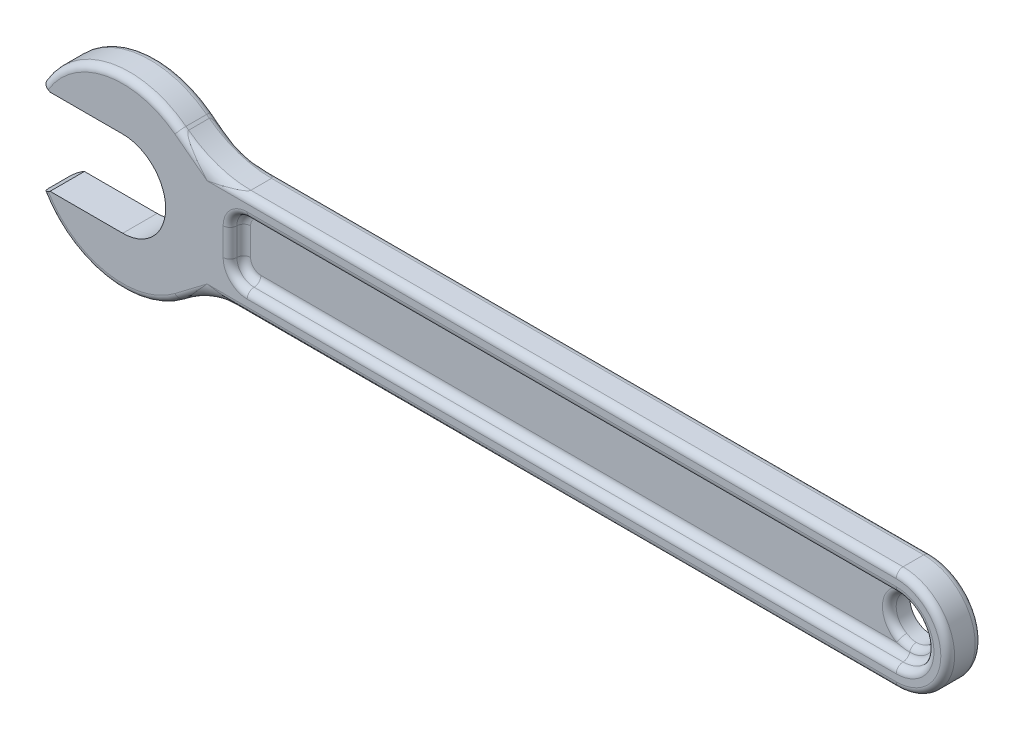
ISO-10303-21;
HEADER;
FILE_DESCRIPTION(('STEP AP214'),'2;1');
FILE_NAME('part.step','',(''),(''),'','','');
FILE_SCHEMA(('AUTOMOTIVE_DESIGN { 1 0 10303 214 1 1 1 1 }'));
ENDSEC;
DATA;
#1=APPLICATION_CONTEXT('core data for automotive mechanical design processes');
#2=APPLICATION_PROTOCOL_DEFINITION('international standard','automotive_design',2000,#1);
#3=PRODUCT_CONTEXT('',#1,'mechanical');
#4=PRODUCT('Part','Part','',(#3));
#5=PRODUCT_RELATED_PRODUCT_CATEGORY('part','',(#4));
#6=PRODUCT_DEFINITION_FORMATION('','',#4);
#7=PRODUCT_DEFINITION_CONTEXT('part definition',#1,'design');
#8=PRODUCT_DEFINITION('design','',#6,#7);
#9=PRODUCT_DEFINITION_SHAPE('','',#8);
#10=(LENGTH_UNIT() NAMED_UNIT(*) SI_UNIT(.MILLI.,.METRE.));
#11=(NAMED_UNIT(*) PLANE_ANGLE_UNIT() SI_UNIT($,.RADIAN.));
#12=(NAMED_UNIT(*) SI_UNIT($,.STERADIAN.) SOLID_ANGLE_UNIT());
#13=UNCERTAINTY_MEASURE_WITH_UNIT(LENGTH_MEASURE(1.E-05),#10,'distance_accuracy_value','');
#14=(GEOMETRIC_REPRESENTATION_CONTEXT(3) GLOBAL_UNCERTAINTY_ASSIGNED_CONTEXT((#13)) GLOBAL_UNIT_ASSIGNED_CONTEXT((#10,
#11,#12)) REPRESENTATION_CONTEXT('',''));
#15=CARTESIAN_POINT('',(0.,0.,0.));
#16=DIRECTION('',(0.,0.,1.));
#17=DIRECTION('',(1.,0.,0.));
#18=AXIS2_PLACEMENT_3D('',#15,#16,#17);
#19=CARTESIAN_POINT('',(-40.7292760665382,8.17046908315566,10.));
#20=DIRECTION('',(0.,0.,-1.));
#21=DIRECTION('',(-1.,0.,0.));
#22=AXIS2_PLACEMENT_3D('',#19,#20,#21);
#23=CYLINDRICAL_SURFACE('',#22,27.2);
#24=CARTESIAN_POINT('',(-40.7292760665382,8.17046908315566,8.));
#25=DIRECTION('',(0.,0.,1.));
#26=DIRECTION('',(1.,0.,0.));
#27=AXIS2_PLACEMENT_3D('',#24,#25,#26);
#28=CIRCLE('',#27,27.2);
#29=CARTESIAN_POINT('',(-24.300114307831,-13.5072301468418,8.));
#30=VERTEX_POINT('',#29);
#31=CARTESIAN_POINT('',(-64.1609427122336,-5.64245957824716,8.));
#32=VERTEX_POINT('',#31);
#33=EDGE_CURVE('E439',#30,#32,#28,.F.);
#34=ORIENTED_EDGE('',*,*,#33,.T.);
#35=DIRECTION('',(0.,0.,-1.));
#36=VECTOR('',#35,1.);
#37=CARTESIAN_POINT('',(-64.1609427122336,-5.64245957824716,10.));
#38=LINE('',#37,#36);
#39=CARTESIAN_POINT('',(-64.1609427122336,-5.64245957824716,2.));
#40=VERTEX_POINT('',#39);
#41=EDGE_CURVE('E51',#32,#40,#38,.T.);
#42=ORIENTED_EDGE('',*,*,#41,.T.);
#43=CARTESIAN_POINT('',(-40.7292760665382,8.17046908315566,2.));
#44=DIRECTION('',(0.,0.,1.));
#45=DIRECTION('',(1.,0.,0.));
#46=AXIS2_PLACEMENT_3D('',#43,#44,#45);
#47=CIRCLE('',#46,27.2);
#48=CARTESIAN_POINT('',(-24.300114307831,-13.5072301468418,2.));
#49=VERTEX_POINT('',#48);
#50=EDGE_CURVE('E368',#40,#49,#47,.T.);
#51=ORIENTED_EDGE('',*,*,#50,.T.);
#52=DIRECTION('',(0.,0.,-1.));
#53=VECTOR('',#52,1.);
#54=CARTESIAN_POINT('',(-24.300114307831,-13.5072301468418,10.));
#55=LINE('',#54,#53);
#56=EDGE_CURVE('E299',#30,#49,#55,.T.);
#57=ORIENTED_EDGE('',*,*,#56,.F.);
#58=EDGE_LOOP('',(#34,#42,#51,#57));
#59=FACE_BOUND('',#58,.T.);
#60=ADVANCED_FACE('F38',(#59),#23,.T.);
#61=CARTESIAN_POINT('',(-15.4891257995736,-6.82953091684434,10.));
#62=DIRECTION('',(0.,1.,0.));
#63=DIRECTION('',(0.,0.,1.));
#64=AXIS2_PLACEMENT_3D('',#61,#62,#63);
#65=PLANE('',#64);
#66=DIRECTION('',(1.,0.,0.));
#67=VECTOR('',#66,1.);
#68=CARTESIAN_POINT('',(-15.4891257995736,-6.82953091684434,8.));
#69=LINE('',#68,#67);
#70=CARTESIAN_POINT('',(184.510874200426,-6.82953091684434,8.));
#71=VERTEX_POINT('',#70);
#72=CARTESIAN_POINT('',(-5.40528673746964,-6.82953091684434,8.));
#73=VERTEX_POINT('',#72);
#74=EDGE_CURVE('E742',#71,#73,#69,.F.);
#75=ORIENTED_EDGE('',*,*,#74,.T.);
#76=DIRECTION('',(0.,0.,-1.));
#77=VECTOR('',#76,1.);
#78=CARTESIAN_POINT('',(-5.40528673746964,-6.82953091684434,2.));
#79=LINE('',#78,#77);
#80=CARTESIAN_POINT('',(-5.40528673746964,-6.82953091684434,2.));
#81=VERTEX_POINT('',#80);
#82=EDGE_CURVE('E768',#73,#81,#79,.T.);
#83=ORIENTED_EDGE('',*,*,#82,.T.);
#84=DIRECTION('',(1.,0.,0.));
#85=VECTOR('',#84,1.);
#86=CARTESIAN_POINT('',(-15.4891257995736,-6.82953091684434,2.));
#87=LINE('',#86,#85);
#88=CARTESIAN_POINT('',(184.510874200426,-6.82953091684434,2.));
#89=VERTEX_POINT('',#88);
#90=EDGE_CURVE('E331',#81,#89,#87,.T.);
#91=ORIENTED_EDGE('',*,*,#90,.T.);
#92=DIRECTION('',(0.,0.,-1.));
#93=VECTOR('',#92,1.);
#94=CARTESIAN_POINT('',(184.510874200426,-6.82953091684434,10.));
#95=LINE('',#94,#93);
#96=EDGE_CURVE('E308',#71,#89,#95,.T.);
#97=ORIENTED_EDGE('',*,*,#96,.F.);
#98=EDGE_LOOP('',(#75,#83,#91,#97));
#99=FACE_BOUND('',#98,.T.);
#100=ADVANCED_FACE('F614',(#99),#65,.F.);
#101=CARTESIAN_POINT('',(184.510874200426,8.17046908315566,10.));
#102=DIRECTION('',(0.,0.,-1.));
#103=DIRECTION('',(-1.,0.,0.));
#104=AXIS2_PLACEMENT_3D('',#101,#102,#103);
#105=CYLINDRICAL_SURFACE('',#104,15.);
#106=DIRECTION('',(0.,0.,-1.));
#107=VECTOR('',#106,1.);
#108=CARTESIAN_POINT('',(184.510874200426,23.1704690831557,10.));
#109=LINE('',#108,#107);
#110=CARTESIAN_POINT('',(184.510874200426,23.1704690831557,8.));
#111=VERTEX_POINT('',#110);
#112=CARTESIAN_POINT('',(184.510874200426,23.1704690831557,2.));
#113=VERTEX_POINT('',#112);
#114=EDGE_CURVE('E306',#111,#113,#109,.T.);
#115=ORIENTED_EDGE('',*,*,#114,.F.);
#116=CARTESIAN_POINT('',(184.510874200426,8.17046908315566,8.));
#117=DIRECTION('',(0.,0.,1.));
#118=DIRECTION('',(1.,0.,0.));
#119=AXIS2_PLACEMENT_3D('',#116,#117,#118);
#120=CIRCLE('',#119,15.);
#121=EDGE_CURVE('E437',#111,#71,#120,.F.);
#122=ORIENTED_EDGE('',*,*,#121,.T.);
#123=ORIENTED_EDGE('',*,*,#96,.T.);
#124=CARTESIAN_POINT('',(184.510874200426,8.17046908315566,2.));
#125=DIRECTION('',(0.,0.,1.));
#126=DIRECTION('',(1.,0.,0.));
#127=AXIS2_PLACEMENT_3D('',#124,#125,#126);
#128=CIRCLE('',#127,15.);
#129=EDGE_CURVE('E333',#89,#113,#128,.T.);
#130=ORIENTED_EDGE('',*,*,#129,.T.);
#131=EDGE_LOOP('',(#115,#122,#123,#130));
#132=FACE_BOUND('',#131,.T.);
#133=ADVANCED_FACE('F620',(#132),#105,.T.);
#134=CARTESIAN_POINT('',(-15.4891257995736,23.1704690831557,10.));
#135=DIRECTION('',(0.,-1.,0.));
#136=DIRECTION('',(0.,0.,-1.));
#137=AXIS2_PLACEMENT_3D('',#134,#135,#136);
#138=PLANE('',#137);
#139=DIRECTION('',(-1.,0.,0.));
#140=VECTOR('',#139,1.);
#141=CARTESIAN_POINT('',(-15.4891257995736,23.1704690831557,2.));
#142=LINE('',#141,#140);
#143=CARTESIAN_POINT('',(-5.40528673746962,23.1704690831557,2.));
#144=VERTEX_POINT('',#143);
#145=EDGE_CURVE('E370',#113,#144,#142,.T.);
#146=ORIENTED_EDGE('',*,*,#145,.T.);
#147=DIRECTION('',(0.,0.,-1.));
#148=VECTOR('',#147,1.);
#149=CARTESIAN_POINT('',(-5.40528673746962,23.1704690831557,8.));
#150=LINE('',#149,#148);
#151=CARTESIAN_POINT('',(-5.40528673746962,23.1704690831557,8.));
#152=VERTEX_POINT('',#151);
#153=EDGE_CURVE('E582',#144,#152,#150,.F.);
#154=ORIENTED_EDGE('',*,*,#153,.T.);
#155=DIRECTION('',(-1.,0.,0.));
#156=VECTOR('',#155,1.);
#157=CARTESIAN_POINT('',(184.510874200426,23.1704690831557,8.));
#158=LINE('',#157,#156);
#159=EDGE_CURVE('E435',#152,#111,#158,.F.);
#160=ORIENTED_EDGE('',*,*,#159,.T.);
#161=ORIENTED_EDGE('',*,*,#114,.T.);
#162=EDGE_LOOP('',(#146,#154,#160,#161));
#163=FACE_BOUND('',#162,.T.);
#164=ADVANCED_FACE('F776',(#163),#138,.F.);
#165=CARTESIAN_POINT('',(184.510874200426,8.17046908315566,10.));
#166=DIRECTION('',(0.,0.,1.));
#167=DIRECTION('',(1.,0.,0.));
#168=AXIS2_PLACEMENT_3D('',#165,#166,#167);
#169=PLANE('',#168);
#170=DIRECTION('',(1.,0.,0.));
#171=VECTOR('',#170,1.);
#172=CARTESIAN_POINT('',(184.510874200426,-2.82953091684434,10.));
#173=LINE('',#172,#171);
#174=CARTESIAN_POINT('',(184.510874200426,-2.82953091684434,10.));
#175=VERTEX_POINT('',#174);
#176=CARTESIAN_POINT('',(-4.48912579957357,-2.82953091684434,10.));
#177=VERTEX_POINT('',#176);
#178=EDGE_CURVE('E428',#175,#177,#173,.F.);
#179=ORIENTED_EDGE('',*,*,#178,.T.);
#180=CARTESIAN_POINT('',(-4.48912579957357,4.17046908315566,10.));
#181=DIRECTION('',(0.,0.,1.));
#182=DIRECTION('',(1.,0.,0.));
#183=AXIS2_PLACEMENT_3D('',#180,#181,#182);
#184=CIRCLE('',#183,7.);
#185=CARTESIAN_POINT('',(-11.4891257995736,4.17046908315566,10.));
#186=VERTEX_POINT('',#185);
#187=EDGE_CURVE('E430',#177,#186,#184,.F.);
#188=ORIENTED_EDGE('',*,*,#187,.T.);
#189=DIRECTION('',(0.,-1.,0.));
#190=VECTOR('',#189,1.);
#191=CARTESIAN_POINT('',(-11.4891257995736,8.17046908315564,10.));
#192=LINE('',#191,#190);
#193=CARTESIAN_POINT('',(-11.4891257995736,12.1704690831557,10.));
#194=VERTEX_POINT('',#193);
#195=EDGE_CURVE('E420',#186,#194,#192,.F.);
#196=ORIENTED_EDGE('',*,*,#195,.T.);
#197=CARTESIAN_POINT('',(-4.48912579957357,12.1704690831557,10.));
#198=DIRECTION('',(0.,0.,1.));
#199=DIRECTION('',(1.,0.,0.));
#200=AXIS2_PLACEMENT_3D('',#197,#198,#199);
#201=CIRCLE('',#200,7.);
#202=CARTESIAN_POINT('',(-4.48912579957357,19.1704690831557,10.));
#203=VERTEX_POINT('',#202);
#204=EDGE_CURVE('E422',#194,#203,#201,.F.);
#205=ORIENTED_EDGE('',*,*,#204,.T.);
#206=DIRECTION('',(-1.,0.,0.));
#207=VECTOR('',#206,1.);
#208=CARTESIAN_POINT('',(184.510874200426,19.1704690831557,10.));
#209=LINE('',#208,#207);
#210=CARTESIAN_POINT('',(184.510874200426,19.1704690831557,10.));
#211=VERTEX_POINT('',#210);
#212=EDGE_CURVE('E424',#203,#211,#209,.F.);
#213=ORIENTED_EDGE('',*,*,#212,.T.);
#214=CARTESIAN_POINT('',(184.510874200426,8.17046908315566,10.));
#215=DIRECTION('',(0.,0.,1.));
#216=DIRECTION('',(1.,0.,0.));
#217=AXIS2_PLACEMENT_3D('',#214,#215,#216);
#218=CIRCLE('',#217,11.);
#219=EDGE_CURVE('E426',#211,#175,#218,.F.);
#220=ORIENTED_EDGE('',*,*,#219,.T.);
#221=EDGE_LOOP('',(#179,#188,#196,#205,#213,#220));
#222=FACE_BOUND('',#221,.T.);
#223=CARTESIAN_POINT('',(-40.7292760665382,8.17046908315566,10.));
#224=DIRECTION('',(0.,0.,1.));
#225=DIRECTION('',(1.,0.,0.));
#226=AXIS2_PLACEMENT_3D('',#223,#224,#225);
#227=CIRCLE('',#226,25.2);
#228=CARTESIAN_POINT('',(-25.5081409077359,28.2542198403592,10.));
#229=VERTEX_POINT('',#228);
#230=CARTESIAN_POINT('',(-62.4288151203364,20.9833534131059,10.));
#231=VERTEX_POINT('',#230);
#232=EDGE_CURVE('E417',#229,#231,#227,.T.);
#233=ORIENTED_EDGE('',*,*,#232,.T.);
#234=DIRECTION('',(0.866025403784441,-0.499999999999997,0.));
#235=VECTOR('',#234,1.);
#236=CARTESIAN_POINT('',(128.324093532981,-89.1478897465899,10.));
#237=LINE('',#236,#235);
#238=CARTESIAN_POINT('',(-61.8868835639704,20.6704690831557,10.));
#239=VERTEX_POINT('',#238);
#240=EDGE_CURVE('E645',#231,#239,#237,.T.);
#241=ORIENTED_EDGE('',*,*,#240,.T.);
#242=DIRECTION('',(-1.,0.,0.));
#243=VECTOR('',#242,1.);
#244=CARTESIAN_POINT('',(-40.7292760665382,20.6704690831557,10.));
#245=LINE('',#244,#243);
#246=CARTESIAN_POINT('',(-40.7292760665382,20.6704690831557,10.));
#247=VERTEX_POINT('',#246);
#248=EDGE_CURVE('E291',#247,#239,#245,.T.);
#249=ORIENTED_EDGE('',*,*,#248,.F.);
#250=CARTESIAN_POINT('',(-40.7292760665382,8.17046908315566,10.));
#251=DIRECTION('',(0.,0.,1.));
#252=DIRECTION('',(1.,0.,0.));
#253=AXIS2_PLACEMENT_3D('',#250,#251,#252);
#254=CIRCLE('',#253,12.5);
#255=CARTESIAN_POINT('',(-40.7292760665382,-4.32953091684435,10.));
#256=VERTEX_POINT('',#255);
#257=EDGE_CURVE('E271',#256,#247,#254,.T.);
#258=ORIENTED_EDGE('',*,*,#257,.F.);
#259=DIRECTION('',(1.,0.,0.));
#260=VECTOR('',#259,1.);
#261=CARTESIAN_POINT('',(-40.7292760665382,-4.32953091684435,10.));
#262=LINE('',#261,#260);
#263=CARTESIAN_POINT('',(-61.8868835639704,-4.32953091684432,10.));
#264=VERTEX_POINT('',#263);
#265=EDGE_CURVE('E289',#264,#256,#262,.T.);
#266=ORIENTED_EDGE('',*,*,#265,.F.);
#267=DIRECTION('',(-0.866025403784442,-0.499999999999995,0.));
#268=VECTOR('',#267,1.);
#269=CARTESIAN_POINT('',(128.324093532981,105.488827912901,10.));
#270=LINE('',#269,#268);
#271=CARTESIAN_POINT('',(-62.4288151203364,-4.64241524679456,10.));
#272=VERTEX_POINT('',#271);
#273=EDGE_CURVE('E588',#264,#272,#270,.T.);
#274=ORIENTED_EDGE('',*,*,#273,.T.);
#275=CARTESIAN_POINT('',(-40.7292760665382,8.17046908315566,10.));
#276=DIRECTION('',(0.,0.,1.));
#277=DIRECTION('',(1.,0.,0.));
#278=AXIS2_PLACEMENT_3D('',#275,#276,#277);
#279=CIRCLE('',#278,25.2);
#280=CARTESIAN_POINT('',(-25.5081409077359,-11.9132816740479,10.));
#281=VERTEX_POINT('',#280);
#282=EDGE_CURVE('E408',#272,#281,#279,.T.);
#283=ORIENTED_EDGE('',*,*,#282,.T.);
#284=DIRECTION('',(0.796974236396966,0.60401329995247,0.));
#285=VECTOR('',#284,1.);
#286=CARTESIAN_POINT('',(-16.6971523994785,-5.23558244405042,10.));
#287=LINE('',#286,#285);
#288=CARTESIAN_POINT('',(-16.1613817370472,-4.82953091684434,10.));
#289=VERTEX_POINT('',#288);
#290=EDGE_CURVE('E376',#281,#289,#287,.T.);
#291=ORIENTED_EDGE('',*,*,#290,.T.);
#292=DIRECTION('',(1.,0.,0.));
#293=VECTOR('',#292,1.);
#294=CARTESIAN_POINT('',(184.510874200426,-4.82953091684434,10.));
#295=LINE('',#294,#293);
#296=CARTESIAN_POINT('',(184.510874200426,-4.82953091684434,10.));
#297=VERTEX_POINT('',#296);
#298=EDGE_CURVE('E406',#289,#297,#295,.T.);
#299=ORIENTED_EDGE('',*,*,#298,.T.);
#300=CARTESIAN_POINT('',(184.510874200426,8.17046908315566,10.));
#301=DIRECTION('',(0.,0.,1.));
#302=DIRECTION('',(1.,0.,0.));
#303=AXIS2_PLACEMENT_3D('',#300,#301,#302);
#304=CIRCLE('',#303,13.);
#305=CARTESIAN_POINT('',(184.510874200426,21.1704690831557,10.));
#306=VERTEX_POINT('',#305);
#307=EDGE_CURVE('E410',#297,#306,#304,.T.);
#308=ORIENTED_EDGE('',*,*,#307,.T.);
#309=DIRECTION('',(-1.,0.,0.));
#310=VECTOR('',#309,1.);
#311=CARTESIAN_POINT('',(-15.4891257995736,21.1704690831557,10.));
#312=LINE('',#311,#310);
#313=CARTESIAN_POINT('',(-16.1613817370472,21.1704690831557,10.));
#314=VERTEX_POINT('',#313);
#315=EDGE_CURVE('E412',#306,#314,#312,.T.);
#316=ORIENTED_EDGE('',*,*,#315,.T.);
#317=DIRECTION('',(-0.796974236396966,0.604013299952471,0.));
#318=VECTOR('',#317,1.);
#319=CARTESIAN_POINT('',(-25.5081409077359,28.2542198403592,10.));
#320=LINE('',#319,#318);
#321=EDGE_CURVE('E415',#314,#229,#320,.T.);
#322=ORIENTED_EDGE('',*,*,#321,.T.);
#323=EDGE_LOOP('',(#233,#241,#249,#258,#266,#274,#283,#291,#299,#308,#316,#322));
#324=FACE_BOUND('',#323,.T.);
#325=ADVANCED_FACE('F649',(#222,#324),#169,.T.);
#326=CARTESIAN_POINT('',(184.510874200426,8.17046908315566,0.));
#327=DIRECTION('',(0.,0.,1.));
#328=DIRECTION('',(1.,0.,0.));
#329=AXIS2_PLACEMENT_3D('',#326,#327,#328);
#330=PLANE('',#329);
#331=CARTESIAN_POINT('',(184.510874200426,8.17046908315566,0.));
#332=DIRECTION('',(0.,0.,1.));
#333=DIRECTION('',(1.,0.,0.));
#334=AXIS2_PLACEMENT_3D('',#331,#332,#333);
#335=CIRCLE('',#334,6.00000000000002);
#336=CARTESIAN_POINT('',(190.510874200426,8.17046908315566,0.));
#337=VERTEX_POINT('',#336);
#338=EDGE_CURVE('E294',#337,#337,#335,.T.);
#339=ORIENTED_EDGE('',*,*,#338,.T.);
#340=EDGE_LOOP('',(#339));
#341=FACE_BOUND('',#340,.T.);
#342=DIRECTION('',(-1.,0.,0.));
#343=VECTOR('',#342,1.);
#344=CARTESIAN_POINT('',(-40.7292760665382,20.6704690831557,0.));
#345=LINE('',#344,#343);
#346=CARTESIAN_POINT('',(-40.7292760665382,20.6704690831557,0.));
#347=VERTEX_POINT('',#346);
#348=CARTESIAN_POINT('',(-61.8868835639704,20.6704690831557,0.));
#349=VERTEX_POINT('',#348);
#350=EDGE_CURVE('E279',#347,#349,#345,.T.);
#351=ORIENTED_EDGE('',*,*,#350,.T.);
#352=DIRECTION('',(-0.866025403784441,0.499999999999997,0.));
#353=VECTOR('',#352,1.);
#354=CARTESIAN_POINT('',(-64.1609427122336,21.9833977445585,0.));
#355=LINE('',#354,#353);
#356=CARTESIAN_POINT('',(-62.4288151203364,20.9833534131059,0.));
#357=VERTEX_POINT('',#356);
#358=EDGE_CURVE('E809',#349,#357,#355,.T.);
#359=ORIENTED_EDGE('',*,*,#358,.T.);
#360=CARTESIAN_POINT('',(-40.7292760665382,8.17046908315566,0.));
#361=DIRECTION('',(0.,0.,1.));
#362=DIRECTION('',(1.,0.,0.));
#363=AXIS2_PLACEMENT_3D('',#360,#361,#362);
#364=CIRCLE('',#363,25.2);
#365=CARTESIAN_POINT('',(-25.5081409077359,28.2542198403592,0.));
#366=VERTEX_POINT('',#365);
#367=EDGE_CURVE('E314',#357,#366,#364,.F.);
#368=ORIENTED_EDGE('',*,*,#367,.T.);
#369=DIRECTION('',(-0.796974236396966,0.604013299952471,0.));
#370=VECTOR('',#369,1.);
#371=CARTESIAN_POINT('',(117.557179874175,-80.1725680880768,0.));
#372=LINE('',#371,#370);
#373=CARTESIAN_POINT('',(-16.1613817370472,21.1704690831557,0.));
#374=VERTEX_POINT('',#373);
#375=EDGE_CURVE('E316',#366,#374,#372,.F.);
#376=ORIENTED_EDGE('',*,*,#375,.T.);
#377=DIRECTION('',(-1.,0.,0.));
#378=VECTOR('',#377,1.);
#379=CARTESIAN_POINT('',(184.510874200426,21.1704690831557,0.));
#380=LINE('',#379,#378);
#381=CARTESIAN_POINT('',(184.510874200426,21.1704690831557,0.));
#382=VERTEX_POINT('',#381);
#383=EDGE_CURVE('E319',#374,#382,#380,.F.);
#384=ORIENTED_EDGE('',*,*,#383,.T.);
#385=CARTESIAN_POINT('',(184.510874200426,8.17046908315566,0.));
#386=DIRECTION('',(0.,0.,1.));
#387=DIRECTION('',(1.,0.,0.));
#388=AXIS2_PLACEMENT_3D('',#385,#386,#387);
#389=CIRCLE('',#388,13.);
#390=CARTESIAN_POINT('',(184.510874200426,-4.82953091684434,0.));
#391=VERTEX_POINT('',#390);
#392=EDGE_CURVE('E321',#382,#391,#389,.F.);
#393=ORIENTED_EDGE('',*,*,#392,.T.);
#394=DIRECTION('',(1.,0.,0.));
#395=VECTOR('',#394,1.);
#396=CARTESIAN_POINT('',(184.510874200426,-4.82953091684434,0.));
#397=LINE('',#396,#395);
#398=CARTESIAN_POINT('',(-16.1613817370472,-4.82953091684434,0.));
#399=VERTEX_POINT('',#398);
#400=EDGE_CURVE('E323',#391,#399,#397,.F.);
#401=ORIENTED_EDGE('',*,*,#400,.T.);
#402=DIRECTION('',(0.796974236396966,0.60401329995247,0.));
#403=VECTOR('',#402,1.);
#404=CARTESIAN_POINT('',(117.557179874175,96.513506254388,0.));
#405=LINE('',#404,#403);
#406=CARTESIAN_POINT('',(-25.5081409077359,-11.9132816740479,0.));
#407=VERTEX_POINT('',#406);
#408=EDGE_CURVE('E326',#399,#407,#405,.F.);
#409=ORIENTED_EDGE('',*,*,#408,.T.);
#410=CARTESIAN_POINT('',(-40.7292760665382,8.17046908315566,0.));
#411=DIRECTION('',(0.,0.,1.));
#412=DIRECTION('',(1.,0.,0.));
#413=AXIS2_PLACEMENT_3D('',#410,#411,#412);
#414=CIRCLE('',#413,25.2);
#415=CARTESIAN_POINT('',(-62.4288151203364,-4.64241524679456,0.));
#416=VERTEX_POINT('',#415);
#417=EDGE_CURVE('E328',#407,#416,#414,.F.);
#418=ORIENTED_EDGE('',*,*,#417,.T.);
#419=DIRECTION('',(0.866025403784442,0.499999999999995,0.));
#420=VECTOR('',#419,1.);
#421=CARTESIAN_POINT('',(-61.8868835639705,-4.32953091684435,0.));
#422=LINE('',#421,#420);
#423=CARTESIAN_POINT('',(-61.8868835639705,-4.32953091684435,0.));
#424=VERTEX_POINT('',#423);
#425=EDGE_CURVE('E804',#416,#424,#422,.T.);
#426=ORIENTED_EDGE('',*,*,#425,.T.);
#427=DIRECTION('',(1.,0.,0.));
#428=VECTOR('',#427,1.);
#429=CARTESIAN_POINT('',(-40.7292760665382,-4.32953091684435,0.));
#430=LINE('',#429,#428);
#431=CARTESIAN_POINT('',(-40.7292760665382,-4.32953091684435,0.));
#432=VERTEX_POINT('',#431);
#433=EDGE_CURVE('E276',#424,#432,#430,.T.);
#434=ORIENTED_EDGE('',*,*,#433,.T.);
#435=CARTESIAN_POINT('',(-40.7292760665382,8.17046908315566,0.));
#436=DIRECTION('',(0.,0.,1.));
#437=DIRECTION('',(1.,0.,0.));
#438=AXIS2_PLACEMENT_3D('',#435,#436,#437);
#439=CIRCLE('',#438,12.5);
#440=EDGE_CURVE('E269',#432,#347,#439,.T.);
#441=ORIENTED_EDGE('',*,*,#440,.T.);
#442=EDGE_LOOP('',(#351,#359,#368,#376,#384,#393,#401,#409,#418,#426,#434,#441));
#443=FACE_BOUND('',#442,.T.);
#444=ADVANCED_FACE('F286',(#341,#443),#330,.F.);
#445=CARTESIAN_POINT('',(184.510874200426,8.17046908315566,6.));
#446=DIRECTION('',(0.,0.,1.));
#447=DIRECTION('',(1.,0.,0.));
#448=AXIS2_PLACEMENT_3D('',#445,#446,#447);
#449=PLANE('',#448);
#450=DIRECTION('',(1.,0.,0.));
#451=VECTOR('',#450,1.);
#452=CARTESIAN_POINT('',(184.510874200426,1.17046908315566,6.));
#453=LINE('',#452,#451);
#454=CARTESIAN_POINT('',(-4.48912579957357,1.17046908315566,6.));
#455=VERTEX_POINT('',#454);
#456=CARTESIAN_POINT('',(180.637890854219,1.17046908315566,6.));
#457=VERTEX_POINT('',#456);
#458=EDGE_CURVE('E342',#455,#457,#453,.T.);
#459=ORIENTED_EDGE('',*,*,#458,.T.);
#460=CARTESIAN_POINT('',(184.510874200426,8.17046908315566,6.));
#461=DIRECTION('',(0.,0.,1.));
#462=DIRECTION('',(1.,0.,0.));
#463=AXIS2_PLACEMENT_3D('',#460,#461,#462);
#464=CIRCLE('',#463,8.00000000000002);
#465=CARTESIAN_POINT('',(180.637890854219,15.1704690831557,6.));
#466=VERTEX_POINT('',#465);
#467=EDGE_CURVE('E722',#457,#466,#464,.F.);
#468=ORIENTED_EDGE('',*,*,#467,.T.);
#469=DIRECTION('',(-1.,0.,0.));
#470=VECTOR('',#469,1.);
#471=CARTESIAN_POINT('',(-4.48912579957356,15.1704690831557,6.));
#472=LINE('',#471,#470);
#473=CARTESIAN_POINT('',(-4.48912579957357,15.1704690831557,6.));
#474=VERTEX_POINT('',#473);
#475=EDGE_CURVE('E345',#466,#474,#472,.T.);
#476=ORIENTED_EDGE('',*,*,#475,.T.);
#477=CARTESIAN_POINT('',(-4.48912579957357,12.1704690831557,6.));
#478=DIRECTION('',(0.,0.,1.));
#479=DIRECTION('',(1.,0.,0.));
#480=AXIS2_PLACEMENT_3D('',#477,#478,#479);
#481=CIRCLE('',#480,3.);
#482=CARTESIAN_POINT('',(-7.48912579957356,12.1704690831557,6.));
#483=VERTEX_POINT('',#482);
#484=EDGE_CURVE('E347',#474,#483,#481,.T.);
#485=ORIENTED_EDGE('',*,*,#484,.T.);
#486=DIRECTION('',(0.,-1.,0.));
#487=VECTOR('',#486,1.);
#488=CARTESIAN_POINT('',(-7.48912579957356,4.17046908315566,6.));
#489=LINE('',#488,#487);
#490=CARTESIAN_POINT('',(-7.48912579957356,4.17046908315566,6.));
#491=VERTEX_POINT('',#490);
#492=EDGE_CURVE('E338',#483,#491,#489,.T.);
#493=ORIENTED_EDGE('',*,*,#492,.T.);
#494=CARTESIAN_POINT('',(-4.48912579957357,4.17046908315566,6.));
#495=DIRECTION('',(0.,0.,1.));
#496=DIRECTION('',(1.,0.,0.));
#497=AXIS2_PLACEMENT_3D('',#494,#495,#496);
#498=CIRCLE('',#497,3.);
#499=EDGE_CURVE('E340',#491,#455,#498,.T.);
#500=ORIENTED_EDGE('',*,*,#499,.T.);
#501=EDGE_LOOP('',(#459,#468,#476,#485,#493,#500));
#502=FACE_BOUND('',#501,.T.);
#503=ADVANCED_FACE('F633',(#502),#449,.T.);
#504=CARTESIAN_POINT('',(-15.4891257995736,23.1704690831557,10.));
#505=DIRECTION('',(-0.604013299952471,-0.796974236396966,0.));
#506=DIRECTION('',(0.796974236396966,-0.604013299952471,0.));
#507=AXIS2_PLACEMENT_3D('',#504,#505,#506);
#508=PLANE('',#507);
#509=DIRECTION('',(-0.796974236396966,0.604013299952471,0.));
#510=VECTOR('',#509,1.);
#511=CARTESIAN_POINT('',(-15.4891257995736,23.1704690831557,8.));
#512=LINE('',#511,#510);
#513=CARTESIAN_POINT('',(-24.3001143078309,29.8481683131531,8.));
#514=VERTEX_POINT('',#513);
#515=CARTESIAN_POINT('',(-23.5256857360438,29.2612419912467,8.));
#516=VERTEX_POINT('',#515);
#517=EDGE_CURVE('E658',#514,#516,#512,.F.);
#518=ORIENTED_EDGE('',*,*,#517,.T.);
#519=DIRECTION('',(0.,0.,-1.));
#520=VECTOR('',#519,1.);
#521=CARTESIAN_POINT('',(-23.5256857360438,29.2612419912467,2.));
#522=LINE('',#521,#520);
#523=CARTESIAN_POINT('',(-23.5256857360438,29.2612419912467,2.));
#524=VERTEX_POINT('',#523);
#525=EDGE_CURVE('E772',#516,#524,#522,.T.);
#526=ORIENTED_EDGE('',*,*,#525,.T.);
#527=DIRECTION('',(-0.796974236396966,0.604013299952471,0.));
#528=VECTOR('',#527,1.);
#529=CARTESIAN_POINT('',(-15.4891257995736,23.1704690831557,2.));
#530=LINE('',#529,#528);
#531=CARTESIAN_POINT('',(-24.3001143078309,29.8481683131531,2.));
#532=VERTEX_POINT('',#531);
#533=EDGE_CURVE('E336',#524,#532,#530,.T.);
#534=ORIENTED_EDGE('',*,*,#533,.T.);
#535=DIRECTION('',(0.,0.,-1.));
#536=VECTOR('',#535,1.);
#537=CARTESIAN_POINT('',(-24.3001143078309,29.8481683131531,10.));
#538=LINE('',#537,#536);
#539=EDGE_CURVE('E303',#514,#532,#538,.T.);
#540=ORIENTED_EDGE('',*,*,#539,.F.);
#541=EDGE_LOOP('',(#518,#526,#534,#540));
#542=FACE_BOUND('',#541,.T.);
#543=ADVANCED_FACE('F626',(#542),#508,.F.);
#544=CARTESIAN_POINT('',(-40.7292760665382,8.17046908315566,2.));
#545=DIRECTION('',(0.,0.,1.));
#546=DIRECTION('',(1.,0.,0.));
#547=AXIS2_PLACEMENT_3D('',#544,#545,#546);
#548=CIRCLE('',#547,27.2);
#549=CARTESIAN_POINT('',(-64.1609427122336,21.9833977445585,2.));
#550=VERTEX_POINT('',#549);
#551=EDGE_CURVE('E373',#532,#550,#548,.T.);
#552=ORIENTED_EDGE('',*,*,#551,.T.);
#553=DIRECTION('',(0.,0.,-1.));
#554=VECTOR('',#553,1.);
#555=CARTESIAN_POINT('',(-64.1609427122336,21.9833977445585,10.));
#556=LINE('',#555,#554);
#557=CARTESIAN_POINT('',(-64.1609427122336,21.9833977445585,8.));
#558=VERTEX_POINT('',#557);
#559=EDGE_CURVE('E578',#550,#558,#556,.F.);
#560=ORIENTED_EDGE('',*,*,#559,.T.);
#561=CARTESIAN_POINT('',(-40.7292760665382,8.17046908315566,8.));
#562=DIRECTION('',(0.,0.,1.));
#563=DIRECTION('',(1.,0.,0.));
#564=AXIS2_PLACEMENT_3D('',#561,#562,#563);
#565=CIRCLE('',#564,27.2);
#566=EDGE_CURVE('E433',#558,#514,#565,.F.);
#567=ORIENTED_EDGE('',*,*,#566,.T.);
#568=ORIENTED_EDGE('',*,*,#539,.T.);
#569=EDGE_LOOP('',(#552,#560,#567,#568));
#570=FACE_BOUND('',#569,.T.);
#571=ADVANCED_FACE('F616',(#570),#23,.T.);
#572=CARTESIAN_POINT('',(-15.4891257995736,-6.82953091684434,10.));
#573=DIRECTION('',(-0.60401329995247,0.796974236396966,0.));
#574=DIRECTION('',(-0.796974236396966,-0.60401329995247,0.));
#575=AXIS2_PLACEMENT_3D('',#572,#573,#574);
#576=PLANE('',#575);
#577=DIRECTION('',(0.796974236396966,0.60401329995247,0.));
#578=VECTOR('',#577,1.);
#579=CARTESIAN_POINT('',(-15.4891257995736,-6.82953091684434,2.));
#580=LINE('',#579,#578);
#581=CARTESIAN_POINT('',(-23.5256857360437,-12.9203038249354,2.));
#582=VERTEX_POINT('',#581);
#583=EDGE_CURVE('E311',#49,#582,#580,.T.);
#584=ORIENTED_EDGE('',*,*,#583,.T.);
#585=DIRECTION('',(0.,0.,-1.));
#586=VECTOR('',#585,1.);
#587=CARTESIAN_POINT('',(-23.5256857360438,-12.9203038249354,8.));
#588=LINE('',#587,#586);
#589=CARTESIAN_POINT('',(-23.5256857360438,-12.9203038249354,8.));
#590=VERTEX_POINT('',#589);
#591=EDGE_CURVE('E770',#582,#590,#588,.F.);
#592=ORIENTED_EDGE('',*,*,#591,.T.);
#593=DIRECTION('',(0.796974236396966,0.60401329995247,0.));
#594=VECTOR('',#593,1.);
#595=CARTESIAN_POINT('',(-24.3001143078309,-13.5072301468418,8.));
#596=LINE('',#595,#594);
#597=EDGE_CURVE('E669',#590,#30,#596,.F.);
#598=ORIENTED_EDGE('',*,*,#597,.T.);
#599=ORIENTED_EDGE('',*,*,#56,.T.);
#600=EDGE_LOOP('',(#584,#592,#598,#599));
#601=FACE_BOUND('',#600,.T.);
#602=ADVANCED_FACE('F625',(#601),#576,.F.);
#603=CARTESIAN_POINT('',(-40.7292760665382,8.17046908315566,0.));
#604=DIRECTION('',(0.,0.,1.));
#605=DIRECTION('',(1.,0.,0.));
#606=AXIS2_PLACEMENT_3D('',#603,#604,#605);
#607=CYLINDRICAL_SURFACE('',#606,12.5);
#608=ORIENTED_EDGE('',*,*,#257,.T.);
#609=DIRECTION('',(0.,0.,1.));
#610=VECTOR('',#609,1.);
#611=CARTESIAN_POINT('',(-40.7292760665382,20.6704690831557,0.));
#612=LINE('',#611,#610);
#613=EDGE_CURVE('E264',#347,#247,#612,.T.);
#614=ORIENTED_EDGE('',*,*,#613,.F.);
#615=ORIENTED_EDGE('',*,*,#440,.F.);
#616=DIRECTION('',(0.,0.,1.));
#617=VECTOR('',#616,1.);
#618=CARTESIAN_POINT('',(-40.7292760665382,-4.32953091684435,0.));
#619=LINE('',#618,#617);
#620=EDGE_CURVE('E275',#432,#256,#619,.T.);
#621=ORIENTED_EDGE('',*,*,#620,.T.);
#622=EDGE_LOOP('',(#608,#614,#615,#621));
#623=FACE_BOUND('',#622,.T.);
#624=ADVANCED_FACE('F266',(#623),#607,.F.);
#625=CARTESIAN_POINT('',(-40.7292760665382,-4.32953091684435,0.));
#626=DIRECTION('',(0.,-1.,0.));
#627=DIRECTION('',(1.,0.,0.));
#628=AXIS2_PLACEMENT_3D('',#625,#626,#627);
#629=PLANE('',#628);
#630=ORIENTED_EDGE('',*,*,#433,.F.);
#631=DIRECTION('',(0.,0.,1.));
#632=VECTOR('',#631,1.);
#633=CARTESIAN_POINT('',(-61.8868835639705,-4.32953091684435,0.));
#634=LINE('',#633,#632);
#635=EDGE_CURVE('E808',#424,#264,#634,.T.);
#636=ORIENTED_EDGE('',*,*,#635,.T.);
#637=ORIENTED_EDGE('',*,*,#265,.T.);
#638=ORIENTED_EDGE('',*,*,#620,.F.);
#639=EDGE_LOOP('',(#630,#636,#637,#638));
#640=FACE_BOUND('',#639,.T.);
#641=ADVANCED_FACE('F978',(#640),#629,.F.);
#642=CARTESIAN_POINT('',(-40.7292760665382,20.6704690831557,0.));
#643=DIRECTION('',(0.,1.,0.));
#644=DIRECTION('',(0.,0.,1.));
#645=AXIS2_PLACEMENT_3D('',#642,#643,#644);
#646=PLANE('',#645);
#647=ORIENTED_EDGE('',*,*,#248,.T.);
#648=DIRECTION('',(0.,0.,-1.));
#649=VECTOR('',#648,1.);
#650=CARTESIAN_POINT('',(-61.8868835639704,20.6704690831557,0.));
#651=LINE('',#650,#649);
#652=EDGE_CURVE('E282',#239,#349,#651,.T.);
#653=ORIENTED_EDGE('',*,*,#652,.T.);
#654=ORIENTED_EDGE('',*,*,#350,.F.);
#655=ORIENTED_EDGE('',*,*,#613,.T.);
#656=EDGE_LOOP('',(#647,#653,#654,#655));
#657=FACE_BOUND('',#656,.T.);
#658=ADVANCED_FACE('F280',(#657),#646,.F.);
#659=CARTESIAN_POINT('',(184.510874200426,8.17046908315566,0.));
#660=DIRECTION('',(0.,0.,1.));
#661=DIRECTION('',(1.,0.,0.));
#662=AXIS2_PLACEMENT_3D('',#659,#660,#661);
#663=CYLINDRICAL_SURFACE('',#662,6.00000000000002);
#664=CARTESIAN_POINT('',(184.510874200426,8.17046908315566,4.));
#665=DIRECTION('',(0.,0.,1.));
#666=DIRECTION('',(1.,0.,0.));
#667=AXIS2_PLACEMENT_3D('',#664,#665,#666);
#668=CIRCLE('',#667,6.00000000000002);
#669=CARTESIAN_POINT('',(181.606136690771,13.4204690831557,4.));
#670=VERTEX_POINT('',#669);
#671=CARTESIAN_POINT('',(181.606136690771,2.92046908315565,4.));
#672=VERTEX_POINT('',#671);
#673=EDGE_CURVE('E441',#670,#672,#668,.T.);
#674=ORIENTED_EDGE('',*,*,#673,.T.);
#675=CARTESIAN_POINT('',(178.871133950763,1.8335107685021,6.11310420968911));
#676=CARTESIAN_POINT('',(180.714494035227,3.48421728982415,6.69315067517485));
#677=CARTESIAN_POINT('',(180.281069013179,3.91503161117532,4.22620841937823));
#678=CARTESIAN_POINT('',(178.981791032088,1.77848267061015,6.0937769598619));
#679=CARTESIAN_POINT('',(180.752402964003,3.46317948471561,6.63208029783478));
#680=CARTESIAN_POINT('',(180.364061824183,3.83248946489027,4.18755391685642));
#681=CARTESIAN_POINT('',(179.096721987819,1.72461416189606,6.07754122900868));
#682=CARTESIAN_POINT('',(180.796020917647,3.43545272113,6.57137327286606));
#683=CARTESIAN_POINT('',(180.450260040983,3.75168670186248,4.15508245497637));
#684=CARTESIAN_POINT('',(179.334051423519,1.61984067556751,6.05038513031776));
#685=CARTESIAN_POINT('',(180.89472408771,3.36988533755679,6.45450786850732));
#686=CARTESIAN_POINT('',(180.628257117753,3.59452647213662,4.10077025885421));
#687=CARTESIAN_POINT('',(179.456442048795,1.56893268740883,6.03945927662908));
#688=CARTESIAN_POINT('',(180.949530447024,3.33228170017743,6.3983039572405));
#689=CARTESIAN_POINT('',(180.720050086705,3.51816448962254,4.07891855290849));
#690=CARTESIAN_POINT('',(179.706787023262,1.47102148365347,6.02209219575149));
#691=CARTESIAN_POINT('',(181.070502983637,3.25025696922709,6.29290645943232));
#692=CARTESIAN_POINT('',(180.907808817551,3.37129768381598,4.04418439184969));
#693=CARTESIAN_POINT('',(179.834685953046,1.42398904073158,6.01561404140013));
#694=CARTESIAN_POINT('',(181.136327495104,3.20604317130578,6.24354499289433));
#695=CARTESIAN_POINT('',(181.003733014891,3.3007490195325,4.03122808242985));
#696=CARTESIAN_POINT('',(180.096187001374,1.33371315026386,6.0061567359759));
#697=CARTESIAN_POINT('',(181.279041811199,3.11375840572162,6.15217287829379));
#698=CARTESIAN_POINT('',(181.199858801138,3.16533518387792,4.01231347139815));
#699=CARTESIAN_POINT('',(180.229788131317,1.290469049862,6.00317698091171));
#700=CARTESIAN_POINT('',(181.355755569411,3.06573913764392,6.11000296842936));
#701=CARTESIAN_POINT('',(181.300059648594,3.1004690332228,4.00635396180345));
#702=CARTESIAN_POINT('',(180.410664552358,1.23568274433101,6.00101741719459));
#703=CARTESIAN_POINT('',(181.465085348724,3.00082101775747,6.05861736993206));
#704=CARTESIAN_POINT('',(181.435716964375,3.01828957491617,4.00203483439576));
#705=CARTESIAN_POINT('',(180.455735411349,1.22233214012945,6.00062940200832));
#706=CARTESIAN_POINT('',(181.492543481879,2.98477805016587,6.04635896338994));
#707=CARTESIAN_POINT('',(181.469520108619,2.99826366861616,4.0012588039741));
#708=CARTESIAN_POINT('',(180.546416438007,1.19606907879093,6.00012073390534));
#709=CARTESIAN_POINT('',(181.548517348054,2.95265404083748,6.02261871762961));
#710=CARTESIAN_POINT('',(181.537530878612,2.95886907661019,4.00024146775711));
#711=CARTESIAN_POINT('',(180.592026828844,1.1831568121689,6.00000019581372));
#712=CARTESIAN_POINT('',(181.577030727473,2.93657135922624,6.01113143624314));
#713=CARTESIAN_POINT('',(181.57173867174,2.93950067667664,4.00000039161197));
#714=CARTESIAN_POINT('',(180.830350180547,1.11722753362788,5.9999991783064));
#715=CARTESIAN_POINT('',(181.726532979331,2.85386231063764,5.95395501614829));
#716=CARTESIAN_POINT('',(181.750481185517,2.84060675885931,3.9999983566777));
#717=CARTESIAN_POINT('',(181.027275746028,1.06793985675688,6.0021174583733));
#718=CARTESIAN_POINT('',(181.857272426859,2.786810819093,5.91392698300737));
#719=CARTESIAN_POINT('',(181.898175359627,2.76667524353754,4.00423491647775));
#720=CARTESIAN_POINT('',(181.428531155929,0.977650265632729,6.00880125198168));
#721=CARTESIAN_POINT('',(182.133692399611,2.65898799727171,5.84601957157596));
#722=CARTESIAN_POINT('',(182.199116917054,2.63124085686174,4.0176025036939));
#723=CARTESIAN_POINT('',(181.632866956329,0.936655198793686,6.01336877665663));
#724=CARTESIAN_POINT('',(182.27948683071,2.59791478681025,5.81781331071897));
#725=CARTESIAN_POINT('',(182.352368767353,2.56974825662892,4.02673755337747));
#726=CARTESIAN_POINT('',(182.048159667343,0.863117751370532,6.02340775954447));
#727=CARTESIAN_POINT('',(182.583200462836,2.48567625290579,5.77107972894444));
#728=CARTESIAN_POINT('',(182.663838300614,2.45944208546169,4.04681551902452));
#729=CARTESIAN_POINT('',(182.2591348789,0.830601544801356,6.02888193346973));
#730=CARTESIAN_POINT('',(182.741477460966,2.43418791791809,5.75234427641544));
#731=CARTESIAN_POINT('',(182.822069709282,2.41066777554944,4.05776386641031));
#732=CARTESIAN_POINT('',(182.685775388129,0.774391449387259,6.03940282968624));
#733=CARTESIAN_POINT('',(183.066645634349,2.34396625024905,5.7222793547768));
#734=CARTESIAN_POINT('',(183.142050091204,2.326352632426,4.0788056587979));
#735=CARTESIAN_POINT('',(182.901440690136,0.750697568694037,6.04444955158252));
#736=CARTESIAN_POINT('',(183.234025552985,2.3049081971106,5.7108022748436));
#737=CARTESIAN_POINT('',(183.303799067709,2.29081181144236,4.08889910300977));
#738=CARTESIAN_POINT('',(183.337745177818,0.71214837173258,6.05312119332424));
#739=CARTESIAN_POINT('',(183.575667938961,2.24100575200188,5.69318086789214));
#740=CARTESIAN_POINT('',(183.63102743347,2.23298801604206,4.10624238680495));
#741=CARTESIAN_POINT('',(183.558409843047,0.697362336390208,6.05673489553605));
#742=CARTESIAN_POINT('',(183.750613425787,2.21601775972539,5.68699549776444));
#743=CARTESIAN_POINT('',(183.796525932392,2.21080896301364,4.11346979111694));
#744=CARTESIAN_POINT('',(184.001549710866,0.677033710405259,6.06179678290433));
#745=CARTESIAN_POINT('',(184.103106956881,2.18168868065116,5.67872634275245));
#746=CARTESIAN_POINT('',(184.128880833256,2.1803160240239,4.12359356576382));
#747=CARTESIAN_POINT('',(184.224025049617,0.671491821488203,6.06324480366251));
#748=CARTESIAN_POINT('',(184.281369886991,2.17220669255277,5.67660712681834));
#749=CARTESIAN_POINT('',(184.295737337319,2.17200319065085,4.12648960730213));
#750=CARTESIAN_POINT('',(184.668959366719,0.669705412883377,6.06370496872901));
#751=CARTESIAN_POINT('',(184.637297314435,2.16917248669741,5.67591335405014));
#752=CARTESIAN_POINT('',(184.629438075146,2.16932357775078,4.12740993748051));
#753=CARTESIAN_POINT('',(184.891418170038,0.67345230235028,6.06271936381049));
#754=CARTESIAN_POINT('',(184.815707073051,2.17559279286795,5.67733264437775));
#755=CARTESIAN_POINT('',(184.796282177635,2.17494391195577,4.12543872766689));
#756=CARTESIAN_POINT('',(185.223946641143,0.6860022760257,6.05956016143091));
#757=CARTESIAN_POINT('',(185.080457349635,2.19680435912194,5.68235931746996));
#758=CARTESIAN_POINT('',(185.045678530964,2.19376887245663,4.11912032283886));
#759=CARTESIAN_POINT('',(185.334614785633,0.691342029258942,6.05822659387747));
#760=CARTESIAN_POINT('',(185.16850458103,2.20583800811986,5.68452578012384));
#761=CARTESIAN_POINT('',(185.128679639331,2.20177850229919,4.11645318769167));
#762=CARTESIAN_POINT('',(185.555383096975,0.704320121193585,6.05507130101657));
#763=CARTESIAN_POINT('',(185.343469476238,2.22765620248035,5.68996354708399));
#764=CARTESIAN_POINT('',(185.294255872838,2.22124564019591,4.11014260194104));
#765=CARTESIAN_POINT('',(185.665483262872,0.711958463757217,6.05324957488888));
#766=CARTESIAN_POINT('',(185.430473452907,2.24046291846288,5.69324087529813));
#767=CARTESIAN_POINT('',(185.376830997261,2.2327031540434,4.10649914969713));
#768=CARTESIAN_POINT('',(185.77521493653,0.720739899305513,6.05121995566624));
#769=CARTESIAN_POINT('',(185.516560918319,2.25506740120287,5.69713594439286));
#770=CARTESIAN_POINT('',(185.459129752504,2.24587530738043,4.10243991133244));
#771=(BOUNDED_SURFACE() B_SPLINE_SURFACE(3,2,((#675,#676,#677),(#678,#679,#680),(#681,#682,
#683),(#684,#685,#686),(#687,#688,#689),(#690,#691,#692),(#693,#694,#695),(#696,#697,#698),
(#699,#700,#701),(#702,#703,#704),(#705,#706,#707),(#708,#709,#710),(#711,#712,#713),(#714,#715,
#716),(#717,#718,#719),(#720,#721,#722),(#723,#724,#725),(#726,#727,#728),(#729,#730,#731),
(#732,#733,#734),(#735,#736,#737),(#738,#739,#740),(#741,#742,#743),(#744,#745,#746),(#747,#748,
#749),(#750,#751,#752),(#753,#754,#755),(#756,#757,#758),(#759,#760,#761),(#762,#763,#764),
(#765,#766,#767),(#768,#769,#770)),.UNSPECIFIED.,.F.,.F.,.F.) B_SPLINE_SURFACE_WITH_KNOTS((4,2,
2,2,2,2,2,2,2,2,2,2,2,2,2,4),(3,3),(0.,0.481973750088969,0.963448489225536,1.44087579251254,
1.91822065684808,2.07538852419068,2.23262384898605,2.8924308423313,3.55278045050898,
4.21514503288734,4.87751022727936,5.54496261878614,6.21246567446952,6.8793516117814,
7.2129073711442,7.54646369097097),(0.,1.),
.UNSPECIFIED.) GEOMETRIC_REPRESENTATION_ITEM() RATIONAL_B_SPLINE_SURFACE(((1.,0.618414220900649,
1.),(1.,0.624458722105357,1.),(1.,0.630747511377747,1.),(1.,0.643576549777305,1.),(1.,
0.650116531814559,1.),(1.,0.663169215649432,1.),(1.,0.669681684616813,1.),(1.,0.682546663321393,
1.),(1.,0.688899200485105,1.),(1.,0.697131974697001,1.),(1.,0.699153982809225,1.),(1.,
0.70316015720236,1.),(1.,0.705144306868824,1.),(1.,0.715341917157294,1.),(1.,0.723195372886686,
1.),(1.,0.73785448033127,1.),(1.,0.744659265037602,1.),(1.,0.757027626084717,1.),(1.,
0.76258735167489,1.),(1.,0.772282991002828,1.),(1.,0.77641890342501,1.),(1.,0.783182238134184,
1.),(1.,0.785797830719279,1.),(1.,0.789400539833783,1.),(1.,0.790387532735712,1.),(1.,
0.790705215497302,1.),(1.,0.790037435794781,1.),(1.,0.787810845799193,1.),(1.,0.786864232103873,
1.),(1.,0.784569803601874,1.),(1.,0.783221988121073,1.),(1.,0.781677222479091,1.))) REPRESENTATION_ITEM('') SURFACE());
#772=CARTESIAN_POINT('',(180.281069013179,3.91503161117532,4.22620841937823));
#773=CARTESIAN_POINT('',(180.364061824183,3.83248946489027,4.18755391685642));
#774=CARTESIAN_POINT('',(180.450260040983,3.75168670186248,4.15508245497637));
#775=CARTESIAN_POINT('',(180.628257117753,3.59452647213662,4.10077025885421));
#776=CARTESIAN_POINT('',(180.720050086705,3.51816448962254,4.07891855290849));
#777=CARTESIAN_POINT('',(180.907808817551,3.37129768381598,4.0441843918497));
#778=CARTESIAN_POINT('',(181.003733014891,3.3007490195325,4.03122808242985));
#779=CARTESIAN_POINT('',(181.199858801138,3.16533518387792,4.01231347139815));
#780=CARTESIAN_POINT('',(181.300059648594,3.1004690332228,4.00635396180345));
#781=CARTESIAN_POINT('',(181.435716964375,3.01828957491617,4.00203483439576));
#782=CARTESIAN_POINT('',(181.469520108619,2.99826366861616,4.0012588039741));
#783=CARTESIAN_POINT('',(181.537530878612,2.95886907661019,4.00024146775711));
#784=CARTESIAN_POINT('',(181.57173867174,2.93950067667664,4.00000039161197));
#785=CARTESIAN_POINT('',(181.750481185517,2.84060675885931,3.9999983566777));
#786=CARTESIAN_POINT('',(181.898175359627,2.76667524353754,4.00423491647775));
#787=CARTESIAN_POINT('',(182.199116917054,2.63124085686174,4.01760250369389));
#788=CARTESIAN_POINT('',(182.352368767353,2.56974825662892,4.02673755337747));
#789=CARTESIAN_POINT('',(182.663838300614,2.4594420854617,4.04681551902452));
#790=CARTESIAN_POINT('',(182.822069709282,2.41066777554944,4.05776386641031));
#791=CARTESIAN_POINT('',(183.142050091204,2.326352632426,4.0788056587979));
#792=CARTESIAN_POINT('',(183.303799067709,2.29081181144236,4.08889910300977));
#793=CARTESIAN_POINT('',(183.63102743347,2.23298801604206,4.10624238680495));
#794=CARTESIAN_POINT('',(183.796525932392,2.21080896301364,4.11346979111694));
#795=CARTESIAN_POINT('',(184.128880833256,2.1803160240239,4.12359356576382));
#796=CARTESIAN_POINT('',(184.295737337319,2.17200319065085,4.12648960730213));
#797=CARTESIAN_POINT('',(184.629438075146,2.16932357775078,4.12740993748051));
#798=CARTESIAN_POINT('',(184.796282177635,2.17494391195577,4.12543872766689));
#799=CARTESIAN_POINT('',(185.045678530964,2.19376887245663,4.11912032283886));
#800=CARTESIAN_POINT('',(185.128679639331,2.20177850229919,4.11645318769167));
#801=CARTESIAN_POINT('',(185.294255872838,2.22124564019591,4.11014260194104));
#802=CARTESIAN_POINT('',(185.376830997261,2.2327031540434,4.10649914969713));
#803=CARTESIAN_POINT('',(185.459129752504,2.24587530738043,4.10243991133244));
#804=B_SPLINE_CURVE_WITH_KNOTS('',3,(#772,#773,#774,#775,#776,#777,#778,#779,#780,#781,#782,
#783,#784,#785,#786,#787,#788,#789,#790,#791,#792,#793,#794,#795,#796,#797,#798,#799,#800,#801,
#802,#803),.UNSPECIFIED.,.F.,.F.,(4,2,2,2,2,2,2,2,2,2,2,2,2,2,2,4),(0.,0.481973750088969,
0.963448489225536,1.44087579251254,1.91822065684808,2.07538852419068,2.23262384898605,
2.8924308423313,3.55278045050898,4.21514503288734,4.87751022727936,5.54496261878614,
6.21246567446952,6.8793516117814,7.2129073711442,7.54646369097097),.UNSPECIFIED.);
#805=CARTESIAN_POINT('',(184.510874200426,2.17046908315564,4.12701665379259));
#806=VERTEX_POINT('',#805);
#807=EDGE_CURVE('E731',#672,#806,#804,.T.);
#808=ORIENTED_EDGE('',*,*,#807,.T.);
#809=CARTESIAN_POINT('',(184.510874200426,8.17046908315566,4.12701665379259));
#810=DIRECTION('',(0.,0.,-1.));
#811=DIRECTION('',(-1.,0.,0.));
#812=AXIS2_PLACEMENT_3D('',#809,#810,#811);
#813=CIRCLE('',#812,6.00000000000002);
#814=CARTESIAN_POINT('',(184.510874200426,14.1704690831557,4.12701665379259));
#815=VERTEX_POINT('',#814);
#816=EDGE_CURVE('E450',#806,#815,#813,.F.);
#817=ORIENTED_EDGE('',*,*,#816,.T.);
#818=CARTESIAN_POINT('',(187.114038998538,15.4527809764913,6.02002525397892));
#819=CARTESIAN_POINT('',(186.539882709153,13.8175650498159,5.78687030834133));
#820=CARTESIAN_POINT('',(186.46324779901,13.8439369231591,4.04005050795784));
#821=CARTESIAN_POINT('',(186.905109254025,15.4887389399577,6.02520539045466));
#822=CARTESIAN_POINT('',(186.387647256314,13.8725368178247,5.76463623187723));
#823=CARTESIAN_POINT('',(186.306550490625,13.8978738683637,4.05041078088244));
#824=CARTESIAN_POINT('',(186.693208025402,15.5203495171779,6.03066192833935));
#825=CARTESIAN_POINT('',(186.227875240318,13.9227278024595,5.74676471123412));
#826=CARTESIAN_POINT('',(186.147624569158,13.9452897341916,4.06132385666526));
#827=CARTESIAN_POINT('',(186.264807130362,15.5747134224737,6.04106926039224));
#828=CARTESIAN_POINT('',(185.900116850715,14.0102719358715,5.71821020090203));
#829=CARTESIAN_POINT('',(185.826323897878,14.0268355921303,4.08213852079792));
#830=CARTESIAN_POINT('',(186.04830637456,15.5974646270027,6.04601993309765));
#831=CARTESIAN_POINT('',(185.731621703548,14.0479390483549,5.70738925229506));
#832=CARTESIAN_POINT('',(185.663948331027,14.0609623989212,4.09203986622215));
#833=CARTESIAN_POINT('',(185.612434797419,15.6339063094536,6.05434809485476));
#834=CARTESIAN_POINT('',(185.389549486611,14.1085372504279,5.69098857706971));
#835=CARTESIAN_POINT('',(185.337044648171,14.1156249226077,4.1086961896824));
#836=CARTESIAN_POINT('',(185.393068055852,15.6476084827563,6.05772761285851));
#837=CARTESIAN_POINT('',(185.215350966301,14.1317256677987,5.68532740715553));
#838=CARTESIAN_POINT('',(185.172519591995,14.1361781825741,4.11545522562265));
#839=CARTESIAN_POINT('',(184.952758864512,15.6658891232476,6.06230742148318));
#840=CARTESIAN_POINT('',(184.86474117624,14.1626267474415,5.67795401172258));
#841=CARTESIAN_POINT('',(184.842287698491,14.163599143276,4.12461484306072));
#842=CARTESIAN_POINT('',(184.731816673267,15.6704690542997,6.06350806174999));
#843=CARTESIAN_POINT('',(184.687625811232,14.1704682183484,5.67620995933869));
#844=CARTESIAN_POINT('',(184.676581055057,14.1704690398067,4.12701612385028));
#845=CARTESIAN_POINT('',(184.28965893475,15.6704691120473,6.06350859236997));
#846=CARTESIAN_POINT('',(184.333904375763,14.1704699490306,5.67621002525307));
#847=CARTESIAN_POINT('',(184.344962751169,14.1704691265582,4.1270171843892));
#848=CARTESIAN_POINT('',(184.068443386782,15.6658779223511,6.06230551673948));
#849=CARTESIAN_POINT('',(184.156566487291,14.1626108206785,5.67795845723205));
#850=CARTESIAN_POINT('',(184.179051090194,14.1635823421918,4.12461103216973));
#851=CARTESIAN_POINT('',(183.627622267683,15.6475530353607,6.05771281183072));
#852=CARTESIAN_POINT('',(183.805558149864,14.131628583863,5.68534990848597));
#853=CARTESIAN_POINT('',(183.848435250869,14.1360950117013,4.115425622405));
#854=CARTESIAN_POINT('',(183.408016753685,15.6338190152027,6.05432310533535));
#855=CARTESIAN_POINT('',(183.631180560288,14.1083778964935,5.69102442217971));
#856=CARTESIAN_POINT('',(183.68373111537,14.1154939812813,4.10864621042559));
#857=CARTESIAN_POINT('',(182.972161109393,15.5973362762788,6.04599569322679));
#858=CARTESIAN_POINT('',(183.289120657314,14.0477395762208,5.70745063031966));
#859=CARTESIAN_POINT('',(183.356839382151,14.0607698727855,4.09199138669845));
#860=CARTESIAN_POINT('',(182.755908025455,15.5745960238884,6.04105944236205));
#861=CARTESIAN_POINT('',(183.120801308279,14.0101266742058,5.71827249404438));
#862=CARTESIAN_POINT('',(183.194649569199,14.0266594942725,4.082118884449));
#863=CARTESIAN_POINT('',(182.328029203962,15.5202708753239,6.03063412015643));
#864=CARTESIAN_POINT('',(182.793525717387,13.922557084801,5.74680516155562));
#865=CARTESIAN_POINT('',(182.873740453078,13.9451717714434,4.06126824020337));
#866=CARTESIAN_POINT('',(182.116401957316,15.4886889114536,6.02514523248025));
#867=CARTESIAN_POINT('',(182.634060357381,13.8722854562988,5.76465308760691));
#868=CARTESIAN_POINT('',(182.715020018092,13.8977988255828,4.05029046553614));
#869=CARTESIAN_POINT('',(181.688380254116,15.4150428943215,6.01464432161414));
#870=CARTESIAN_POINT('',(182.319251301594,13.7590983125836,5.81060858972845));
#871=CARTESIAN_POINT('',(182.394003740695,13.7873297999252,4.0292886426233));
#872=CARTESIAN_POINT('',(181.4722925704,15.3725266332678,6.00967086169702));
#873=CARTESIAN_POINT('',(182.164286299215,13.6953177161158,5.83943073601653));
#874=CARTESIAN_POINT('',(182.231937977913,13.7235554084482,4.01934172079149));
#875=CARTESIAN_POINT('',(181.048476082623,15.2782894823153,6.0023502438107));
#876=CARTESIAN_POINT('',(181.871216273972,13.5612571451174,5.90969297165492));
#877=CARTESIAN_POINT('',(181.914075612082,13.5821996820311,4.00470048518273));
#878=CARTESIAN_POINT('',(180.840734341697,15.2265835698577,5.99999885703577));
#879=CARTESIAN_POINT('',(181.732949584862,13.4906227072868,5.95150065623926));
#880=CARTESIAN_POINT('',(181.758269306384,13.5046408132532,3.99999771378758));
#881=CARTESIAN_POINT('',(180.49023560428,15.1296218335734,6.00000083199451));
#882=CARTESIAN_POINT('',(181.51185064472,13.3683094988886,6.03605951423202));
#883=CARTESIAN_POINT('',(181.495395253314,13.3591982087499,4.00000166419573));
#884=CARTESIAN_POINT('',(180.345175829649,15.0864385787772,6.00124821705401));
#885=CARTESIAN_POINT('',(181.423714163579,13.3163160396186,6.07588580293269));
#886=CARTESIAN_POINT('',(181.386600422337,13.2944233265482,4.00249643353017));
#887=CARTESIAN_POINT('',(180.061010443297,14.9956435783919,6.00713637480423));
#888=CARTESIAN_POINT('',(181.258988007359,13.2147350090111,6.16357175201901));
#889=CARTESIAN_POINT('',(181.173476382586,13.1582308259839,4.01427274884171));
#890=CARTESIAN_POINT('',(179.9219034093,14.9480328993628,6.01177633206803));
#891=CARTESIAN_POINT('',(181.18255329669,13.1651506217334,6.21162675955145));
#892=CARTESIAN_POINT('',(181.069146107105,13.0868148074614,4.02355266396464));
#893=CARTESIAN_POINT('',(179.649437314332,14.8483253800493,6.02546794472));
#894=CARTESIAN_POINT('',(181.041517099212,13.0713818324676,6.3157691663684));
#895=CARTESIAN_POINT('',(180.86479653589,12.9372535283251,4.05093588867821));
#896=CARTESIAN_POINT('',(179.516131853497,14.7961963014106,6.03455389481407));
#897=CARTESIAN_POINT('',(180.977271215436,13.0273614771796,6.37208591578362));
#898=CARTESIAN_POINT('',(180.764817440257,12.8590599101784,4.06910778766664));
#899=CARTESIAN_POINT('',(179.257319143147,14.6882832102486,6.05821197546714));
#900=CARTESIAN_POINT('',(180.861192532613,12.9485672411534,6.49083047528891));
#901=CARTESIAN_POINT('',(180.570707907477,12.6971902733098,4.11642394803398));
#902=CARTESIAN_POINT('',(179.131823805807,14.6324938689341,6.07279225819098));
#903=CARTESIAN_POINT('',(180.809684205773,12.9140327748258,6.55336566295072));
#904=CARTESIAN_POINT('',(180.476586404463,12.6135062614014,4.14558451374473));
#905=CARTESIAN_POINT('',(179.010874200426,14.5752065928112,6.09063817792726));
#906=CARTESIAN_POINT('',(180.765003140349,12.886507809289,6.61710677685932));
#907=CARTESIAN_POINT('',(180.385874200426,12.527575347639,4.18127635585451));
#908=(BOUNDED_SURFACE() B_SPLINE_SURFACE(3,2,((#818,#819,#820),(#821,#822,#823),(#824,#825,
#826),(#827,#828,#829),(#830,#831,#832),(#833,#834,#835),(#836,#837,#838),(#839,#840,#841),
(#842,#843,#844),(#845,#846,#847),(#848,#849,#850),(#851,#852,#853),(#854,#855,#856),(#857,#858,
#859),(#860,#861,#862),(#863,#864,#865),(#866,#867,#868),(#869,#870,#871),(#872,#873,#874),
(#875,#876,#877),(#878,#879,#880),(#881,#882,#883),(#884,#885,#886),(#887,#888,#889),(#890,#891,
#892),(#893,#894,#895),(#896,#897,#898),(#899,#900,#901),(#902,#903,#904),(#905,#906,#907)),
.UNSPECIFIED.,.F.,.F.,.F.) B_SPLINE_SURFACE_WITH_KNOTS((4,2,2,2,2,2,2,2,2,2,2,2,2,2,4),(3,3),
(0.,0.663433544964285,1.32702601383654,1.98975913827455,2.65238590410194,3.31583080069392,
3.97929912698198,4.64214522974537,5.30477176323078,6.00117089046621,6.6964452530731,
7.20255422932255,7.70854159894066,8.21849499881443,8.72920803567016),(0.,1.),
.UNSPECIFIED.) GEOMETRIC_REPRESENTATION_ITEM() RATIONAL_B_SPLINE_SURFACE(((1.,0.752819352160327,
1.),(1.,0.758893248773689,1.),(1.,0.764307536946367,1.),(1.,0.773702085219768,1.),(1.,
0.777682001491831,1.),(1.,0.784085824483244,1.),(1.,0.786511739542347,1.),(1.,0.789753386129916,
1.),(1.,0.790569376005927,1.),(1.,0.790569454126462,1.),(1.,0.789751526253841,1.),(1.,
0.786501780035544,1.),(1.,0.784069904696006,1.),(1.,0.777660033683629,1.),(1.,0.773683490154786,
1.),(1.,0.764292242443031,1.),(1.,0.758878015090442,1.),(1.,0.746451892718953,1.),(1.,
0.739372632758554,1.),(1.,0.724038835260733,1.),(1.,0.715786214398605,1.),(1.,0.700788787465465,
1.),(1.,0.694244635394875,1.),(1.,0.680869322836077,1.),(1.,0.674038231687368,1.),(1.,
0.66023375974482,1.),(1.,0.653259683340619,1.),(1.,0.639467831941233,1.),(1.,0.632650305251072,
1.),(1.,0.626045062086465,1.))) REPRESENTATION_ITEM('') SURFACE());
#909=CARTESIAN_POINT('',(186.46324779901,13.8439369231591,4.04005050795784));
#910=CARTESIAN_POINT('',(186.306550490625,13.8978738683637,4.05041078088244));
#911=CARTESIAN_POINT('',(186.147624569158,13.9452897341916,4.06132385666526));
#912=CARTESIAN_POINT('',(185.826323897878,14.0268355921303,4.08213852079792));
#913=CARTESIAN_POINT('',(185.663948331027,14.0609623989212,4.09203986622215));
#914=CARTESIAN_POINT('',(185.337044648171,14.1156249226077,4.1086961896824));
#915=CARTESIAN_POINT('',(185.172519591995,14.1361781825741,4.11545522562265));
#916=CARTESIAN_POINT('',(184.842287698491,14.163599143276,4.12461484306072));
#917=CARTESIAN_POINT('',(184.676581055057,14.1704690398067,4.12701612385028));
#918=CARTESIAN_POINT('',(184.344962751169,14.1704691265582,4.1270171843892));
#919=CARTESIAN_POINT('',(184.179051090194,14.1635823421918,4.12461103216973));
#920=CARTESIAN_POINT('',(183.848435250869,14.1360950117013,4.115425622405));
#921=CARTESIAN_POINT('',(183.68373111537,14.1154939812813,4.10864621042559));
#922=CARTESIAN_POINT('',(183.356839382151,14.0607698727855,4.09199138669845));
#923=CARTESIAN_POINT('',(183.194649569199,14.0266594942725,4.082118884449));
#924=CARTESIAN_POINT('',(182.873740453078,13.9451717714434,4.06126824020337));
#925=CARTESIAN_POINT('',(182.715020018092,13.8977988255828,4.05029046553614));
#926=CARTESIAN_POINT('',(182.394003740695,13.7873297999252,4.0292886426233));
#927=CARTESIAN_POINT('',(182.231937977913,13.7235554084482,4.01934172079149));
#928=CARTESIAN_POINT('',(181.914075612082,13.5821996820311,4.00470048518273));
#929=CARTESIAN_POINT('',(181.758269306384,13.5046408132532,3.99999771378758));
#930=CARTESIAN_POINT('',(181.495395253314,13.3591982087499,4.00000166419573));
#931=CARTESIAN_POINT('',(181.386600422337,13.2944233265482,4.00249643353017));
#932=CARTESIAN_POINT('',(181.173476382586,13.1582308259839,4.01427274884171));
#933=CARTESIAN_POINT('',(181.069146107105,13.0868148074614,4.02355266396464));
#934=CARTESIAN_POINT('',(180.86479653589,12.9372535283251,4.05093588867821));
#935=CARTESIAN_POINT('',(180.764817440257,12.8590599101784,4.06910778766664));
#936=CARTESIAN_POINT('',(180.570707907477,12.6971902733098,4.11642394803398));
#937=CARTESIAN_POINT('',(180.476586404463,12.6135062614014,4.14558451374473));
#938=CARTESIAN_POINT('',(180.385874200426,12.527575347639,4.18127635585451));
#939=B_SPLINE_CURVE_WITH_KNOTS('',3,(#909,#910,#911,#912,#913,#914,#915,#916,#917,#918,#919,
#920,#921,#922,#923,#924,#925,#926,#927,#928,#929,#930,#931,#932,#933,#934,#935,#936,#937,#938),
.UNSPECIFIED.,.F.,.F.,(4,2,2,2,2,2,2,2,2,2,2,2,2,2,4),(0.,0.663433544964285,1.32702601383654,
1.98975913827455,2.65238590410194,3.31583080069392,3.97929912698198,4.64214522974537,
5.30477176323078,6.00117089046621,6.6964452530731,7.20255422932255,7.70854159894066,
8.21849499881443,8.72920803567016),.UNSPECIFIED.);
#940=EDGE_CURVE('E443',#815,#670,#939,.T.);
#941=ORIENTED_EDGE('',*,*,#940,.T.);
#942=EDGE_LOOP('',(#674,#808,#817,#941));
#943=FACE_BOUND('',#942,.T.);
#944=ORIENTED_EDGE('',*,*,#338,.F.);
#945=EDGE_LOOP('',(#944));
#946=FACE_BOUND('',#945,.T.);
#947=ADVANCED_FACE('F452',(#943,#946),#663,.F.);
#948=CARTESIAN_POINT('',(-40.7292760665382,8.17046908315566,2.));
#949=DIRECTION('',(0.,0.,1.));
#950=DIRECTION('',(1.,0.,0.));
#951=AXIS2_PLACEMENT_3D('',#948,#949,#950);
#952=TOROIDAL_SURFACE('',#951,25.2,2.);
#953=ORIENTED_EDGE('',*,*,#367,.F.);
#954=CARTESIAN_POINT('',(-62.4288151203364,20.9833534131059,0.));
#955=CARTESIAN_POINT('',(-62.4775497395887,21.0114903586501,3.75675147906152E-07));
#956=CARTESIAN_POINT('',(-62.5262610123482,21.0396138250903,0.00237632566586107));
#957=CARTESIAN_POINT('',(-62.6233350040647,21.0956595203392,0.011854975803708));
#958=CARTESIAN_POINT('',(-62.6716977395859,21.123581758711,0.0189574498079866));
#959=CARTESIAN_POINT('',(-62.8156590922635,21.2066978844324,0.0472872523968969));
#960=CARTESIAN_POINT('',(-62.9102934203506,21.2613350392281,0.0755371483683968));
#961=CARTESIAN_POINT('',(-63.0941088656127,21.3674609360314,0.149980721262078));
#962=CARTESIAN_POINT('',(-63.1832873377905,21.4189481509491,0.19618302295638));
#963=CARTESIAN_POINT('',(-63.3536581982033,21.5173118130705,0.305215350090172));
#964=CARTESIAN_POINT('',(-63.4348519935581,21.5641890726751,0.368042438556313));
#965=CARTESIAN_POINT('',(-63.5869468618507,21.6520010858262,0.508540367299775));
#966=CARTESIAN_POINT('',(-63.657848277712,21.6929360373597,0.586210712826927));
#967=CARTESIAN_POINT('',(-63.7873666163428,21.7677134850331,0.754212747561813));
#968=CARTESIAN_POINT('',(-63.8459811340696,21.8015545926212,0.84454690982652));
#969=CARTESIAN_POINT('',(-63.9492486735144,21.8611761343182,1.03530136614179));
#970=CARTESIAN_POINT('',(-63.9938995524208,21.8869553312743,1.13572320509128));
#971=CARTESIAN_POINT('',(-64.0679431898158,21.9297044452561,1.34377795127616));
#972=CARTESIAN_POINT('',(-64.0973448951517,21.9466795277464,1.45140658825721));
#973=CARTESIAN_POINT('',(-64.1327460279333,21.9671183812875,1.63307859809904));
#974=CARTESIAN_POINT('',(-64.1433133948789,21.9732194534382,1.70597882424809));
#975=CARTESIAN_POINT('',(-64.1574108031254,21.9813585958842,1.85257584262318));
#976=CARTESIAN_POINT('',(-64.160950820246,21.9834024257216,1.9262713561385));
#977=CARTESIAN_POINT('',(-64.1609427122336,21.9833977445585,2.));
#978=B_SPLINE_CURVE_WITH_KNOTS('',3,(#954,#955,#956,#957,#958,#959,#960,#961,#962,#963,#964,
#965,#966,#967,#968,#969,#970,#971,#972,#973,#974,#975,#976,#977),.UNSPECIFIED.,.F.,.F.,(4,2,2,
2,2,2,2,2,2,2,2,4),(0.,0.168717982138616,0.337427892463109,0.674291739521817,1.01131762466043,
1.34828400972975,1.68523916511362,2.02226021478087,2.35933295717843,2.69620771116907,
2.91753031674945,3.13853851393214),.UNSPECIFIED.);
#979=EDGE_CURVE('E643',#357,#550,#978,.T.);
#980=ORIENTED_EDGE('',*,*,#979,.T.);
#981=ORIENTED_EDGE('',*,*,#551,.F.);
#982=CARTESIAN_POINT('',(-25.5081409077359,28.2542198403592,2.));
#983=DIRECTION('',(0.796974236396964,-0.604013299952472,0.));
#984=DIRECTION('',(0.604013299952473,0.796974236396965,0.));
#985=AXIS2_PLACEMENT_3D('',#982,#983,#984);
#986=CIRCLE('',#985,2.);
#987=EDGE_CURVE('E387',#366,#532,#986,.T.);
#988=ORIENTED_EDGE('',*,*,#987,.F.);
#989=EDGE_LOOP('',(#953,#980,#981,#988));
#990=FACE_BOUND('',#989,.T.);
#991=ADVANCED_FACE('F819',(#990),#952,.T.);
#992=CARTESIAN_POINT('',(-16.6971523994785,21.5765206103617,2.));
#993=DIRECTION('',(-0.796974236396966,0.604013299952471,0.));
#994=DIRECTION('',(-0.604013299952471,-0.796974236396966,0.));
#995=AXIS2_PLACEMENT_3D('',#992,#993,#994);
#996=CYLINDRICAL_SURFACE('',#995,2.);
#997=ORIENTED_EDGE('',*,*,#533,.F.);
#998=CARTESIAN_POINT('',(-16.1613817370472,21.1704690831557,2.));
#999=DIRECTION('',(0.739527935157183,0.673125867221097,0.));
#1000=DIRECTION('',(0.673125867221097,-0.739527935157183,0.));
#1001=AXIS2_PLACEMENT_3D('',#998,#999,#1000);
#1002=ELLIPSE('',#1001,10.9404560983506,2.);
#1003=EDGE_CURVE('E766',#524,#374,#1002,.F.);
#1004=ORIENTED_EDGE('',*,*,#1003,.T.);
#1005=ORIENTED_EDGE('',*,*,#375,.F.);
#1006=ORIENTED_EDGE('',*,*,#987,.T.);
#1007=EDGE_LOOP('',(#997,#1004,#1005,#1006));
#1008=FACE_BOUND('',#1007,.T.);
#1009=ADVANCED_FACE('F561',(#1008),#996,.T.);
#1010=CARTESIAN_POINT('',(-15.4891257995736,21.1704690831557,2.));
#1011=DIRECTION('',(-1.,0.,0.));
#1012=DIRECTION('',(0.,0.,1.));
#1013=AXIS2_PLACEMENT_3D('',#1010,#1011,#1012);
#1014=CYLINDRICAL_SURFACE('',#1013,2.);
#1015=ORIENTED_EDGE('',*,*,#383,.F.);
#1016=CARTESIAN_POINT('',(-16.1613817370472,21.1704690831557,2.));
#1017=DIRECTION('',(0.182807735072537,-0.983148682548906,0.));
#1018=DIRECTION('',(-0.983148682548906,-0.182807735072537,0.));
#1019=AXIS2_PLACEMENT_3D('',#1016,#1017,#1018);
#1020=ELLIPSE('',#1019,10.9404560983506,2.);
#1021=EDGE_CURVE('E764',#374,#144,#1020,.T.);
#1022=ORIENTED_EDGE('',*,*,#1021,.T.);
#1023=ORIENTED_EDGE('',*,*,#145,.F.);
#1024=CARTESIAN_POINT('',(184.510874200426,21.1704690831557,2.));
#1025=DIRECTION('',(1.,0.,0.));
#1026=DIRECTION('',(0.,0.,-1.));
#1027=AXIS2_PLACEMENT_3D('',#1024,#1025,#1026);
#1028=CIRCLE('',#1027,2.);
#1029=EDGE_CURVE('E384',#382,#113,#1028,.T.);
#1030=ORIENTED_EDGE('',*,*,#1029,.F.);
#1031=EDGE_LOOP('',(#1015,#1022,#1023,#1030));
#1032=FACE_BOUND('',#1031,.T.);
#1033=ADVANCED_FACE('F556',(#1032),#1014,.T.);
#1034=CARTESIAN_POINT('',(184.510874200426,8.17046908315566,2.));
#1035=DIRECTION('',(0.,0.,1.));
#1036=DIRECTION('',(1.,0.,0.));
#1037=AXIS2_PLACEMENT_3D('',#1034,#1035,#1036);
#1038=TOROIDAL_SURFACE('',#1037,13.,2.);
#1039=ORIENTED_EDGE('',*,*,#1029,.T.);
#1040=ORIENTED_EDGE('',*,*,#129,.F.);
#1041=CARTESIAN_POINT('',(184.510874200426,-4.82953091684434,2.));
#1042=DIRECTION('',(-1.,0.,0.));
#1043=DIRECTION('',(0.,0.,1.));
#1044=AXIS2_PLACEMENT_3D('',#1041,#1042,#1043);
#1045=CIRCLE('',#1044,2.);
#1046=EDGE_CURVE('E380',#391,#89,#1045,.T.);
#1047=ORIENTED_EDGE('',*,*,#1046,.F.);
#1048=ORIENTED_EDGE('',*,*,#392,.F.);
#1049=EDGE_LOOP('',(#1039,#1040,#1047,#1048));
#1050=FACE_BOUND('',#1049,.T.);
#1051=ADVANCED_FACE('F552',(#1050),#1038,.T.);
#1052=CARTESIAN_POINT('',(-40.7292760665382,8.17046908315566,2.));
#1053=DIRECTION('',(0.,0.,1.));
#1054=DIRECTION('',(1.,0.,0.));
#1055=AXIS2_PLACEMENT_3D('',#1052,#1053,#1054);
#1056=TOROIDAL_SURFACE('',#1055,25.2,2.);
#1057=ORIENTED_EDGE('',*,*,#50,.F.);
#1058=CARTESIAN_POINT('',(-64.1609427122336,-5.64245957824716,2.));
#1059=CARTESIAN_POINT('',(-64.1609423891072,-5.64245939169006,1.94373221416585));
#1060=CARTESIAN_POINT('',(-64.1588849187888,-5.64127151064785,1.88749138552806));
#1061=CARTESIAN_POINT('',(-64.1506768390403,-5.63653257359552,1.77541219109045));
#1062=CARTESIAN_POINT('',(-64.1445264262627,-5.63298163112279,1.7195738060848));
#1063=CARTESIAN_POINT('',(-64.1199942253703,-5.61881795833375,1.55336002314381));
#1064=CARTESIAN_POINT('',(-64.0955313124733,-5.60469428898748,1.44409801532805));
#1065=CARTESIAN_POINT('',(-64.0310676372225,-5.56747616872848,1.23187029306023));
#1066=CARTESIAN_POINT('',(-63.991059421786,-5.54437741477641,1.12890762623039));
#1067=CARTESIAN_POINT('',(-63.8966451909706,-5.48986733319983,0.932202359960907));
#1068=CARTESIAN_POINT('',(-63.8422417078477,-5.45845746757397,0.83845814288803));
#1069=CARTESIAN_POINT('',(-63.7205795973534,-5.38821581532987,0.66284867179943));
#1070=CARTESIAN_POINT('',(-63.6533208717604,-5.34938397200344,0.580983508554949));
#1071=CARTESIAN_POINT('',(-63.507839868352,-5.26539047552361,0.431435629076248));
#1072=CARTESIAN_POINT('',(-63.4296154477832,-5.22022758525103,0.363755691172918));
#1073=CARTESIAN_POINT('',(-63.2644262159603,-5.12485553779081,0.244508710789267));
#1074=CARTESIAN_POINT('',(-63.1774593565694,-5.0746451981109,0.192945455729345));
#1075=CARTESIAN_POINT('',(-62.9972803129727,-4.97061877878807,0.107435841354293));
#1076=CARTESIAN_POINT('',(-62.9040718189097,-4.91680482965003,0.0734791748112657));
#1077=CARTESIAN_POINT('',(-62.7467136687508,-4.82595405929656,0.0325822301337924));
#1078=CARTESIAN_POINT('',(-62.6835536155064,-4.78948858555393,0.020371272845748));
#1079=CARTESIAN_POINT('',(-62.5565429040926,-4.71615891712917,0.00408123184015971));
#1080=CARTESIAN_POINT('',(-62.4926933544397,-4.67929536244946,-9.37918541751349E-06));
#1081=CARTESIAN_POINT('',(-62.4288151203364,-4.64241524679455,0.));
#1082=B_SPLINE_CURVE_WITH_KNOTS('',3,(#1058,#1059,#1060,#1061,#1062,#1063,#1064,#1065,#1066,
#1067,#1068,#1069,#1070,#1071,#1072,#1073,#1074,#1075,#1076,#1077,#1078,#1079,#1080,#1081),
.UNSPECIFIED.,.F.,.F.,(4,2,2,2,2,2,2,2,2,2,2,4),(0.,0.168699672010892,0.337391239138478,
0.674217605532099,1.01120566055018,1.34813447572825,1.68506586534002,2.02206318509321,
2.35913963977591,2.69601854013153,2.9174359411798,3.13853880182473),.UNSPECIFIED.);
#1083=EDGE_CURVE('E11',#40,#416,#1082,.T.);
#1084=ORIENTED_EDGE('',*,*,#1083,.T.);
#1085=ORIENTED_EDGE('',*,*,#417,.F.);
#1086=CARTESIAN_POINT('',(-25.5081409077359,-11.9132816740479,2.));
#1087=DIRECTION('',(0.796974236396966,0.604013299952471,0.));
#1088=DIRECTION('',(-0.604013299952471,0.796974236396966,0.));
#1089=AXIS2_PLACEMENT_3D('',#1086,#1087,#1088);
#1090=CIRCLE('',#1089,2.);
#1091=EDGE_CURVE('E377',#49,#407,#1090,.T.);
#1092=ORIENTED_EDGE('',*,*,#1091,.F.);
#1093=EDGE_LOOP('',(#1057,#1084,#1085,#1092));
#1094=FACE_BOUND('',#1093,.T.);
#1095=ADVANCED_FACE('F547',(#1094),#1056,.T.);
#1096=CARTESIAN_POINT('',(-15.4891257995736,-4.82953091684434,2.));
#1097=DIRECTION('',(1.,0.,0.));
#1098=DIRECTION('',(0.,0.,-1.));
#1099=AXIS2_PLACEMENT_3D('',#1096,#1097,#1098);
#1100=CYLINDRICAL_SURFACE('',#1099,2.);
#1101=ORIENTED_EDGE('',*,*,#90,.F.);
#1102=CARTESIAN_POINT('',(-16.1613817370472,-4.82953091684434,2.));
#1103=DIRECTION('',(-0.182807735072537,-0.983148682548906,0.));
#1104=DIRECTION('',(-0.983148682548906,0.182807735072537,0.));
#1105=AXIS2_PLACEMENT_3D('',#1102,#1103,#1104);
#1106=ELLIPSE('',#1105,10.9404560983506,2.);
#1107=EDGE_CURVE('E756',#81,#399,#1106,.F.);
#1108=ORIENTED_EDGE('',*,*,#1107,.T.);
#1109=ORIENTED_EDGE('',*,*,#400,.F.);
#1110=ORIENTED_EDGE('',*,*,#1046,.T.);
#1111=EDGE_LOOP('',(#1101,#1108,#1109,#1110));
#1112=FACE_BOUND('',#1111,.T.);
#1113=ADVANCED_FACE('F544',(#1112),#1100,.T.);
#1114=CARTESIAN_POINT('',(-16.6971523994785,-5.23558244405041,2.));
#1115=DIRECTION('',(0.796974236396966,0.60401329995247,0.));
#1116=DIRECTION('',(-0.60401329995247,0.796974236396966,0.));
#1117=AXIS2_PLACEMENT_3D('',#1114,#1115,#1116);
#1118=CYLINDRICAL_SURFACE('',#1117,2.);
#1119=ORIENTED_EDGE('',*,*,#408,.F.);
#1120=CARTESIAN_POINT('',(-16.1613817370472,-4.82953091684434,2.));
#1121=DIRECTION('',(-0.739527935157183,0.673125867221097,0.));
#1122=DIRECTION('',(0.673125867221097,0.739527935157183,0.));
#1123=AXIS2_PLACEMENT_3D('',#1120,#1121,#1122);
#1124=ELLIPSE('',#1123,10.9404560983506,2.);
#1125=EDGE_CURVE('E752',#399,#582,#1124,.T.);
#1126=ORIENTED_EDGE('',*,*,#1125,.T.);
#1127=ORIENTED_EDGE('',*,*,#583,.F.);
#1128=ORIENTED_EDGE('',*,*,#1091,.T.);
#1129=EDGE_LOOP('',(#1119,#1126,#1127,#1128));
#1130=FACE_BOUND('',#1129,.T.);
#1131=ADVANCED_FACE('F541',(#1130),#1118,.T.);
#1132=CARTESIAN_POINT('',(184.510874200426,1.17046908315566,8.));
#1133=DIRECTION('',(-1.,0.,0.));
#1134=DIRECTION('',(0.,0.,1.));
#1135=AXIS2_PLACEMENT_3D('',#1132,#1133,#1134);
#1136=CYLINDRICAL_SURFACE('',#1135,2.);
#1137=CARTESIAN_POINT('',(184.510874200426,1.17046908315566,8.));
#1138=DIRECTION('',(-1.,0.,0.));
#1139=DIRECTION('',(0.,0.,1.));
#1140=AXIS2_PLACEMENT_3D('',#1137,#1138,#1139);
#1141=CIRCLE('',#1140,2.);
#1142=CARTESIAN_POINT('',(184.510874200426,0.670469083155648,6.06350832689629));
#1143=VERTEX_POINT('',#1142);
#1144=CARTESIAN_POINT('',(184.510874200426,-0.829530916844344,8.));
#1145=VERTEX_POINT('',#1144);
#1146=EDGE_CURVE('E381',#1143,#1145,#1141,.T.);
#1147=ORIENTED_EDGE('',*,*,#1146,.F.);
#1148=CARTESIAN_POINT('',(185.77521493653,0.720739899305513,6.05121995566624));
#1149=CARTESIAN_POINT('',(185.665483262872,0.711958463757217,6.05324957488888));
#1150=CARTESIAN_POINT('',(185.555383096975,0.704320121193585,6.05507130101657));
#1151=CARTESIAN_POINT('',(185.334614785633,0.691342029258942,6.05822659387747));
#1152=CARTESIAN_POINT('',(185.223946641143,0.6860022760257,6.05956016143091));
#1153=CARTESIAN_POINT('',(184.891418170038,0.67345230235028,6.06271936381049));
#1154=CARTESIAN_POINT('',(184.668959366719,0.669705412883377,6.06370496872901));
#1155=CARTESIAN_POINT('',(184.224025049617,0.671491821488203,6.06324480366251));
#1156=CARTESIAN_POINT('',(184.001549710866,0.677033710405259,6.06179678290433));
#1157=CARTESIAN_POINT('',(183.558409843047,0.697362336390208,6.05673489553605));
#1158=CARTESIAN_POINT('',(183.337745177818,0.71214837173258,6.05312119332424));
#1159=CARTESIAN_POINT('',(182.901440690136,0.750697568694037,6.04444955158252));
#1160=CARTESIAN_POINT('',(182.685775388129,0.774391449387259,6.03940282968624));
#1161=CARTESIAN_POINT('',(182.2591348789,0.830601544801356,6.02888193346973));
#1162=CARTESIAN_POINT('',(182.048159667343,0.863117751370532,6.02340775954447));
#1163=CARTESIAN_POINT('',(181.632866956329,0.936655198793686,6.01336877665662));
#1164=CARTESIAN_POINT('',(181.428531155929,0.977650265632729,6.00880125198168));
#1165=CARTESIAN_POINT('',(181.027275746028,1.06793985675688,6.0021174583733));
#1166=CARTESIAN_POINT('',(180.830350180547,1.11722753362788,5.9999991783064));
#1167=CARTESIAN_POINT('',(180.592026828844,1.1831568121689,6.00000019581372));
#1168=CARTESIAN_POINT('',(180.546416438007,1.19606907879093,6.00012073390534));
#1169=CARTESIAN_POINT('',(180.455735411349,1.22233214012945,6.00062940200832));
#1170=CARTESIAN_POINT('',(180.410664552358,1.23568274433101,6.00101741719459));
#1171=CARTESIAN_POINT('',(180.229788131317,1.290469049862,6.00317698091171));
#1172=CARTESIAN_POINT('',(180.096187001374,1.33371315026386,6.0061567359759));
#1173=CARTESIAN_POINT('',(179.834685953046,1.42398904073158,6.01561404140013));
#1174=CARTESIAN_POINT('',(179.706787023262,1.47102148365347,6.02209219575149));
#1175=CARTESIAN_POINT('',(179.456442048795,1.56893268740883,6.03945927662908));
#1176=CARTESIAN_POINT('',(179.334051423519,1.61984067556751,6.05038513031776));
#1177=CARTESIAN_POINT('',(179.096721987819,1.72461416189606,6.07754122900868));
#1178=CARTESIAN_POINT('',(178.981791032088,1.77848267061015,6.0937769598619));
#1179=CARTESIAN_POINT('',(178.871133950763,1.8335107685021,6.11310420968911));
#1180=B_SPLINE_CURVE_WITH_KNOTS('',3,(#1148,#1149,#1150,#1151,#1152,#1153,#1154,#1155,#1156,
#1157,#1158,#1159,#1160,#1161,#1162,#1163,#1164,#1165,#1166,#1167,#1168,#1169,#1170,#1171,#1172,
#1173,#1174,#1175,#1176,#1177,#1178,#1179),.UNSPECIFIED.,.F.,.F.,(4,2,2,2,2,2,2,2,2,2,2,2,2,2,2,
4),(0.,0.333556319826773,0.667112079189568,1.33399801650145,2.00150107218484,2.66895346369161,
3.33131865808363,3.99368324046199,4.65403284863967,5.31383984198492,5.47107516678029,
5.62824303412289,6.10558789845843,6.58301520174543,7.064489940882,7.54646369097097),.UNSPECIFIED.);
#1181=EDGE_CURVE('E729',#1143,#457,#1180,.T.);
#1182=ORIENTED_EDGE('',*,*,#1181,.T.);
#1183=ORIENTED_EDGE('',*,*,#458,.F.);
#1184=CARTESIAN_POINT('',(-4.48912579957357,1.17046908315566,8.));
#1185=DIRECTION('',(1.,0.,0.));
#1186=DIRECTION('',(0.,0.,-1.));
#1187=AXIS2_PLACEMENT_3D('',#1184,#1185,#1186);
#1188=CIRCLE('',#1187,2.);
#1189=CARTESIAN_POINT('',(-4.48912579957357,-0.829530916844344,8.));
#1190=VERTEX_POINT('',#1189);
#1191=EDGE_CURVE('E400',#1190,#455,#1188,.T.);
#1192=ORIENTED_EDGE('',*,*,#1191,.F.);
#1193=DIRECTION('',(1.,0.,0.));
#1194=VECTOR('',#1193,1.);
#1195=CARTESIAN_POINT('',(-4.48912579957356,-0.829530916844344,8.));
#1196=LINE('',#1195,#1194);
#1197=EDGE_CURVE('E359',#1145,#1190,#1196,.F.);
#1198=ORIENTED_EDGE('',*,*,#1197,.F.);
#1199=EDGE_LOOP('',(#1147,#1182,#1183,#1192,#1198));
#1200=FACE_BOUND('',#1199,.T.);
#1201=ADVANCED_FACE('F459',(#1200),#1136,.F.);
#1202=CARTESIAN_POINT('',(184.510874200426,8.17046908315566,8.));
#1203=DIRECTION('',(0.,0.,1.));
#1204=DIRECTION('',(1.,0.,0.));
#1205=AXIS2_PLACEMENT_3D('',#1202,#1203,#1204);
#1206=TOROIDAL_SURFACE('',#1205,7.,2.);
#1207=CARTESIAN_POINT('',(184.510874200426,15.1704690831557,8.));
#1208=DIRECTION('',(1.,0.,0.));
#1209=DIRECTION('',(0.,0.,-1.));
#1210=AXIS2_PLACEMENT_3D('',#1207,#1208,#1209);
#1211=CIRCLE('',#1210,2.);
#1212=CARTESIAN_POINT('',(184.510874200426,15.6704690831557,6.06350832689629));
#1213=VERTEX_POINT('',#1212);
#1214=CARTESIAN_POINT('',(184.510874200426,17.1704690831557,8.));
#1215=VERTEX_POINT('',#1214);
#1216=EDGE_CURVE('E398',#1213,#1215,#1211,.T.);
#1217=ORIENTED_EDGE('',*,*,#1216,.F.);
#1218=CARTESIAN_POINT('',(184.510874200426,8.17046908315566,6.06350832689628));
#1219=DIRECTION('',(0.,0.,1.));
#1220=DIRECTION('',(1.,0.,0.));
#1221=AXIS2_PLACEMENT_3D('',#1218,#1219,#1220);
#1222=CIRCLE('',#1221,7.50000000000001);
#1223=EDGE_CURVE('E714',#1213,#1143,#1222,.F.);
#1224=ORIENTED_EDGE('',*,*,#1223,.T.);
#1225=ORIENTED_EDGE('',*,*,#1146,.T.);
#1226=CARTESIAN_POINT('',(184.510874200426,8.17046908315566,8.));
#1227=DIRECTION('',(0.,0.,1.));
#1228=DIRECTION('',(1.,0.,0.));
#1229=AXIS2_PLACEMENT_3D('',#1226,#1227,#1228);
#1230=CIRCLE('',#1229,9.);
#1231=EDGE_CURVE('E356',#1215,#1145,#1230,.F.);
#1232=ORIENTED_EDGE('',*,*,#1231,.F.);
#1233=EDGE_LOOP('',(#1217,#1224,#1225,#1232));
#1234=FACE_BOUND('',#1233,.T.);
#1235=ADVANCED_FACE('F919',(#1234),#1206,.F.);
#1236=CARTESIAN_POINT('',(-4.48912579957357,4.17046908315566,8.));
#1237=DIRECTION('',(0.,0.,1.));
#1238=DIRECTION('',(1.,0.,0.));
#1239=AXIS2_PLACEMENT_3D('',#1236,#1237,#1238);
#1240=TOROIDAL_SURFACE('',#1239,3.,2.);
#1241=ORIENTED_EDGE('',*,*,#1191,.T.);
#1242=ORIENTED_EDGE('',*,*,#499,.F.);
#1243=CARTESIAN_POINT('',(-7.48912579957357,4.17046908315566,8.));
#1244=DIRECTION('',(0.,-1.,0.));
#1245=DIRECTION('',(0.,0.,-1.));
#1246=AXIS2_PLACEMENT_3D('',#1243,#1244,#1245);
#1247=CIRCLE('',#1246,2.);
#1248=CARTESIAN_POINT('',(-9.48912579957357,4.17046908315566,8.));
#1249=VERTEX_POINT('',#1248);
#1250=EDGE_CURVE('E395',#1249,#491,#1247,.T.);
#1251=ORIENTED_EDGE('',*,*,#1250,.F.);
#1252=CARTESIAN_POINT('',(-4.48912579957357,4.17046908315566,8.));
#1253=DIRECTION('',(0.,0.,1.));
#1254=DIRECTION('',(1.,0.,0.));
#1255=AXIS2_PLACEMENT_3D('',#1252,#1253,#1254);
#1256=CIRCLE('',#1255,5.);
#1257=EDGE_CURVE('E362',#1190,#1249,#1256,.F.);
#1258=ORIENTED_EDGE('',*,*,#1257,.F.);
#1259=EDGE_LOOP('',(#1241,#1242,#1251,#1258));
#1260=FACE_BOUND('',#1259,.T.);
#1261=ADVANCED_FACE('F833',(#1260),#1240,.F.);
#1262=CARTESIAN_POINT('',(184.510874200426,15.1704690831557,8.));
#1263=DIRECTION('',(1.,0.,0.));
#1264=DIRECTION('',(0.,0.,-1.));
#1265=AXIS2_PLACEMENT_3D('',#1262,#1263,#1264);
#1266=CYLINDRICAL_SURFACE('',#1265,2.);
#1267=ORIENTED_EDGE('',*,*,#475,.F.);
#1268=CARTESIAN_POINT('',(179.010874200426,14.5752065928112,6.09063817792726));
#1269=CARTESIAN_POINT('',(179.131823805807,14.6324938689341,6.07279225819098));
#1270=CARTESIAN_POINT('',(179.257319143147,14.6882832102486,6.05821197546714));
#1271=CARTESIAN_POINT('',(179.516131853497,14.7961963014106,6.03455389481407));
#1272=CARTESIAN_POINT('',(179.649437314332,14.8483253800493,6.02546794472));
#1273=CARTESIAN_POINT('',(179.9219034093,14.9480328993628,6.01177633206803));
#1274=CARTESIAN_POINT('',(180.061010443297,14.9956435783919,6.00713637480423));
#1275=CARTESIAN_POINT('',(180.345175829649,15.0864385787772,6.00124821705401));
#1276=CARTESIAN_POINT('',(180.49023560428,15.1296218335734,6.00000083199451));
#1277=CARTESIAN_POINT('',(180.840734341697,15.2265835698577,5.99999885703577));
#1278=CARTESIAN_POINT('',(181.048476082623,15.2782894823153,6.0023502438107));
#1279=CARTESIAN_POINT('',(181.4722925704,15.3725266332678,6.00967086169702));
#1280=CARTESIAN_POINT('',(181.688380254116,15.4150428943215,6.01464432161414));
#1281=CARTESIAN_POINT('',(182.116401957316,15.4886889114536,6.02514523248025));
#1282=CARTESIAN_POINT('',(182.328029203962,15.5202708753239,6.03063412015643));
#1283=CARTESIAN_POINT('',(182.755908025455,15.5745960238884,6.04105944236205));
#1284=CARTESIAN_POINT('',(182.972161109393,15.5973362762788,6.04599569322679));
#1285=CARTESIAN_POINT('',(183.408016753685,15.6338190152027,6.05432310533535));
#1286=CARTESIAN_POINT('',(183.627622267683,15.6475530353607,6.05771281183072));
#1287=CARTESIAN_POINT('',(184.068443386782,15.6658779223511,6.06230551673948));
#1288=CARTESIAN_POINT('',(184.28965893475,15.6704691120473,6.06350859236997));
#1289=CARTESIAN_POINT('',(184.731816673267,15.6704690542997,6.06350806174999));
#1290=CARTESIAN_POINT('',(184.952758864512,15.6658891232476,6.06230742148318));
#1291=CARTESIAN_POINT('',(185.393068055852,15.6476084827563,6.05772761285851));
#1292=CARTESIAN_POINT('',(185.612434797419,15.6339063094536,6.05434809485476));
#1293=CARTESIAN_POINT('',(186.04830637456,15.5974646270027,6.04601993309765));
#1294=CARTESIAN_POINT('',(186.264807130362,15.5747134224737,6.04106926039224));
#1295=CARTESIAN_POINT('',(186.693208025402,15.5203495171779,6.03066192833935));
#1296=CARTESIAN_POINT('',(186.905109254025,15.4887389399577,6.02520539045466));
#1297=CARTESIAN_POINT('',(187.114038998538,15.4527809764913,6.02002525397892));
#1298=B_SPLINE_CURVE_WITH_KNOTS('',3,(#1268,#1269,#1270,#1271,#1272,#1273,#1274,#1275,#1276,
#1277,#1278,#1279,#1280,#1281,#1282,#1283,#1284,#1285,#1286,#1287,#1288,#1289,#1290,#1291,#1292,
#1293,#1294,#1295,#1296,#1297),.UNSPECIFIED.,.F.,.F.,(4,2,2,2,2,2,2,2,2,2,2,2,2,2,4),(0.,
0.510713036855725,1.0206664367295,1.5266538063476,2.03276278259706,2.72803714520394,
3.42443627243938,4.08706280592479,4.74990890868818,5.41337723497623,6.07682213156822,
6.73944889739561,7.40218202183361,8.06577449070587,8.72920803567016),.UNSPECIFIED.);
#1299=EDGE_CURVE('E724',#466,#1213,#1298,.T.);
#1300=ORIENTED_EDGE('',*,*,#1299,.T.);
#1301=ORIENTED_EDGE('',*,*,#1216,.T.);
#1302=DIRECTION('',(-1.,0.,0.));
#1303=VECTOR('',#1302,1.);
#1304=CARTESIAN_POINT('',(184.510874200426,17.1704690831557,8.));
#1305=LINE('',#1304,#1303);
#1306=CARTESIAN_POINT('',(-4.48912579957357,17.1704690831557,8.));
#1307=VERTEX_POINT('',#1306);
#1308=EDGE_CURVE('E353',#1307,#1215,#1305,.F.);
#1309=ORIENTED_EDGE('',*,*,#1308,.F.);
#1310=CARTESIAN_POINT('',(-4.48912579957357,15.1704690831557,8.));
#1311=DIRECTION('',(1.,0.,0.));
#1312=DIRECTION('',(0.,0.,-1.));
#1313=AXIS2_PLACEMENT_3D('',#1310,#1311,#1312);
#1314=CIRCLE('',#1313,2.);
#1315=EDGE_CURVE('E392',#474,#1307,#1314,.T.);
#1316=ORIENTED_EDGE('',*,*,#1315,.F.);
#1317=EDGE_LOOP('',(#1267,#1300,#1301,#1309,#1316));
#1318=FACE_BOUND('',#1317,.T.);
#1319=ADVANCED_FACE('F479',(#1318),#1266,.F.);
#1320=CARTESIAN_POINT('',(-7.48912579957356,8.17046908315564,8.));
#1321=DIRECTION('',(0.,1.,0.));
#1322=DIRECTION('',(-1.,0.,0.));
#1323=AXIS2_PLACEMENT_3D('',#1320,#1321,#1322);
#1324=CYLINDRICAL_SURFACE('',#1323,2.);
#1325=ORIENTED_EDGE('',*,*,#1250,.T.);
#1326=ORIENTED_EDGE('',*,*,#492,.F.);
#1327=CARTESIAN_POINT('',(-7.48912579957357,12.1704690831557,8.));
#1328=DIRECTION('',(0.,-1.,0.));
#1329=DIRECTION('',(0.,0.,-1.));
#1330=AXIS2_PLACEMENT_3D('',#1327,#1328,#1329);
#1331=CIRCLE('',#1330,2.);
#1332=CARTESIAN_POINT('',(-9.48912579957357,12.1704690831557,8.));
#1333=VERTEX_POINT('',#1332);
#1334=EDGE_CURVE('E390',#1333,#483,#1331,.T.);
#1335=ORIENTED_EDGE('',*,*,#1334,.F.);
#1336=DIRECTION('',(0.,-1.,0.));
#1337=VECTOR('',#1336,1.);
#1338=CARTESIAN_POINT('',(-9.48912579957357,12.1704690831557,8.));
#1339=LINE('',#1338,#1337);
#1340=EDGE_CURVE('E365',#1249,#1333,#1339,.F.);
#1341=ORIENTED_EDGE('',*,*,#1340,.F.);
#1342=EDGE_LOOP('',(#1325,#1326,#1335,#1341));
#1343=FACE_BOUND('',#1342,.T.);
#1344=ADVANCED_FACE('F826',(#1343),#1324,.F.);
#1345=CARTESIAN_POINT('',(-4.48912579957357,12.1704690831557,8.));
#1346=DIRECTION('',(0.,0.,1.));
#1347=DIRECTION('',(1.,0.,0.));
#1348=AXIS2_PLACEMENT_3D('',#1345,#1346,#1347);
#1349=TOROIDAL_SURFACE('',#1348,3.,2.);
#1350=ORIENTED_EDGE('',*,*,#1315,.T.);
#1351=CARTESIAN_POINT('',(-4.48912579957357,12.1704690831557,8.));
#1352=DIRECTION('',(0.,0.,1.));
#1353=DIRECTION('',(1.,0.,0.));
#1354=AXIS2_PLACEMENT_3D('',#1351,#1352,#1353);
#1355=CIRCLE('',#1354,5.);
#1356=EDGE_CURVE('E350',#1333,#1307,#1355,.F.);
#1357=ORIENTED_EDGE('',*,*,#1356,.F.);
#1358=ORIENTED_EDGE('',*,*,#1334,.T.);
#1359=ORIENTED_EDGE('',*,*,#484,.F.);
#1360=EDGE_LOOP('',(#1350,#1357,#1358,#1359));
#1361=FACE_BOUND('',#1360,.T.);
#1362=ADVANCED_FACE('F823',(#1361),#1349,.F.);
#1363=CARTESIAN_POINT('',(-40.7292760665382,8.17046908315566,8.));
#1364=DIRECTION('',(0.,0.,1.));
#1365=DIRECTION('',(1.,0.,0.));
#1366=AXIS2_PLACEMENT_3D('',#1363,#1364,#1365);
#1367=TOROIDAL_SURFACE('',#1366,25.2,2.);
#1368=ORIENTED_EDGE('',*,*,#282,.F.);
#1369=CARTESIAN_POINT('',(-62.4288151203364,-4.64241524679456,10.));
#1370=CARTESIAN_POINT('',(-62.4775497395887,-4.67055219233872,9.99999962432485));
#1371=CARTESIAN_POINT('',(-62.5262610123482,-4.69867565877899,9.99762367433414));
#1372=CARTESIAN_POINT('',(-62.6233350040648,-4.75472135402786,9.98814502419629));
#1373=CARTESIAN_POINT('',(-62.6716977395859,-4.7826435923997,9.98104255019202));
#1374=CARTESIAN_POINT('',(-62.8156590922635,-4.86575971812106,9.9527127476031));
#1375=CARTESIAN_POINT('',(-62.9102934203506,-4.92039687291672,9.92446285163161));
#1376=CARTESIAN_POINT('',(-63.0941088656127,-5.02652276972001,9.85001927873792));
#1377=CARTESIAN_POINT('',(-63.1832873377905,-5.07800998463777,9.80381697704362));
#1378=CARTESIAN_POINT('',(-63.3536581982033,-5.17637364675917,9.69478464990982));
#1379=CARTESIAN_POINT('',(-63.4348519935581,-5.22325090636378,9.63195756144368));
#1380=CARTESIAN_POINT('',(-63.5869468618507,-5.3110629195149,9.49145963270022));
#1381=CARTESIAN_POINT('',(-63.657848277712,-5.35199787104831,9.41378928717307));
#1382=CARTESIAN_POINT('',(-63.7873666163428,-5.42677531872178,9.24578725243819));
#1383=CARTESIAN_POINT('',(-63.8459811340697,-5.46061642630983,9.15545309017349));
#1384=CARTESIAN_POINT('',(-63.9492486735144,-5.52023796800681,8.96469863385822));
#1385=CARTESIAN_POINT('',(-63.9938995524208,-5.54601716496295,8.86427679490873));
#1386=CARTESIAN_POINT('',(-64.0679431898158,-5.58876627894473,8.65622204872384));
#1387=CARTESIAN_POINT('',(-64.0973448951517,-5.60574136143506,8.5485934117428));
#1388=CARTESIAN_POINT('',(-64.1327460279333,-5.62618021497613,8.36692140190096));
#1389=CARTESIAN_POINT('',(-64.143313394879,-5.63228128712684,8.29402117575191));
#1390=CARTESIAN_POINT('',(-64.1574108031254,-5.64042042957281,8.14742415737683));
#1391=CARTESIAN_POINT('',(-64.160950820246,-5.64246425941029,8.07372864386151));
#1392=CARTESIAN_POINT('',(-64.1609427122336,-5.64245957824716,8.));
#1393=B_SPLINE_CURVE_WITH_KNOTS('',3,(#1369,#1370,#1371,#1372,#1373,#1374,#1375,#1376,#1377,
#1378,#1379,#1380,#1381,#1382,#1383,#1384,#1385,#1386,#1387,#1388,#1389,#1390,#1391,#1392),
.UNSPECIFIED.,.F.,.F.,(4,2,2,2,2,2,2,2,2,2,2,4),(0.,0.168717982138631,0.337427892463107,
0.674291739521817,1.01131762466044,1.34828400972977,1.68523916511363,2.02226021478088,
2.35933295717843,2.69620771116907,2.91753031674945,3.13853851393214),.UNSPECIFIED.);
#1394=EDGE_CURVE('E65',#272,#32,#1393,.T.);
#1395=ORIENTED_EDGE('',*,*,#1394,.T.);
#1396=ORIENTED_EDGE('',*,*,#33,.F.);
#1397=CARTESIAN_POINT('',(-25.5081409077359,-11.9132816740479,8.));
#1398=DIRECTION('',(0.796974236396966,0.604013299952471,0.));
#1399=DIRECTION('',(-0.604013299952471,0.796974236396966,0.));
#1400=AXIS2_PLACEMENT_3D('',#1397,#1398,#1399);
#1401=CIRCLE('',#1400,2.);
#1402=EDGE_CURVE('E393',#281,#30,#1401,.T.);
#1403=ORIENTED_EDGE('',*,*,#1402,.F.);
#1404=EDGE_LOOP('',(#1368,#1395,#1396,#1403));
#1405=FACE_BOUND('',#1404,.T.);
#1406=ADVANCED_FACE('F825',(#1405),#1367,.T.);
#1407=CARTESIAN_POINT('',(117.557179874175,96.513506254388,8.));
#1408=DIRECTION('',(-0.796974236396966,-0.60401329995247,0.));
#1409=DIRECTION('',(0.60401329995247,-0.796974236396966,0.));
#1410=AXIS2_PLACEMENT_3D('',#1407,#1408,#1409);
#1411=CYLINDRICAL_SURFACE('',#1410,2.);
#1412=ORIENTED_EDGE('',*,*,#597,.F.);
#1413=CARTESIAN_POINT('',(-16.1613817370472,-4.82953091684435,8.));
#1414=DIRECTION('',(0.739527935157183,-0.673125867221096,0.));
#1415=DIRECTION('',(0.673125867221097,0.739527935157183,0.));
#1416=AXIS2_PLACEMENT_3D('',#1413,#1414,#1415);
#1417=ELLIPSE('',#1416,10.9404560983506,2.);
#1418=EDGE_CURVE('E749',#590,#289,#1417,.F.);
#1419=ORIENTED_EDGE('',*,*,#1418,.T.);
#1420=ORIENTED_EDGE('',*,*,#290,.F.);
#1421=ORIENTED_EDGE('',*,*,#1402,.T.);
#1422=EDGE_LOOP('',(#1412,#1419,#1420,#1421));
#1423=FACE_BOUND('',#1422,.T.);
#1424=ADVANCED_FACE('F510',(#1423),#1411,.T.);
#1425=CARTESIAN_POINT('',(184.510874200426,-4.82953091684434,8.));
#1426=DIRECTION('',(-1.,0.,0.));
#1427=DIRECTION('',(0.,0.,1.));
#1428=AXIS2_PLACEMENT_3D('',#1425,#1426,#1427);
#1429=CYLINDRICAL_SURFACE('',#1428,2.);
#1430=ORIENTED_EDGE('',*,*,#298,.F.);
#1431=CARTESIAN_POINT('',(-16.1613817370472,-4.82953091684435,8.));
#1432=DIRECTION('',(0.182807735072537,0.983148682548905,0.));
#1433=DIRECTION('',(-0.983148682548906,0.182807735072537,0.));
#1434=AXIS2_PLACEMENT_3D('',#1431,#1432,#1433);
#1435=ELLIPSE('',#1434,10.9404560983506,2.);
#1436=EDGE_CURVE('E491',#289,#73,#1435,.T.);
#1437=ORIENTED_EDGE('',*,*,#1436,.T.);
#1438=ORIENTED_EDGE('',*,*,#74,.F.);
#1439=CARTESIAN_POINT('',(184.510874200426,-4.82953091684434,8.));
#1440=DIRECTION('',(1.,0.,0.));
#1441=DIRECTION('',(0.,0.,-1.));
#1442=AXIS2_PLACEMENT_3D('',#1439,#1440,#1441);
#1443=CIRCLE('',#1442,2.);
#1444=EDGE_CURVE('E663',#297,#71,#1443,.T.);
#1445=ORIENTED_EDGE('',*,*,#1444,.F.);
#1446=EDGE_LOOP('',(#1430,#1437,#1438,#1445));
#1447=FACE_BOUND('',#1446,.T.);
#1448=ADVANCED_FACE('F507',(#1447),#1429,.T.);
#1449=CARTESIAN_POINT('',(184.510874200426,8.17046908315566,8.));
#1450=DIRECTION('',(0.,0.,1.));
#1451=DIRECTION('',(1.,0.,0.));
#1452=AXIS2_PLACEMENT_3D('',#1449,#1450,#1451);
#1453=TOROIDAL_SURFACE('',#1452,13.,2.);
#1454=ORIENTED_EDGE('',*,*,#1444,.T.);
#1455=ORIENTED_EDGE('',*,*,#121,.F.);
#1456=CARTESIAN_POINT('',(184.510874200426,21.1704690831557,8.));
#1457=DIRECTION('',(-1.,0.,0.));
#1458=DIRECTION('',(0.,0.,1.));
#1459=AXIS2_PLACEMENT_3D('',#1456,#1457,#1458);
#1460=CIRCLE('',#1459,2.);
#1461=EDGE_CURVE('E659',#306,#111,#1460,.T.);
#1462=ORIENTED_EDGE('',*,*,#1461,.F.);
#1463=ORIENTED_EDGE('',*,*,#307,.F.);
#1464=EDGE_LOOP('',(#1454,#1455,#1462,#1463));
#1465=FACE_BOUND('',#1464,.T.);
#1466=ADVANCED_FACE('F604',(#1465),#1453,.T.);
#1467=CARTESIAN_POINT('',(184.510874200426,21.1704690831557,8.));
#1468=DIRECTION('',(1.,0.,0.));
#1469=DIRECTION('',(0.,0.,-1.));
#1470=AXIS2_PLACEMENT_3D('',#1467,#1468,#1469);
#1471=CYLINDRICAL_SURFACE('',#1470,2.);
#1472=ORIENTED_EDGE('',*,*,#159,.F.);
#1473=CARTESIAN_POINT('',(-16.1613817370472,21.1704690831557,8.));
#1474=DIRECTION('',(-0.182807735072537,0.983148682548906,0.));
#1475=DIRECTION('',(-0.983148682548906,-0.182807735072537,0.));
#1476=AXIS2_PLACEMENT_3D('',#1473,#1474,#1475);
#1477=ELLIPSE('',#1476,10.9404560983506,2.);
#1478=EDGE_CURVE('E762',#152,#314,#1477,.F.);
#1479=ORIENTED_EDGE('',*,*,#1478,.T.);
#1480=ORIENTED_EDGE('',*,*,#315,.F.);
#1481=ORIENTED_EDGE('',*,*,#1461,.T.);
#1482=EDGE_LOOP('',(#1472,#1479,#1480,#1481));
#1483=FACE_BOUND('',#1482,.T.);
#1484=ADVANCED_FACE('F600',(#1483),#1471,.T.);
#1485=CARTESIAN_POINT('',(117.557179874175,-80.1725680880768,8.));
#1486=DIRECTION('',(0.796974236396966,-0.604013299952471,0.));
#1487=DIRECTION('',(0.604013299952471,0.796974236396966,0.));
#1488=AXIS2_PLACEMENT_3D('',#1485,#1486,#1487);
#1489=CYLINDRICAL_SURFACE('',#1488,2.);
#1490=ORIENTED_EDGE('',*,*,#321,.F.);
#1491=CARTESIAN_POINT('',(-16.1613817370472,21.1704690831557,8.));
#1492=DIRECTION('',(-0.739527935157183,-0.673125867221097,0.));
#1493=DIRECTION('',(0.673125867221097,-0.739527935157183,0.));
#1494=AXIS2_PLACEMENT_3D('',#1491,#1492,#1493);
#1495=ELLIPSE('',#1494,10.9404560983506,2.);
#1496=EDGE_CURVE('E760',#314,#516,#1495,.T.);
#1497=ORIENTED_EDGE('',*,*,#1496,.T.);
#1498=ORIENTED_EDGE('',*,*,#517,.F.);
#1499=CARTESIAN_POINT('',(-25.5081409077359,28.2542198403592,8.));
#1500=DIRECTION('',(-0.796974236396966,0.604013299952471,0.));
#1501=DIRECTION('',(-0.604013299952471,-0.796974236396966,0.));
#1502=AXIS2_PLACEMENT_3D('',#1499,#1500,#1501);
#1503=CIRCLE('',#1502,2.);
#1504=EDGE_CURVE('E656',#229,#514,#1503,.T.);
#1505=ORIENTED_EDGE('',*,*,#1504,.F.);
#1506=EDGE_LOOP('',(#1490,#1497,#1498,#1505));
#1507=FACE_BOUND('',#1506,.T.);
#1508=ADVANCED_FACE('F595',(#1507),#1489,.T.);
#1509=CARTESIAN_POINT('',(-40.7292760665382,8.17046908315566,8.));
#1510=DIRECTION('',(0.,0.,1.));
#1511=DIRECTION('',(1.,0.,0.));
#1512=AXIS2_PLACEMENT_3D('',#1509,#1510,#1511);
#1513=TOROIDAL_SURFACE('',#1512,25.2,2.);
#1514=ORIENTED_EDGE('',*,*,#566,.F.);
#1515=CARTESIAN_POINT('',(-64.1609427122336,21.9833977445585,8.));
#1516=CARTESIAN_POINT('',(-64.1609423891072,21.9833975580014,8.05626778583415));
#1517=CARTESIAN_POINT('',(-64.1588849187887,21.9822096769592,8.11250861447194));
#1518=CARTESIAN_POINT('',(-64.1506768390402,21.9774707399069,8.22458780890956));
#1519=CARTESIAN_POINT('',(-64.1445264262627,21.9739197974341,8.2804261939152));
#1520=CARTESIAN_POINT('',(-64.1199942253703,21.9597561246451,8.44663997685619));
#1521=CARTESIAN_POINT('',(-64.0955313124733,21.9456324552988,8.55590198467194));
#1522=CARTESIAN_POINT('',(-64.0310676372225,21.9084143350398,8.76812970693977));
#1523=CARTESIAN_POINT('',(-63.991059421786,21.8853155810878,8.87109237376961));
#1524=CARTESIAN_POINT('',(-63.8966451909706,21.8308054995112,9.06779764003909));
#1525=CARTESIAN_POINT('',(-63.8422417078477,21.7993956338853,9.16154185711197));
#1526=CARTESIAN_POINT('',(-63.7205795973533,21.7291539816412,9.33715132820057));
#1527=CARTESIAN_POINT('',(-63.6533208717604,21.6903221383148,9.41901649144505));
#1528=CARTESIAN_POINT('',(-63.507839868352,21.6063286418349,9.56856437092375));
#1529=CARTESIAN_POINT('',(-63.4296154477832,21.5611657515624,9.63624430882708));
#1530=CARTESIAN_POINT('',(-63.2644262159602,21.4657937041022,9.75549128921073));
#1531=CARTESIAN_POINT('',(-63.1774593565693,21.4155833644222,9.80705454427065));
#1532=CARTESIAN_POINT('',(-62.9972803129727,21.3115569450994,9.89256415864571));
#1533=CARTESIAN_POINT('',(-62.9040718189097,21.2577429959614,9.92652082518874));
#1534=CARTESIAN_POINT('',(-62.7467136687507,21.1668922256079,9.96741776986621));
#1535=CARTESIAN_POINT('',(-62.6835536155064,21.1304267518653,9.97962872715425));
#1536=CARTESIAN_POINT('',(-62.5565429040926,21.0570970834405,9.99591876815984));
#1537=CARTESIAN_POINT('',(-62.4926933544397,21.0202335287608,10.0000093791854));
#1538=CARTESIAN_POINT('',(-62.4288151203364,20.9833534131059,10.));
#1539=B_SPLINE_CURVE_WITH_KNOTS('',3,(#1515,#1516,#1517,#1518,#1519,#1520,#1521,#1522,#1523,
#1524,#1525,#1526,#1527,#1528,#1529,#1530,#1531,#1532,#1533,#1534,#1535,#1536,#1537,#1538),
.UNSPECIFIED.,.F.,.F.,(4,2,2,2,2,2,2,2,2,2,2,4),(0.,0.168699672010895,0.337391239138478,
0.674217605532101,1.01120566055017,1.34813447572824,1.68506586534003,2.02206318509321,
2.35913963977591,2.69601854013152,2.91743594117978,3.13853880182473),.UNSPECIFIED.);
#1540=EDGE_CURVE('E581',#558,#231,#1539,.T.);
#1541=ORIENTED_EDGE('',*,*,#1540,.T.);
#1542=ORIENTED_EDGE('',*,*,#232,.F.);
#1543=ORIENTED_EDGE('',*,*,#1504,.T.);
#1544=EDGE_LOOP('',(#1514,#1541,#1542,#1543));
#1545=FACE_BOUND('',#1544,.T.);
#1546=ADVANCED_FACE('F590',(#1545),#1513,.T.);
#1547=CARTESIAN_POINT('',(-15.4891257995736,19.1704690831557,8.));
#1548=DIRECTION('',(-1.,0.,0.));
#1549=DIRECTION('',(0.,0.,1.));
#1550=AXIS2_PLACEMENT_3D('',#1547,#1548,#1549);
#1551=CYLINDRICAL_SURFACE('',#1550,2.);
#1552=CARTESIAN_POINT('',(-4.48912579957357,19.1704690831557,8.));
#1553=DIRECTION('',(-1.,0.,0.));
#1554=DIRECTION('',(0.,0.,1.));
#1555=AXIS2_PLACEMENT_3D('',#1552,#1553,#1554);
#1556=CIRCLE('',#1555,2.);
#1557=EDGE_CURVE('E666',#1307,#203,#1556,.T.);
#1558=ORIENTED_EDGE('',*,*,#1557,.F.);
#1559=ORIENTED_EDGE('',*,*,#1308,.T.);
#1560=CARTESIAN_POINT('',(184.510874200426,19.1704690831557,8.));
#1561=DIRECTION('',(1.,0.,0.));
#1562=DIRECTION('',(0.,0.,-1.));
#1563=AXIS2_PLACEMENT_3D('',#1560,#1561,#1562);
#1564=CIRCLE('',#1563,2.);
#1565=EDGE_CURVE('E660',#211,#1215,#1564,.T.);
#1566=ORIENTED_EDGE('',*,*,#1565,.F.);
#1567=ORIENTED_EDGE('',*,*,#212,.F.);
#1568=EDGE_LOOP('',(#1558,#1559,#1566,#1567));
#1569=FACE_BOUND('',#1568,.T.);
#1570=ADVANCED_FACE('F594',(#1569),#1551,.T.);
#1571=CARTESIAN_POINT('',(184.510874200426,8.17046908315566,8.));
#1572=DIRECTION('',(0.,0.,1.));
#1573=DIRECTION('',(1.,0.,0.));
#1574=AXIS2_PLACEMENT_3D('',#1571,#1572,#1573);
#1575=TOROIDAL_SURFACE('',#1574,11.,2.);
#1576=ORIENTED_EDGE('',*,*,#1565,.T.);
#1577=ORIENTED_EDGE('',*,*,#1231,.T.);
#1578=CARTESIAN_POINT('',(184.510874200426,-2.82953091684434,8.));
#1579=DIRECTION('',(-1.,0.,0.));
#1580=DIRECTION('',(0.,0.,1.));
#1581=AXIS2_PLACEMENT_3D('',#1578,#1579,#1580);
#1582=CIRCLE('',#1581,2.);
#1583=EDGE_CURVE('E682',#175,#1145,#1582,.T.);
#1584=ORIENTED_EDGE('',*,*,#1583,.F.);
#1585=ORIENTED_EDGE('',*,*,#219,.F.);
#1586=EDGE_LOOP('',(#1576,#1577,#1584,#1585));
#1587=FACE_BOUND('',#1586,.T.);
#1588=ADVANCED_FACE('F898',(#1587),#1575,.T.);
#1589=CARTESIAN_POINT('',(-4.48912579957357,12.1704690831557,8.));
#1590=DIRECTION('',(0.,0.,1.));
#1591=DIRECTION('',(1.,0.,0.));
#1592=AXIS2_PLACEMENT_3D('',#1589,#1590,#1591);
#1593=TOROIDAL_SURFACE('',#1592,7.,2.);
#1594=ORIENTED_EDGE('',*,*,#1557,.T.);
#1595=ORIENTED_EDGE('',*,*,#204,.F.);
#1596=CARTESIAN_POINT('',(-11.4891257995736,12.1704690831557,8.));
#1597=DIRECTION('',(0.,-1.,0.));
#1598=DIRECTION('',(0.,0.,-1.));
#1599=AXIS2_PLACEMENT_3D('',#1596,#1597,#1598);
#1600=CIRCLE('',#1599,2.);
#1601=EDGE_CURVE('E679',#1333,#194,#1600,.T.);
#1602=ORIENTED_EDGE('',*,*,#1601,.F.);
#1603=ORIENTED_EDGE('',*,*,#1356,.T.);
#1604=EDGE_LOOP('',(#1594,#1595,#1602,#1603));
#1605=FACE_BOUND('',#1604,.T.);
#1606=ADVANCED_FACE('F894',(#1605),#1593,.T.);
#1607=CARTESIAN_POINT('',(-15.4891257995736,-2.82953091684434,8.));
#1608=DIRECTION('',(1.,0.,0.));
#1609=DIRECTION('',(0.,0.,-1.));
#1610=AXIS2_PLACEMENT_3D('',#1607,#1608,#1609);
#1611=CYLINDRICAL_SURFACE('',#1610,2.);
#1612=ORIENTED_EDGE('',*,*,#1583,.T.);
#1613=ORIENTED_EDGE('',*,*,#1197,.T.);
#1614=CARTESIAN_POINT('',(-4.48912579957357,-2.82953091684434,8.));
#1615=DIRECTION('',(-1.,0.,0.));
#1616=DIRECTION('',(0.,0.,1.));
#1617=AXIS2_PLACEMENT_3D('',#1614,#1615,#1616);
#1618=CIRCLE('',#1617,2.);
#1619=EDGE_CURVE('E677',#177,#1190,#1618,.T.);
#1620=ORIENTED_EDGE('',*,*,#1619,.F.);
#1621=ORIENTED_EDGE('',*,*,#178,.F.);
#1622=EDGE_LOOP('',(#1612,#1613,#1620,#1621));
#1623=FACE_BOUND('',#1622,.T.);
#1624=ADVANCED_FACE('F890',(#1623),#1611,.T.);
#1625=CARTESIAN_POINT('',(-11.4891257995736,23.1704690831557,8.));
#1626=DIRECTION('',(0.,-1.,0.));
#1627=DIRECTION('',(1.,0.,0.));
#1628=AXIS2_PLACEMENT_3D('',#1625,#1626,#1627);
#1629=CYLINDRICAL_SURFACE('',#1628,2.);
#1630=ORIENTED_EDGE('',*,*,#1601,.T.);
#1631=ORIENTED_EDGE('',*,*,#195,.F.);
#1632=CARTESIAN_POINT('',(-11.4891257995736,4.17046908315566,8.));
#1633=DIRECTION('',(0.,-1.,0.));
#1634=DIRECTION('',(0.,0.,-1.));
#1635=AXIS2_PLACEMENT_3D('',#1632,#1633,#1634);
#1636=CIRCLE('',#1635,2.);
#1637=EDGE_CURVE('E675',#1249,#186,#1636,.T.);
#1638=ORIENTED_EDGE('',*,*,#1637,.F.);
#1639=ORIENTED_EDGE('',*,*,#1340,.T.);
#1640=EDGE_LOOP('',(#1630,#1631,#1638,#1639));
#1641=FACE_BOUND('',#1640,.T.);
#1642=ADVANCED_FACE('F886',(#1641),#1629,.T.);
#1643=CARTESIAN_POINT('',(-4.48912579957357,4.17046908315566,8.));
#1644=DIRECTION('',(0.,0.,1.));
#1645=DIRECTION('',(1.,0.,0.));
#1646=AXIS2_PLACEMENT_3D('',#1643,#1644,#1645);
#1647=TOROIDAL_SURFACE('',#1646,7.,2.);
#1648=ORIENTED_EDGE('',*,*,#1619,.T.);
#1649=ORIENTED_EDGE('',*,*,#1257,.T.);
#1650=ORIENTED_EDGE('',*,*,#1637,.T.);
#1651=ORIENTED_EDGE('',*,*,#187,.F.);
#1652=EDGE_LOOP('',(#1648,#1649,#1650,#1651));
#1653=FACE_BOUND('',#1652,.T.);
#1654=ADVANCED_FACE('F473',(#1653),#1647,.T.);
#1655=CARTESIAN_POINT('',(184.510874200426,16.1704690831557,4.12701665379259));
#1656=DIRECTION('',(1.,0.,0.));
#1657=DIRECTION('',(0.,0.,-1.));
#1658=AXIS2_PLACEMENT_3D('',#1655,#1656,#1657);
#1659=CIRCLE('',#1658,2.);
#1660=EDGE_CURVE('E690',#1213,#815,#1659,.T.);
#1661=ORIENTED_EDGE('',*,*,#1660,.F.);
#1662=ORIENTED_EDGE('',*,*,#1299,.F.);
#1663=CARTESIAN_POINT('',(180.637890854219,15.1704690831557,4.));
#1664=DIRECTION('',(-0.874999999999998,-0.484122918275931,0.));
#1665=DIRECTION('',(0.484122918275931,-0.874999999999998,0.));
#1666=AXIS2_PLACEMENT_3D('',#1663,#1664,#1665);
#1667=CIRCLE('',#1666,2.);
#1668=EDGE_CURVE('E489',#670,#466,#1667,.T.);
#1669=ORIENTED_EDGE('',*,*,#1668,.F.);
#1670=ORIENTED_EDGE('',*,*,#940,.F.);
#1671=EDGE_LOOP('',(#1661,#1662,#1669,#1670));
#1672=FACE_BOUND('',#1671,.T.);
#1673=ADVANCED_FACE('F465',(#1672),#908,.T.);
#1674=CARTESIAN_POINT('',(184.510874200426,8.17046908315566,4.));
#1675=DIRECTION('',(0.,0.,1.));
#1676=DIRECTION('',(1.,0.,0.));
#1677=AXIS2_PLACEMENT_3D('',#1674,#1675,#1676);
#1678=TOROIDAL_SURFACE('',#1677,8.00000000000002,2.);
#1679=ORIENTED_EDGE('',*,*,#1668,.T.);
#1680=ORIENTED_EDGE('',*,*,#467,.F.);
#1681=CARTESIAN_POINT('',(180.637890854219,1.17046908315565,4.));
#1682=DIRECTION('',(0.874999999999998,-0.484122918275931,0.));
#1683=DIRECTION('',(0.484122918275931,0.874999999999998,0.));
#1684=AXIS2_PLACEMENT_3D('',#1681,#1682,#1683);
#1685=CIRCLE('',#1684,2.);
#1686=EDGE_CURVE('E688',#672,#457,#1685,.T.);
#1687=ORIENTED_EDGE('',*,*,#1686,.F.);
#1688=ORIENTED_EDGE('',*,*,#673,.F.);
#1689=EDGE_LOOP('',(#1679,#1680,#1687,#1688));
#1690=FACE_BOUND('',#1689,.T.);
#1691=ADVANCED_FACE('F472',(#1690),#1678,.T.);
#1692=CARTESIAN_POINT('',(184.510874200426,8.17046908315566,4.12701665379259));
#1693=DIRECTION('',(0.,0.,-1.));
#1694=DIRECTION('',(-1.,0.,0.));
#1695=AXIS2_PLACEMENT_3D('',#1692,#1693,#1694);
#1696=TOROIDAL_SURFACE('',#1695,8.00000000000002,2.);
#1697=ORIENTED_EDGE('',*,*,#1660,.T.);
#1698=ORIENTED_EDGE('',*,*,#816,.F.);
#1699=CARTESIAN_POINT('',(184.510874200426,0.170469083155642,4.12701665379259));
#1700=DIRECTION('',(-1.,0.,0.));
#1701=DIRECTION('',(0.,0.,1.));
#1702=AXIS2_PLACEMENT_3D('',#1699,#1700,#1701);
#1703=CIRCLE('',#1702,2.);
#1704=EDGE_CURVE('E521',#1143,#806,#1703,.T.);
#1705=ORIENTED_EDGE('',*,*,#1704,.F.);
#1706=ORIENTED_EDGE('',*,*,#1223,.F.);
#1707=EDGE_LOOP('',(#1697,#1698,#1705,#1706));
#1708=FACE_BOUND('',#1707,.T.);
#1709=ADVANCED_FACE('F699',(#1708),#1696,.T.);
#1710=ORIENTED_EDGE('',*,*,#1686,.T.);
#1711=ORIENTED_EDGE('',*,*,#1181,.F.);
#1712=ORIENTED_EDGE('',*,*,#1704,.T.);
#1713=ORIENTED_EDGE('',*,*,#807,.F.);
#1714=EDGE_LOOP('',(#1710,#1711,#1712,#1713));
#1715=FACE_BOUND('',#1714,.T.);
#1716=ADVANCED_FACE('F533',(#1715),#771,.T.);
#1717=CARTESIAN_POINT('',(-16.1613817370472,-4.82953091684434,4.));
#1718=CARTESIAN_POINT('',(-16.1613817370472,-4.82953091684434,4.));
#1719=CARTESIAN_POINT('',(-16.1613817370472,-4.82953091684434,4.));
#1720=CARTESIAN_POINT('',(-15.9267875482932,-4.87315161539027,4.00000110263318));
#1721=CARTESIAN_POINT('',(-16.1243907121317,-4.93958133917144,4.00006032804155));
#1722=CARTESIAN_POINT('',(-16.3219997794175,-5.00599349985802,4.00000110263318));
#1723=CARTESIAN_POINT('',(-15.6921971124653,-4.91677161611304,3.99857290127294));
#1724=CARTESIAN_POINT('',(-16.0874003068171,-5.04962991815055,3.99422788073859));
#1725=CARTESIAN_POINT('',(-16.482615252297,-5.18245325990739,3.99857290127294));
#1726=CARTESIAN_POINT('',(-15.2239146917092,-5.00384455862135,3.99286660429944));
#1727=CARTESIAN_POINT('',(-16.0140826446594,-5.26775417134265,3.97121062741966));
#1728=CARTESIAN_POINT('',(-16.8032310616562,-5.5346969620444,3.99286660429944));
#1729=CARTESIAN_POINT('',(-14.9902227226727,-5.04729749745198,3.98858845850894));
#1730=CARTESIAN_POINT('',(-15.9777450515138,-5.37586059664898,3.95401902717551));
#1731=CARTESIAN_POINT('',(-16.9632313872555,-5.7104808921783,3.98858845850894));
#1732=CARTESIAN_POINT('',(-14.5250361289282,-5.13379479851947,3.97720076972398));
#1733=CARTESIAN_POINT('',(-15.9064392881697,-5.58799933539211,3.90872681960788));
#1734=CARTESIAN_POINT('',(-17.2817275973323,-6.0603959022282,3.97720076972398));
#1735=CARTESIAN_POINT('',(-14.2935384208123,-5.17683973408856,3.9700960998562));
#1736=CARTESIAN_POINT('',(-15.8714595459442,-5.69206607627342,3.88063232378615));
#1737=CARTESIAN_POINT('',(-17.4402255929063,-6.23452930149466,3.9700960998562));
#1738=CARTESIAN_POINT('',(-13.83328054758,-5.26242058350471,3.95307740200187));
#1739=CARTESIAN_POINT('',(-15.8034100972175,-5.89451709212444,3.81436290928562));
#1740=CARTESIAN_POINT('',(-17.7553472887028,-6.58073691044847,3.95307740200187));
#1741=CARTESIAN_POINT('',(-13.604520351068,-5.30495650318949,3.94316340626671));
#1742=CARTESIAN_POINT('',(-15.7703327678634,-5.99292404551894,3.77617054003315));
#1743=CARTESIAN_POINT('',(-17.9119710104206,-6.75281114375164,3.94316340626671));
#1744=CARTESIAN_POINT('',(-12.9251869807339,-5.43127248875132,3.90931430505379));
#1745=CARTESIAN_POINT('',(-15.6749909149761,-6.27657153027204,3.64819645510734));
#1746=CARTESIAN_POINT('',(-18.3770856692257,-7.26380812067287,3.90931430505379));
#1747=CARTESIAN_POINT('',(-12.4797789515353,-5.51409214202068,3.88122843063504));
#1748=CARTESIAN_POINT('',(-15.6164103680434,-6.45085201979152,3.54484247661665));
#1749=CARTESIAN_POINT('',(-18.6820402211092,-7.59884562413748,3.88122843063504));
#1750=CARTESIAN_POINT('',(-11.6126881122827,-5.6753199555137,3.8144485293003));
#1751=CARTESIAN_POINT('',(-15.5130960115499,-6.75821816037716,3.3143461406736));
#1752=CARTESIAN_POINT('',(-19.2757055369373,-8.25107443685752,3.8144485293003));
#1753=CARTESIAN_POINT('',(-11.1909027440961,-5.75374718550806,3.77580547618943));
#1754=CARTESIAN_POINT('',(-15.4682952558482,-6.89150298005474,3.18714060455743));
#1755=CARTESIAN_POINT('',(-19.5644865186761,-8.56834289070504,3.77580547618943));
#1756=CARTESIAN_POINT('',(-10.3781585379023,-5.90486972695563,3.68855301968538));
#1757=CARTESIAN_POINT('',(-15.3945636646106,-7.11085869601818,2.92418932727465));
#1758=CARTESIAN_POINT('',(-20.1209426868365,-9.17969197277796,3.68855301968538));
#1759=CARTESIAN_POINT('',(-9.98703325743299,-5.97759598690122,3.64000346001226));
#1760=CARTESIAN_POINT('',(-15.3655776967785,-7.19709361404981,2.78837396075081));
#1761=CARTESIAN_POINT('',(-20.3887318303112,-9.47389779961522,3.64000346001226));
#1762=CARTESIAN_POINT('',(-9.24241466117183,-6.11605117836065,3.53376316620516));
#1763=CARTESIAN_POINT('',(-15.323645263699,-7.32184500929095,2.52458637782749));
#1764=CARTESIAN_POINT('',(-20.8985448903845,-10.0340025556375,3.53376316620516));
#1765=CARTESIAN_POINT('',(-8.88868909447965,-6.18182329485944,3.47613515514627));
#1766=CARTESIAN_POINT('',(-15.3106553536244,-7.36049073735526,2.39654563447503));
#1767=CARTESIAN_POINT('',(-21.1407278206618,-10.3000761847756,3.47613515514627));
#1768=CARTESIAN_POINT('',(-8.22497510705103,-6.30523499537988,3.35272264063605));
#1769=CARTESIAN_POINT('',(-15.2988827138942,-7.3955150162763,2.16359363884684));
#1770=CARTESIAN_POINT('',(-21.5951484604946,-10.7993242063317,3.35272264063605));
#1771=CARTESIAN_POINT('',(-7.91469960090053,-6.36292796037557,3.28699765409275));
#1772=CARTESIAN_POINT('',(-15.3000666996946,-7.39199259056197,2.05861925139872));
#1773=CARTESIAN_POINT('',(-21.8075827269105,-11.032714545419,3.28699765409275));
#1774=CARTESIAN_POINT('',(-7.34324910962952,-6.46918408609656,3.14852132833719));
#1775=CARTESIAN_POINT('',(-15.3130067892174,-7.35349508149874,1.88359507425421));
#1776=CARTESIAN_POINT('',(-22.1988339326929,-11.4625616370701,3.14852132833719));
#1777=CARTESIAN_POINT('',(-7.08175404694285,-6.51780676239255,3.07582090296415));
#1778=CARTESIAN_POINT('',(-15.3247374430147,-7.31859571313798,1.81348749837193));
#1779=CARTESIAN_POINT('',(-22.3778700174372,-11.6592591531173,3.07582090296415));
#1780=CARTESIAN_POINT('',(-6.6123635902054,-6.60508573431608,2.92464840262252));
#1781=CARTESIAN_POINT('',(-15.3538381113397,-7.23201955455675,1.71434954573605));
#1782=CARTESIAN_POINT('',(-22.6992444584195,-12.0123363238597,2.92464840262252));
#1783=CARTESIAN_POINT('',(-6.40414645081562,-6.6438018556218,2.84621483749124));
#1784=CARTESIAN_POINT('',(-15.3711883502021,-7.18040159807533,1.68526283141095));
#1785=CARTESIAN_POINT('',(-22.8418031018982,-12.1689579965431,2.84621483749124));
#1786=CARTESIAN_POINT('',(-6.04486605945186,-6.71060684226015,2.68493236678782));
#1787=CARTESIAN_POINT('',(-15.4061060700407,-7.0765193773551,1.66725515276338));
#1788=CARTESIAN_POINT('',(-23.0877892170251,-12.4392099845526,2.68493236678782));
#1789=CARTESIAN_POINT('',(-5.89351595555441,-6.73874904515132,2.60210809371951));
#1790=CARTESIAN_POINT('',(-15.4236582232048,-7.02430071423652,1.67827384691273));
#1791=CARTESIAN_POINT('',(-23.1914130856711,-12.5530560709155,2.60210809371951));
#1792=CARTESIAN_POINT('',(-5.65051202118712,-6.78393346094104,2.43347647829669));
#1793=CARTESIAN_POINT('',(-15.4540602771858,-6.93385285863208,1.73228221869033));
#1794=CARTESIAN_POINT('',(-23.3577889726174,-12.7358444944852,2.43347647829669));
#1795=CARTESIAN_POINT('',(-5.55864226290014,-6.80101582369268,2.34768113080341));
#1796=CARTESIAN_POINT('',(-15.4668992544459,-6.89565616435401,1.77520374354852));
#1797=CARTESIAN_POINT('',(-23.4206888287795,-12.8049492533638,2.34768113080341));
#1798=CARTESIAN_POINT('',(-5.43608764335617,-6.82380376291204,2.17458841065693));
#1799=CARTESIAN_POINT('',(-15.4844349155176,-6.84348656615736,1.87878751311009));
#1800=CARTESIAN_POINT('',(-23.5045974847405,-12.8971352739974,2.17458841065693));
#1801=CARTESIAN_POINT('',(-5.40528673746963,-6.82953091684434,2.08729420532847));
#1802=CARTESIAN_POINT('',(-15.4891257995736,-6.82953091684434,1.93937405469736));
#1803=CARTESIAN_POINT('',(-23.5256857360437,-12.9203038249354,2.08729420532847));
#1804=CARTESIAN_POINT('',(-5.40528673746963,-6.82953091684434,1.91270579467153));
#1805=CARTESIAN_POINT('',(-15.4891257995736,-6.82953091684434,2.06062594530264));
#1806=CARTESIAN_POINT('',(-23.5256857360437,-12.9203038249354,1.91270579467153));
#1807=CARTESIAN_POINT('',(-5.43608764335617,-6.82380376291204,1.82541158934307));
#1808=CARTESIAN_POINT('',(-15.4844349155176,-6.84348656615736,2.12121248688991));
#1809=CARTESIAN_POINT('',(-23.5045974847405,-12.8971352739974,1.82541158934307));
#1810=CARTESIAN_POINT('',(-5.55864226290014,-6.80101582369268,1.65231886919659));
#1811=CARTESIAN_POINT('',(-15.4668992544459,-6.89565616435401,2.22479625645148));
#1812=CARTESIAN_POINT('',(-23.4206888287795,-12.8049492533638,1.65231886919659));
#1813=CARTESIAN_POINT('',(-5.65051202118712,-6.78393346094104,1.56652352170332));
#1814=CARTESIAN_POINT('',(-15.4540602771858,-6.93385285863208,2.26771778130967));
#1815=CARTESIAN_POINT('',(-23.3577889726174,-12.7358444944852,1.56652352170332));
#1816=CARTESIAN_POINT('',(-5.89351595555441,-6.73874904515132,1.39789190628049));
#1817=CARTESIAN_POINT('',(-15.4236582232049,-7.02430071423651,2.32172615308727));
#1818=CARTESIAN_POINT('',(-23.1914130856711,-12.5530560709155,1.39789190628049));
#1819=CARTESIAN_POINT('',(-6.04486605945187,-6.71060684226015,1.31506763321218));
#1820=CARTESIAN_POINT('',(-15.4061060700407,-7.07651937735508,2.33274484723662));
#1821=CARTESIAN_POINT('',(-23.0877892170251,-12.4392099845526,1.31506763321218));
#1822=CARTESIAN_POINT('',(-6.40414645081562,-6.6438018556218,1.15378516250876));
#1823=CARTESIAN_POINT('',(-15.3711883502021,-7.18040159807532,2.31473716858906));
#1824=CARTESIAN_POINT('',(-22.8418031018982,-12.1689579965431,1.15378516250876));
#1825=CARTESIAN_POINT('',(-6.61236359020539,-6.60508573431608,1.07535159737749));
#1826=CARTESIAN_POINT('',(-15.3538381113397,-7.23201955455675,2.28565045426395));
#1827=CARTESIAN_POINT('',(-22.6992444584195,-12.0123363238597,1.07535159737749));
#1828=CARTESIAN_POINT('',(-7.08175404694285,-6.51780676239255,0.924179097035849));
#1829=CARTESIAN_POINT('',(-15.3247374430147,-7.31859571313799,2.18651250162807));
#1830=CARTESIAN_POINT('',(-22.3778700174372,-11.6592591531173,0.924179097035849));
#1831=CARTESIAN_POINT('',(-7.34324910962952,-6.46918408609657,0.851478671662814));
#1832=CARTESIAN_POINT('',(-15.3130067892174,-7.35349508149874,2.1164049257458));
#1833=CARTESIAN_POINT('',(-22.1988339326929,-11.4625616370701,0.851478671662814));
#1834=CARTESIAN_POINT('',(-7.91469960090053,-6.36292796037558,0.713002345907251));
#1835=CARTESIAN_POINT('',(-15.3000666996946,-7.39199259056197,1.94138074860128));
#1836=CARTESIAN_POINT('',(-21.8075827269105,-11.032714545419,0.713002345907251));
#1837=CARTESIAN_POINT('',(-8.22497510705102,-6.30523499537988,0.647277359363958));
#1838=CARTESIAN_POINT('',(-15.2988827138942,-7.39551501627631,1.83640636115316));
#1839=CARTESIAN_POINT('',(-21.5951484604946,-10.7993242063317,0.647277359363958));
#1840=CARTESIAN_POINT('',(-8.88868909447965,-6.18182329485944,0.523864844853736));
#1841=CARTESIAN_POINT('',(-15.3106553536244,-7.36049073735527,1.60345436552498));
#1842=CARTESIAN_POINT('',(-21.1407278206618,-10.3000761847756,0.523864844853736));
#1843=CARTESIAN_POINT('',(-9.24241466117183,-6.11605117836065,0.466236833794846));
#1844=CARTESIAN_POINT('',(-15.323645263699,-7.32184500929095,1.47541362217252));
#1845=CARTESIAN_POINT('',(-20.8985448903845,-10.0340025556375,0.466236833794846));
#1846=CARTESIAN_POINT('',(-9.98703325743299,-5.97759598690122,0.359996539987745));
#1847=CARTESIAN_POINT('',(-15.3655776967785,-7.19709361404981,1.2116260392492));
#1848=CARTESIAN_POINT('',(-20.3887318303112,-9.47389779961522,0.359996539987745));
#1849=CARTESIAN_POINT('',(-10.3781585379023,-5.90486972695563,0.311446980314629));
#1850=CARTESIAN_POINT('',(-15.3945636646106,-7.11085869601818,1.07581067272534));
#1851=CARTESIAN_POINT('',(-20.1209426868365,-9.17969197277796,0.311446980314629));
#1852=CARTESIAN_POINT('',(-11.1909027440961,-5.75374718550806,0.224194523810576));
#1853=CARTESIAN_POINT('',(-15.4682952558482,-6.89150298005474,0.81285939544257));
#1854=CARTESIAN_POINT('',(-19.5644865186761,-8.56834289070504,0.224194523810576));
#1855=CARTESIAN_POINT('',(-11.6126881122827,-5.6753199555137,0.185551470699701));
#1856=CARTESIAN_POINT('',(-15.5130960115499,-6.75821816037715,0.685653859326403));
#1857=CARTESIAN_POINT('',(-19.2757055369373,-8.25107443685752,0.185551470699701));
#1858=CARTESIAN_POINT('',(-12.4797789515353,-5.51409214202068,0.11877156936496));
#1859=CARTESIAN_POINT('',(-15.6164103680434,-6.45085201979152,0.455157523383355));
#1860=CARTESIAN_POINT('',(-18.6820402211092,-7.59884562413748,0.11877156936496));
#1861=CARTESIAN_POINT('',(-12.9251869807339,-5.43127248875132,0.0906856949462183));
#1862=CARTESIAN_POINT('',(-15.6749909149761,-6.27657153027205,0.351803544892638));
#1863=CARTESIAN_POINT('',(-18.3770856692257,-7.26380812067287,0.0906856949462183));
#1864=CARTESIAN_POINT('',(-13.604520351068,-5.30495650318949,0.0568365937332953));
#1865=CARTESIAN_POINT('',(-15.7703327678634,-5.99292404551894,0.223829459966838));
#1866=CARTESIAN_POINT('',(-17.9119710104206,-6.75281114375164,0.0568365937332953));
#1867=CARTESIAN_POINT('',(-13.83328054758,-5.26242058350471,0.0469225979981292));
#1868=CARTESIAN_POINT('',(-15.8034100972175,-5.89451709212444,0.185637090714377));
#1869=CARTESIAN_POINT('',(-17.7553472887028,-6.58073691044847,0.0469225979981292));
#1870=CARTESIAN_POINT('',(-14.2935384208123,-5.17683973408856,0.029903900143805));
#1871=CARTESIAN_POINT('',(-15.8714595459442,-5.69206607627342,0.119367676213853));
#1872=CARTESIAN_POINT('',(-17.4402255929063,-6.23452930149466,0.029903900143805));
#1873=CARTESIAN_POINT('',(-14.5250361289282,-5.13379479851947,0.0227992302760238));
#1874=CARTESIAN_POINT('',(-15.9064392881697,-5.58799933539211,0.0912731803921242));
#1875=CARTESIAN_POINT('',(-17.2817275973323,-6.06039590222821,0.0227992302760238));
#1876=CARTESIAN_POINT('',(-14.9902227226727,-5.04729749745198,0.0114115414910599));
#1877=CARTESIAN_POINT('',(-15.9777450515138,-5.37586059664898,0.0459809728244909));
#1878=CARTESIAN_POINT('',(-16.9632313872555,-5.7104808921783,0.0114115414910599));
#1879=CARTESIAN_POINT('',(-15.2239146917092,-5.00384455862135,0.00713339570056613));
#1880=CARTESIAN_POINT('',(-16.0140826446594,-5.26775417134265,0.0287893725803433));
#1881=CARTESIAN_POINT('',(-16.8032310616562,-5.5346969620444,0.00713339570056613));
#1882=CARTESIAN_POINT('',(-15.6921971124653,-4.91677161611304,0.00142709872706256));
#1883=CARTESIAN_POINT('',(-16.0874003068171,-5.04962991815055,0.00577211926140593));
#1884=CARTESIAN_POINT('',(-16.482615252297,-5.18245325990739,0.00142709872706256));
#1885=CARTESIAN_POINT('',(-15.9267875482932,-4.87315161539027,-1.10263318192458E-06));
#1886=CARTESIAN_POINT('',(-16.1243907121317,-4.93958133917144,-6.03280415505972E-05));
#1887=CARTESIAN_POINT('',(-16.3219997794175,-5.00599349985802,-1.10263318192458E-06));
#1888=CARTESIAN_POINT('',(-16.1613817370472,-4.82953091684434,0.));
#1889=CARTESIAN_POINT('',(-16.1613817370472,-4.82953091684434,0.));
#1890=CARTESIAN_POINT('',(-16.1613817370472,-4.82953091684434,0.));
#1891=(BOUNDED_SURFACE() B_SPLINE_SURFACE(3,2,((#1717,#1718,#1719),(#1720,#1721,#1722),(#1723,
#1724,#1725),(#1726,#1727,#1728),(#1729,#1730,#1731),(#1732,#1733,#1734),(#1735,#1736,#1737),
(#1738,#1739,#1740),(#1741,#1742,#1743),(#1744,#1745,#1746),(#1747,#1748,#1749),(#1750,#1751,
#1752),(#1753,#1754,#1755),(#1756,#1757,#1758),(#1759,#1760,#1761),(#1762,#1763,#1764),(#1765,
#1766,#1767),(#1768,#1769,#1770),(#1771,#1772,#1773),(#1774,#1775,#1776),(#1777,#1778,#1779),
(#1780,#1781,#1782),(#1783,#1784,#1785),(#1786,#1787,#1788),(#1789,#1790,#1791),(#1792,#1793,
#1794),(#1795,#1796,#1797),(#1798,#1799,#1800),(#1801,#1802,#1803),(#1804,#1805,#1806),(#1807,
#1808,#1809),(#1810,#1811,#1812),(#1813,#1814,#1815),(#1816,#1817,#1818),(#1819,#1820,#1821),
(#1822,#1823,#1824),(#1825,#1826,#1827),(#1828,#1829,#1830),(#1831,#1832,#1833),(#1834,#1835,
#1836),(#1837,#1838,#1839),(#1840,#1841,#1842),(#1843,#1844,#1845),(#1846,#1847,#1848),(#1849,
#1850,#1851),(#1852,#1853,#1854),(#1855,#1856,#1857),(#1858,#1859,#1860),(#1861,#1862,#1863),
(#1864,#1865,#1866),(#1867,#1868,#1869),(#1870,#1871,#1872),(#1873,#1874,#1875),(#1876,#1877,
#1878),(#1879,#1880,#1881),(#1882,#1883,#1884),(#1885,#1886,#1887),(#1888,#1889,#1890)),
.UNSPECIFIED.,.F.,.F.,.F.) B_SPLINE_SURFACE_WITH_KNOTS((4,2,2,2,2,2,2,2,2,2,2,2,2,2,2,2,2,2,2,2,
2,2,2,2,2,2,2,2,4),(3,3),(0.,2.20853158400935,4.41710205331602,6.6218811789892,8.82663499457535,
13.2193493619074,17.5912179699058,21.9374196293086,26.254813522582,30.5421794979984,
34.8003396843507,39.032143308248,43.2423045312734,47.4370948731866,51.6239064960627,
55.8107181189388,60.0055084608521,64.2156696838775,68.4474733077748,72.7056334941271,
76.9929994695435,81.3103933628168,85.6565950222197,90.0284636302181,94.4211779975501,
96.6259318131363,98.8307109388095,101.039281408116,103.247812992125),(0.,1.),
.UNSPECIFIED.) GEOMETRIC_REPRESENTATION_ITEM() RATIONAL_B_SPLINE_SURFACE(((1.,1.,1.),(1.,
1.00000035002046,1.),(1.,0.999927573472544,1.),(1.,0.999638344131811,1.),(1.,0.999421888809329,
1.),(1.,0.998848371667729,1.),(1.,0.998491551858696,1.),(1.,0.997642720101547,1.),(1.,
0.997150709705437,1.),(1.,0.995485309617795,1.),(1.,0.994120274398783,1.),(1.,0.99096534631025,
1.),(1.,0.989177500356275,1.),(1.,0.985292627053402,1.),(1.,0.983197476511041,1.),(1.,
0.978836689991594,1.),(1.,0.976572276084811,1.),(1.,0.972026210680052,1.),(1.,0.969744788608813,
1.),(1.,0.965322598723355,1.),(1.,0.963180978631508,1.),(1.,0.959189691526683,1.),(1.,
0.957338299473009,1.),(1.,0.954060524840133,1.),(1.,0.952632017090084,1.),(1.,0.95030386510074,
1.),(1.,0.949402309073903,1.),(1.,0.948193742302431,1.),(1.,0.947885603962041,1.),(1.,
0.947885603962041,1.),(1.,0.948193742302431,1.),(1.,0.949402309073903,1.),(1.,0.95030386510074,
1.),(1.,0.952632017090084,1.),(1.,0.954060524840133,1.),(1.,0.957338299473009,1.),(1.,
0.959189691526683,1.),(1.,0.963180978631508,1.),(1.,0.965322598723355,1.),(1.,0.969744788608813,
1.),(1.,0.972026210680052,1.),(1.,0.976572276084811,1.),(1.,0.978836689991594,1.),(1.,
0.983197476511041,1.),(1.,0.985292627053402,1.),(1.,0.989177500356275,1.),(1.,0.99096534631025,
1.),(1.,0.994120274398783,1.),(1.,0.995485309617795,1.),(1.,0.997150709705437,1.),(1.,
0.997642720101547,1.),(1.,0.998491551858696,1.),(1.,0.998848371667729,1.),(1.,0.999421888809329,
1.),(1.,0.999638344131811,1.),(1.,0.999927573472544,1.),(1.,1.00000035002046,1.),(1.,1.,1.))) REPRESENTATION_ITEM('') SURFACE());
#1892=ORIENTED_EDGE('',*,*,#1125,.F.);
#1893=ORIENTED_EDGE('',*,*,#1107,.F.);
#1894=CARTESIAN_POINT('',(-5.40528673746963,-36.8295309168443,2.));
#1895=DIRECTION('',(0.,0.,-1.));
#1896=DIRECTION('',(-1.,0.,0.));
#1897=AXIS2_PLACEMENT_3D('',#1894,#1895,#1896);
#1898=CIRCLE('',#1897,30.);
#1899=EDGE_CURVE('E518',#582,#81,#1898,.T.);
#1900=ORIENTED_EDGE('',*,*,#1899,.F.);
#1901=EDGE_LOOP('',(#1892,#1893,#1900));
#1902=FACE_BOUND('',#1901,.T.);
#1903=ADVANCED_FACE('F526',(#1902),#1891,.F.);
#1904=CARTESIAN_POINT('',(-5.40528673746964,-36.8295309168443,10.));
#1905=DIRECTION('',(0.,0.,1.));
#1906=DIRECTION('',(1.,0.,0.));
#1907=AXIS2_PLACEMENT_3D('',#1904,#1905,#1906);
#1908=CYLINDRICAL_SURFACE('',#1907,30.);
#1909=ORIENTED_EDGE('',*,*,#1899,.T.);
#1910=ORIENTED_EDGE('',*,*,#82,.F.);
#1911=CARTESIAN_POINT('',(-5.40528673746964,-36.8295309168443,8.));
#1912=DIRECTION('',(0.,0.,-1.));
#1913=DIRECTION('',(-1.,0.,0.));
#1914=AXIS2_PLACEMENT_3D('',#1911,#1912,#1913);
#1915=CIRCLE('',#1914,30.);
#1916=EDGE_CURVE('E516',#590,#73,#1915,.T.);
#1917=ORIENTED_EDGE('',*,*,#1916,.F.);
#1918=ORIENTED_EDGE('',*,*,#591,.F.);
#1919=EDGE_LOOP('',(#1909,#1910,#1917,#1918));
#1920=FACE_BOUND('',#1919,.T.);
#1921=ADVANCED_FACE('F504',(#1920),#1908,.F.);
#1922=CARTESIAN_POINT('',(-16.1613817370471,-4.82953091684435,6.));
#1923=CARTESIAN_POINT('',(-16.1613817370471,-4.82953091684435,6.00000000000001));
#1924=CARTESIAN_POINT('',(-16.1613817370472,-4.82953091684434,6.));
#1925=CARTESIAN_POINT('',(-16.3219997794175,-5.00599349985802,5.99999889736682));
#1926=CARTESIAN_POINT('',(-16.1243907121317,-4.93958133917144,5.99993967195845));
#1927=CARTESIAN_POINT('',(-15.9267875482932,-4.87315161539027,5.99999889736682));
#1928=CARTESIAN_POINT('',(-16.482615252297,-5.1824532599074,6.00142709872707));
#1929=CARTESIAN_POINT('',(-16.0874003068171,-5.04962991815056,6.00577211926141));
#1930=CARTESIAN_POINT('',(-15.6921971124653,-4.91677161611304,6.00142709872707));
#1931=CARTESIAN_POINT('',(-16.8032310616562,-5.53469696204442,6.00713339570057));
#1932=CARTESIAN_POINT('',(-16.0140826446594,-5.26775417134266,6.02878937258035));
#1933=CARTESIAN_POINT('',(-15.2239146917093,-5.00384455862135,6.00713339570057));
#1934=CARTESIAN_POINT('',(-16.9632313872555,-5.71048089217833,6.01141154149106));
#1935=CARTESIAN_POINT('',(-15.9777450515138,-5.37586059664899,6.04598097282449));
#1936=CARTESIAN_POINT('',(-14.9902227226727,-5.04729749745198,6.01141154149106));
#1937=CARTESIAN_POINT('',(-17.2817275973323,-6.06039590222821,6.02279923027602));
#1938=CARTESIAN_POINT('',(-15.9064392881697,-5.58799933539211,6.09127318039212));
#1939=CARTESIAN_POINT('',(-14.5250361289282,-5.13379479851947,6.02279923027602));
#1940=CARTESIAN_POINT('',(-17.4402255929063,-6.23452930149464,6.0299039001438));
#1941=CARTESIAN_POINT('',(-15.8714595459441,-5.6920660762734,6.11936767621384));
#1942=CARTESIAN_POINT('',(-14.2935384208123,-5.17683973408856,6.0299039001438));
#1943=CARTESIAN_POINT('',(-17.7553472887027,-6.58073691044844,6.04692259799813));
#1944=CARTESIAN_POINT('',(-15.8034100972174,-5.89451709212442,6.18563709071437));
#1945=CARTESIAN_POINT('',(-13.8332805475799,-5.26242058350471,6.04692259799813));
#1946=CARTESIAN_POINT('',(-17.9119710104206,-6.75281114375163,6.05683659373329));
#1947=CARTESIAN_POINT('',(-15.7703327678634,-5.99292404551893,6.22382945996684));
#1948=CARTESIAN_POINT('',(-13.604520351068,-5.30495650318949,6.05683659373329));
#1949=CARTESIAN_POINT('',(-18.3770856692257,-7.26380812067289,6.09068569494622));
#1950=CARTESIAN_POINT('',(-15.6749909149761,-6.27657153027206,6.35180354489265));
#1951=CARTESIAN_POINT('',(-12.9251869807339,-5.43127248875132,6.09068569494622));
#1952=CARTESIAN_POINT('',(-18.6820402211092,-7.59884562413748,6.11877156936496));
#1953=CARTESIAN_POINT('',(-15.6164103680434,-6.45085201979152,6.45515752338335));
#1954=CARTESIAN_POINT('',(-12.4797789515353,-5.51409214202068,6.11877156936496));
#1955=CARTESIAN_POINT('',(-19.2757055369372,-8.25107443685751,6.1855514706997));
#1956=CARTESIAN_POINT('',(-15.5130960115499,-6.75821816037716,6.6856538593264));
#1957=CARTESIAN_POINT('',(-11.6126881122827,-5.6753199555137,6.1855514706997));
#1958=CARTESIAN_POINT('',(-19.5644865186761,-8.56834289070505,6.22419452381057));
#1959=CARTESIAN_POINT('',(-15.4682952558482,-6.89150298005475,6.81285939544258));
#1960=CARTESIAN_POINT('',(-11.1909027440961,-5.75374718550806,6.22419452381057));
#1961=CARTESIAN_POINT('',(-20.1209426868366,-9.17969197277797,6.31144698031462));
#1962=CARTESIAN_POINT('',(-15.3945636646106,-7.11085869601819,7.07581067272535));
#1963=CARTESIAN_POINT('',(-10.3781585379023,-5.90486972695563,6.31144698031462));
#1964=CARTESIAN_POINT('',(-20.3887318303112,-9.47389779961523,6.35999653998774));
#1965=CARTESIAN_POINT('',(-15.3655776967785,-7.19709361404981,7.21162603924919));
#1966=CARTESIAN_POINT('',(-9.987033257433,-5.97759598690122,6.35999653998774));
#1967=CARTESIAN_POINT('',(-20.8985448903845,-10.0340025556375,6.46623683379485));
#1968=CARTESIAN_POINT('',(-15.323645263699,-7.32184500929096,7.47541362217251));
#1969=CARTESIAN_POINT('',(-9.24241466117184,-6.11605117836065,6.46623683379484));
#1970=CARTESIAN_POINT('',(-21.1407278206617,-10.3000761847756,6.52386484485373));
#1971=CARTESIAN_POINT('',(-15.3106553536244,-7.36049073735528,7.60345436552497));
#1972=CARTESIAN_POINT('',(-8.88868909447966,-6.18182329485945,6.52386484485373));
#1973=CARTESIAN_POINT('',(-21.5951484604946,-10.7993242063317,6.64727735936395));
#1974=CARTESIAN_POINT('',(-15.2988827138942,-7.39551501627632,7.83640636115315));
#1975=CARTESIAN_POINT('',(-8.22497510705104,-6.30523499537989,6.64727735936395));
#1976=CARTESIAN_POINT('',(-21.8075827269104,-11.032714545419,6.71300234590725));
#1977=CARTESIAN_POINT('',(-15.3000666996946,-7.39199259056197,7.94138074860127));
#1978=CARTESIAN_POINT('',(-7.91469960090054,-6.36292796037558,6.71300234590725));
#1979=CARTESIAN_POINT('',(-22.1988339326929,-11.4625616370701,6.85147867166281));
#1980=CARTESIAN_POINT('',(-15.3130067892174,-7.35349508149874,8.11640492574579));
#1981=CARTESIAN_POINT('',(-7.34324910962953,-6.46918408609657,6.85147867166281));
#1982=CARTESIAN_POINT('',(-22.3778700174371,-11.6592591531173,6.92417909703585));
#1983=CARTESIAN_POINT('',(-15.3247374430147,-7.31859571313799,8.18651250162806));
#1984=CARTESIAN_POINT('',(-7.08175404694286,-6.51780676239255,6.92417909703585));
#1985=CARTESIAN_POINT('',(-22.6992444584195,-12.0123363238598,7.07535159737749));
#1986=CARTESIAN_POINT('',(-15.3538381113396,-7.23201955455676,8.28565045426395));
#1987=CARTESIAN_POINT('',(-6.6123635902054,-6.60508573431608,7.07535159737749));
#1988=CARTESIAN_POINT('',(-22.8418031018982,-12.1689579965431,7.15378516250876));
#1989=CARTESIAN_POINT('',(-15.3711883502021,-7.18040159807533,8.31473716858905));
#1990=CARTESIAN_POINT('',(-6.40414645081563,-6.6438018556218,7.15378516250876));
#1991=CARTESIAN_POINT('',(-23.087789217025,-12.4392099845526,7.31506763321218));
#1992=CARTESIAN_POINT('',(-15.4061060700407,-7.0765193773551,8.33274484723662));
#1993=CARTESIAN_POINT('',(-6.04486605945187,-6.71060684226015,7.31506763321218));
#1994=CARTESIAN_POINT('',(-23.1914130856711,-12.5530560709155,7.39789190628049));
#1995=CARTESIAN_POINT('',(-15.4236582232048,-7.02430071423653,8.32172615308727));
#1996=CARTESIAN_POINT('',(-5.89351595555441,-6.73874904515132,7.39789190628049));
#1997=CARTESIAN_POINT('',(-23.3577889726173,-12.7358444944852,7.56652352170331));
#1998=CARTESIAN_POINT('',(-15.4540602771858,-6.9338528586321,8.26771778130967));
#1999=CARTESIAN_POINT('',(-5.65051202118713,-6.78393346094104,7.56652352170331));
#2000=CARTESIAN_POINT('',(-23.4206888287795,-12.8049492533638,7.65231886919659));
#2001=CARTESIAN_POINT('',(-15.4668992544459,-6.89565616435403,8.22479625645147));
#2002=CARTESIAN_POINT('',(-5.55864226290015,-6.80101582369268,7.65231886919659));
#2003=CARTESIAN_POINT('',(-23.5045974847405,-12.8971352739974,7.82541158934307));
#2004=CARTESIAN_POINT('',(-15.4844349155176,-6.84348656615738,8.1212124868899));
#2005=CARTESIAN_POINT('',(-5.43608764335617,-6.82380376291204,7.82541158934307));
#2006=CARTESIAN_POINT('',(-23.5256857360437,-12.9203038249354,7.91270579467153));
#2007=CARTESIAN_POINT('',(-15.4891257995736,-6.82953091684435,8.06062594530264));
#2008=CARTESIAN_POINT('',(-5.40528673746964,-6.82953091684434,7.91270579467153));
#2009=CARTESIAN_POINT('',(-23.5256857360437,-12.9203038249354,8.08729420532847));
#2010=CARTESIAN_POINT('',(-15.4891257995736,-6.82953091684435,7.93937405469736));
#2011=CARTESIAN_POINT('',(-5.40528673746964,-6.82953091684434,8.08729420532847));
#2012=CARTESIAN_POINT('',(-23.5045974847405,-12.8971352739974,8.17458841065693));
#2013=CARTESIAN_POINT('',(-15.4844349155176,-6.84348656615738,7.8787875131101));
#2014=CARTESIAN_POINT('',(-5.43608764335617,-6.82380376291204,8.17458841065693));
#2015=CARTESIAN_POINT('',(-23.4206888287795,-12.8049492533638,8.34768113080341));
#2016=CARTESIAN_POINT('',(-15.4668992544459,-6.89565616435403,7.77520374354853));
#2017=CARTESIAN_POINT('',(-5.55864226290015,-6.80101582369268,8.34768113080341));
#2018=CARTESIAN_POINT('',(-23.3577889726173,-12.7358444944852,8.43347647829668));
#2019=CARTESIAN_POINT('',(-15.4540602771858,-6.93385285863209,7.73228221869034));
#2020=CARTESIAN_POINT('',(-5.65051202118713,-6.78393346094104,8.43347647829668));
#2021=CARTESIAN_POINT('',(-23.1914130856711,-12.5530560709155,8.60210809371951));
#2022=CARTESIAN_POINT('',(-15.4236582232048,-7.02430071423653,7.67827384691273));
#2023=CARTESIAN_POINT('',(-5.89351595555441,-6.73874904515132,8.60210809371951));
#2024=CARTESIAN_POINT('',(-23.087789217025,-12.4392099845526,8.68493236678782));
#2025=CARTESIAN_POINT('',(-15.4061060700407,-7.07651937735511,7.66725515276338));
#2026=CARTESIAN_POINT('',(-6.04486605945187,-6.71060684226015,8.68493236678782));
#2027=CARTESIAN_POINT('',(-22.8418031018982,-12.1689579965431,8.84621483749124));
#2028=CARTESIAN_POINT('',(-15.3711883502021,-7.18040159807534,7.68526283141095));
#2029=CARTESIAN_POINT('',(-6.40414645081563,-6.6438018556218,8.84621483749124));
#2030=CARTESIAN_POINT('',(-22.6992444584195,-12.0123363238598,8.92464840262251));
#2031=CARTESIAN_POINT('',(-15.3538381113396,-7.23201955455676,7.71434954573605));
#2032=CARTESIAN_POINT('',(-6.6123635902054,-6.60508573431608,8.92464840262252));
#2033=CARTESIAN_POINT('',(-22.3778700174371,-11.6592591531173,9.07582090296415));
#2034=CARTESIAN_POINT('',(-15.3247374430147,-7.31859571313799,7.81348749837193));
#2035=CARTESIAN_POINT('',(-7.08175404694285,-6.51780676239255,9.07582090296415));
#2036=CARTESIAN_POINT('',(-22.1988339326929,-11.4625616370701,9.14852132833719));
#2037=CARTESIAN_POINT('',(-15.3130067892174,-7.35349508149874,7.88359507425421));
#2038=CARTESIAN_POINT('',(-7.34324910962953,-6.46918408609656,9.14852132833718));
#2039=CARTESIAN_POINT('',(-21.8075827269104,-11.032714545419,9.28699765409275));
#2040=CARTESIAN_POINT('',(-15.3000666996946,-7.39199259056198,8.05861925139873));
#2041=CARTESIAN_POINT('',(-7.91469960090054,-6.36292796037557,9.28699765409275));
#2042=CARTESIAN_POINT('',(-21.5951484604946,-10.7993242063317,9.35272264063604));
#2043=CARTESIAN_POINT('',(-15.2988827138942,-7.39551501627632,8.16359363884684));
#2044=CARTESIAN_POINT('',(-8.22497510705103,-6.30523499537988,9.35272264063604));
#2045=CARTESIAN_POINT('',(-21.1407278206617,-10.3000761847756,9.47613515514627));
#2046=CARTESIAN_POINT('',(-15.3106553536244,-7.36049073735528,8.39654563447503));
#2047=CARTESIAN_POINT('',(-8.88868909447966,-6.18182329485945,9.47613515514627));
#2048=CARTESIAN_POINT('',(-20.8985448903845,-10.0340025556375,9.53376316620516));
#2049=CARTESIAN_POINT('',(-15.323645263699,-7.32184500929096,8.52458637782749));
#2050=CARTESIAN_POINT('',(-9.24241466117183,-6.11605117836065,9.53376316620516));
#2051=CARTESIAN_POINT('',(-20.3887318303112,-9.47389779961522,9.64000346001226));
#2052=CARTESIAN_POINT('',(-15.3655776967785,-7.19709361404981,8.78837396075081));
#2053=CARTESIAN_POINT('',(-9.98703325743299,-5.97759598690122,9.64000346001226));
#2054=CARTESIAN_POINT('',(-20.1209426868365,-9.17969197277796,9.68855301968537));
#2055=CARTESIAN_POINT('',(-15.3945636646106,-7.11085869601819,8.92418932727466));
#2056=CARTESIAN_POINT('',(-10.3781585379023,-5.90486972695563,9.68855301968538));
#2057=CARTESIAN_POINT('',(-19.5644865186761,-8.56834289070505,9.77580547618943));
#2058=CARTESIAN_POINT('',(-15.4682952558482,-6.89150298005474,9.18714060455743));
#2059=CARTESIAN_POINT('',(-11.1909027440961,-5.75374718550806,9.77580547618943));
#2060=CARTESIAN_POINT('',(-19.2757055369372,-8.25107443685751,9.8144485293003));
#2061=CARTESIAN_POINT('',(-15.5130960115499,-6.75821816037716,9.31434614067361));
#2062=CARTESIAN_POINT('',(-11.6126881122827,-5.6753199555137,9.8144485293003));
#2063=CARTESIAN_POINT('',(-18.6820402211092,-7.59884562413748,9.88122843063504));
#2064=CARTESIAN_POINT('',(-15.6164103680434,-6.45085201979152,9.54484247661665));
#2065=CARTESIAN_POINT('',(-12.4797789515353,-5.51409214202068,9.88122843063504));
#2066=CARTESIAN_POINT('',(-18.3770856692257,-7.26380812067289,9.90931430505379));
#2067=CARTESIAN_POINT('',(-15.6749909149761,-6.27657153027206,9.64819645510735));
#2068=CARTESIAN_POINT('',(-12.9251869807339,-5.43127248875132,9.90931430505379));
#2069=CARTESIAN_POINT('',(-17.9119710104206,-6.75281114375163,9.94316340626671));
#2070=CARTESIAN_POINT('',(-15.7703327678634,-5.99292404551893,9.77617054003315));
#2071=CARTESIAN_POINT('',(-13.604520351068,-5.30495650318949,9.94316340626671));
#2072=CARTESIAN_POINT('',(-17.7553472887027,-6.58073691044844,9.95307740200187));
#2073=CARTESIAN_POINT('',(-15.8034100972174,-5.89451709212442,9.81436290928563));
#2074=CARTESIAN_POINT('',(-13.8332805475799,-5.26242058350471,9.95307740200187));
#2075=CARTESIAN_POINT('',(-17.4402255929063,-6.23452930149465,9.97009609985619));
#2076=CARTESIAN_POINT('',(-15.8714595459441,-5.69206607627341,9.88063232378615));
#2077=CARTESIAN_POINT('',(-14.2935384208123,-5.17683973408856,9.97009609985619));
#2078=CARTESIAN_POINT('',(-17.2817275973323,-6.06039590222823,9.97720076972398));
#2079=CARTESIAN_POINT('',(-15.9064392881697,-5.58799933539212,9.90872681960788));
#2080=CARTESIAN_POINT('',(-14.5250361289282,-5.13379479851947,9.97720076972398));
#2081=CARTESIAN_POINT('',(-16.9632313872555,-5.71048089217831,9.98858845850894));
#2082=CARTESIAN_POINT('',(-15.9777450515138,-5.37586059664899,9.95401902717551));
#2083=CARTESIAN_POINT('',(-14.9902227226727,-5.04729749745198,9.98858845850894));
#2084=CARTESIAN_POINT('',(-16.8032310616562,-5.53469696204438,9.99286660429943));
#2085=CARTESIAN_POINT('',(-16.0140826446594,-5.26775417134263,9.97121062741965));
#2086=CARTESIAN_POINT('',(-15.2239146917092,-5.00384455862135,9.99286660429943));
#2087=CARTESIAN_POINT('',(-16.4826152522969,-5.18245325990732,9.99857290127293));
#2088=CARTESIAN_POINT('',(-16.087400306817,-5.04962991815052,9.99422788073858));
#2089=CARTESIAN_POINT('',(-15.6921971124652,-4.91677161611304,9.99857290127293));
#2090=CARTESIAN_POINT('',(-16.3219997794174,-5.00599349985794,10.0000011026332));
#2091=CARTESIAN_POINT('',(-16.1243907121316,-4.93958133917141,10.0000603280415));
#2092=CARTESIAN_POINT('',(-15.9267875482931,-4.87315161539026,10.0000011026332));
#2093=CARTESIAN_POINT('',(-16.1613817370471,-4.82953091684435,10.));
#2094=CARTESIAN_POINT('',(-16.1613817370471,-4.82953091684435,9.99999999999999));
#2095=CARTESIAN_POINT('',(-16.1613817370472,-4.82953091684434,10.));
#2096=(BOUNDED_SURFACE() B_SPLINE_SURFACE(3,2,((#1922,#1923,#1924),(#1925,#1926,#1927),(#1928,
#1929,#1930),(#1931,#1932,#1933),(#1934,#1935,#1936),(#1937,#1938,#1939),(#1940,#1941,#1942),
(#1943,#1944,#1945),(#1946,#1947,#1948),(#1949,#1950,#1951),(#1952,#1953,#1954),(#1955,#1956,
#1957),(#1958,#1959,#1960),(#1961,#1962,#1963),(#1964,#1965,#1966),(#1967,#1968,#1969),(#1970,
#1971,#1972),(#1973,#1974,#1975),(#1976,#1977,#1978),(#1979,#1980,#1981),(#1982,#1983,#1984),
(#1985,#1986,#1987),(#1988,#1989,#1990),(#1991,#1992,#1993),(#1994,#1995,#1996),(#1997,#1998,
#1999),(#2000,#2001,#2002),(#2003,#2004,#2005),(#2006,#2007,#2008),(#2009,#2010,#2011),(#2012,
#2013,#2014),(#2015,#2016,#2017),(#2018,#2019,#2020),(#2021,#2022,#2023),(#2024,#2025,#2026),
(#2027,#2028,#2029),(#2030,#2031,#2032),(#2033,#2034,#2035),(#2036,#2037,#2038),(#2039,#2040,
#2041),(#2042,#2043,#2044),(#2045,#2046,#2047),(#2048,#2049,#2050),(#2051,#2052,#2053),(#2054,
#2055,#2056),(#2057,#2058,#2059),(#2060,#2061,#2062),(#2063,#2064,#2065),(#2066,#2067,#2068),
(#2069,#2070,#2071),(#2072,#2073,#2074),(#2075,#2076,#2077),(#2078,#2079,#2080),(#2081,#2082,
#2083),(#2084,#2085,#2086),(#2087,#2088,#2089),(#2090,#2091,#2092),(#2093,#2094,#2095)),
.UNSPECIFIED.,.F.,.F.,.F.) B_SPLINE_SURFACE_WITH_KNOTS((4,2,2,2,2,2,2,2,2,2,2,2,2,2,2,2,2,2,2,2,
2,2,2,2,2,2,2,2,4),(3,3),(0.,2.20853158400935,4.41710205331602,6.6218811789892,8.82663499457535,
13.2193493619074,17.5912179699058,21.9374196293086,26.254813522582,30.5421794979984,
34.8003396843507,39.032143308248,43.2423045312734,47.4370948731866,51.6239064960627,
55.8107181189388,60.0055084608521,64.2156696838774,68.4474733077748,72.7056334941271,
76.9929994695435,81.3103933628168,85.6565950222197,90.028463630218,94.4211779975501,
96.6259318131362,98.8307109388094,101.039281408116,103.247812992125),(0.,1.),
.UNSPECIFIED.) GEOMETRIC_REPRESENTATION_ITEM() RATIONAL_B_SPLINE_SURFACE(((1.,1.,1.),(1.,
1.00000035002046,1.),(1.,0.999927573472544,1.),(1.,0.999638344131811,1.),(1.,0.999421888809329,
1.),(1.,0.998848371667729,1.),(1.,0.998491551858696,1.),(1.,0.997642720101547,1.),(1.,
0.997150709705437,1.),(1.,0.995485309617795,1.),(1.,0.994120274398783,1.),(1.,0.99096534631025,
1.),(1.,0.989177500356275,1.),(1.,0.985292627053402,1.),(1.,0.983197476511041,1.),(1.,
0.978836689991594,1.),(1.,0.976572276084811,1.),(1.,0.972026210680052,1.),(1.,0.969744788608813,
1.),(1.,0.965322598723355,1.),(1.,0.963180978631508,1.),(1.,0.959189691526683,1.),(1.,
0.957338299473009,1.),(1.,0.954060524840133,1.),(1.,0.952632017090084,1.),(1.,0.95030386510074,
1.),(1.,0.949402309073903,1.),(1.,0.948193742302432,1.),(1.,0.947885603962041,1.),(1.,
0.947885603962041,1.),(1.,0.948193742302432,1.),(1.,0.949402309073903,1.),(1.,0.95030386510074,
1.),(1.,0.952632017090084,1.),(1.,0.954060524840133,1.),(1.,0.957338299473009,1.),(1.,
0.959189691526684,1.),(1.,0.963180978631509,1.),(1.,0.965322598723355,1.),(1.,0.969744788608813,
1.),(1.,0.972026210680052,1.),(1.,0.976572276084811,1.),(1.,0.978836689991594,1.),(1.,
0.983197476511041,1.),(1.,0.985292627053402,1.),(1.,0.989177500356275,1.),(1.,0.99096534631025,
1.),(1.,0.994120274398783,1.),(1.,0.995485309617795,1.),(1.,0.997150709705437,1.),(1.,
0.997642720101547,1.),(1.,0.998491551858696,1.),(1.,0.998848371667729,1.),(1.,0.999421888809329,
1.),(1.,0.999638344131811,1.),(1.,0.999927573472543,1.),(1.,1.00000035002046,1.),(1.,1.,1.))) REPRESENTATION_ITEM('') SURFACE());
#2097=ORIENTED_EDGE('',*,*,#1436,.F.);
#2098=ORIENTED_EDGE('',*,*,#1418,.F.);
#2099=ORIENTED_EDGE('',*,*,#1916,.T.);
#2100=EDGE_LOOP('',(#2097,#2098,#2099));
#2101=FACE_BOUND('',#2100,.T.);
#2102=ADVANCED_FACE('F495',(#2101),#2096,.F.);
#2103=CARTESIAN_POINT('',(-16.1613817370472,21.1704690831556,4.));
#2104=CARTESIAN_POINT('',(-16.1613817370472,21.1704690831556,4.));
#2105=CARTESIAN_POINT('',(-16.1613817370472,21.1704690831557,4.));
#2106=CARTESIAN_POINT('',(-16.3219997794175,21.3469316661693,4.00000110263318));
#2107=CARTESIAN_POINT('',(-16.1243907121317,21.2805195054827,4.00006032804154));
#2108=CARTESIAN_POINT('',(-15.9267875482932,21.2140897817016,4.00000110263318));
#2109=CARTESIAN_POINT('',(-16.482615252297,21.5233914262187,3.99857290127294));
#2110=CARTESIAN_POINT('',(-16.0874003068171,21.3905680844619,3.99422788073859));
#2111=CARTESIAN_POINT('',(-15.6921971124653,21.2577097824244,3.99857290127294));
#2112=CARTESIAN_POINT('',(-16.8032310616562,21.8756351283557,3.99286660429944));
#2113=CARTESIAN_POINT('',(-16.0140826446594,21.608692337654,3.97121062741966));
#2114=CARTESIAN_POINT('',(-15.2239146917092,21.3447827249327,3.99286660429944));
#2115=CARTESIAN_POINT('',(-16.9632313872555,22.0514190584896,3.98858845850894));
#2116=CARTESIAN_POINT('',(-15.9777450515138,21.7167987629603,3.95401902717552));
#2117=CARTESIAN_POINT('',(-14.9902227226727,21.3882356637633,3.98858845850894));
#2118=CARTESIAN_POINT('',(-17.2817275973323,22.4013340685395,3.97720076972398));
#2119=CARTESIAN_POINT('',(-15.9064392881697,21.9289375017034,3.90872681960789));
#2120=CARTESIAN_POINT('',(-14.5250361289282,21.4747329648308,3.97720076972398));
#2121=CARTESIAN_POINT('',(-17.4402255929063,22.575467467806,3.9700960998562));
#2122=CARTESIAN_POINT('',(-15.8714595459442,22.0330042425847,3.88063232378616));
#2123=CARTESIAN_POINT('',(-14.2935384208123,21.5177779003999,3.9700960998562));
#2124=CARTESIAN_POINT('',(-17.7553472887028,22.9216750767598,3.95307740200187));
#2125=CARTESIAN_POINT('',(-15.8034100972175,22.2354552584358,3.81436290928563));
#2126=CARTESIAN_POINT('',(-13.83328054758,21.603358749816,3.95307740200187));
#2127=CARTESIAN_POINT('',(-17.9119710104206,23.093749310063,3.94316340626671));
#2128=CARTESIAN_POINT('',(-15.7703327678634,22.3338622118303,3.77617054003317));
#2129=CARTESIAN_POINT('',(-13.604520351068,21.6458946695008,3.94316340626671));
#2130=CARTESIAN_POINT('',(-18.3770856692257,23.6047462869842,3.90931430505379));
#2131=CARTESIAN_POINT('',(-15.6749909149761,22.6175096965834,3.64819645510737));
#2132=CARTESIAN_POINT('',(-12.9251869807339,21.7722106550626,3.90931430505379));
#2133=CARTESIAN_POINT('',(-18.6820402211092,23.9397837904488,3.88122843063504));
#2134=CARTESIAN_POINT('',(-15.6164103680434,22.7917901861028,3.54484247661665));
#2135=CARTESIAN_POINT('',(-12.4797789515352,21.855030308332,3.88122843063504));
#2136=CARTESIAN_POINT('',(-19.2757055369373,24.5920126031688,3.8144485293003));
#2137=CARTESIAN_POINT('',(-15.5130960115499,23.0991563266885,3.3143461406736));
#2138=CARTESIAN_POINT('',(-11.6126881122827,22.016258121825,3.8144485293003));
#2139=CARTESIAN_POINT('',(-19.5644865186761,24.9092810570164,3.77580547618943));
#2140=CARTESIAN_POINT('',(-15.4682952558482,23.2324411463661,3.18714060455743));
#2141=CARTESIAN_POINT('',(-11.1909027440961,22.0946853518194,3.77580547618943));
#2142=CARTESIAN_POINT('',(-20.1209426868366,25.5206301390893,3.68855301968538));
#2143=CARTESIAN_POINT('',(-15.3945636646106,23.4517968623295,2.92418932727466));
#2144=CARTESIAN_POINT('',(-10.3781585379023,22.2458078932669,3.68855301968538));
#2145=CARTESIAN_POINT('',(-20.3887318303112,25.8148359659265,3.64000346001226));
#2146=CARTESIAN_POINT('',(-15.3655776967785,23.5380317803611,2.78837396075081));
#2147=CARTESIAN_POINT('',(-9.98703325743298,22.3185341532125,3.64000346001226));
#2148=CARTESIAN_POINT('',(-20.8985448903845,26.3749407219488,3.53376316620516));
#2149=CARTESIAN_POINT('',(-15.323645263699,23.6627831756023,2.52458637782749));
#2150=CARTESIAN_POINT('',(-9.24241466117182,22.456989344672,3.53376316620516));
#2151=CARTESIAN_POINT('',(-21.1407278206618,26.6410143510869,3.47613515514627));
#2152=CARTESIAN_POINT('',(-15.3106553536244,23.7014289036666,2.39654563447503));
#2153=CARTESIAN_POINT('',(-8.88868909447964,22.5227614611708,3.47613515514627));
#2154=CARTESIAN_POINT('',(-21.5951484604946,27.140262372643,3.35272264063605));
#2155=CARTESIAN_POINT('',(-15.2988827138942,23.7364531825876,2.16359363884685));
#2156=CARTESIAN_POINT('',(-8.22497510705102,22.6461731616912,3.35272264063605));
#2157=CARTESIAN_POINT('',(-21.8075827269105,27.3736527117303,3.28699765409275));
#2158=CARTESIAN_POINT('',(-15.3000666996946,23.7329307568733,2.05861925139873));
#2159=CARTESIAN_POINT('',(-7.91469960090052,22.7038661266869,3.28699765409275));
#2160=CARTESIAN_POINT('',(-22.198833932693,27.8034998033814,3.14852132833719));
#2161=CARTESIAN_POINT('',(-15.3130067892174,23.6944332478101,1.88359507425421));
#2162=CARTESIAN_POINT('',(-7.34324910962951,22.8101222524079,3.14852132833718));
#2163=CARTESIAN_POINT('',(-22.3778700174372,28.0001973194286,3.07582090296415));
#2164=CARTESIAN_POINT('',(-15.3247374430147,23.6595338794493,1.81348749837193));
#2165=CARTESIAN_POINT('',(-7.08175404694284,22.8587449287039,3.07582090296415));
#2166=CARTESIAN_POINT('',(-22.6992444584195,28.3532744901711,2.92464840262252));
#2167=CARTESIAN_POINT('',(-15.3538381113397,23.5729577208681,1.71434954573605));
#2168=CARTESIAN_POINT('',(-6.61236359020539,22.9460239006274,2.92464840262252));
#2169=CARTESIAN_POINT('',(-22.8418031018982,28.5098961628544,2.84621483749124));
#2170=CARTESIAN_POINT('',(-15.3711883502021,23.5213397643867,1.68526283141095));
#2171=CARTESIAN_POINT('',(-6.40414645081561,22.9847400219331,2.84621483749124));
#2172=CARTESIAN_POINT('',(-23.0877892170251,28.7801481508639,2.68493236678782));
#2173=CARTESIAN_POINT('',(-15.4061060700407,23.4174575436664,1.66725515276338));
#2174=CARTESIAN_POINT('',(-6.04486605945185,23.0515450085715,2.68493236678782));
#2175=CARTESIAN_POINT('',(-23.1914130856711,28.8939942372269,2.60210809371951));
#2176=CARTESIAN_POINT('',(-15.4236582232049,23.3652388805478,1.67827384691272));
#2177=CARTESIAN_POINT('',(-5.8935159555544,23.0796872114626,2.60210809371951));
#2178=CARTESIAN_POINT('',(-23.3577889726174,29.0767826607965,2.43347647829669));
#2179=CARTESIAN_POINT('',(-15.4540602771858,23.2747910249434,1.73228221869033));
#2180=CARTESIAN_POINT('',(-5.65051202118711,23.1248716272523,2.43347647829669));
#2181=CARTESIAN_POINT('',(-23.4206888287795,29.1458874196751,2.34768113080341));
#2182=CARTESIAN_POINT('',(-15.4668992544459,23.2365943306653,1.77520374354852));
#2183=CARTESIAN_POINT('',(-5.55864226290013,23.141953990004,2.34768113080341));
#2184=CARTESIAN_POINT('',(-23.5045974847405,29.2380734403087,2.17458841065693));
#2185=CARTESIAN_POINT('',(-15.4844349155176,23.1844247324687,1.8787875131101));
#2186=CARTESIAN_POINT('',(-5.43608764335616,23.1647419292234,2.17458841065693));
#2187=CARTESIAN_POINT('',(-23.5256857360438,29.2612419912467,2.08729420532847));
#2188=CARTESIAN_POINT('',(-15.4891257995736,23.1704690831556,1.93937405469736));
#2189=CARTESIAN_POINT('',(-5.40528673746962,23.1704690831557,2.08729420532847));
#2190=CARTESIAN_POINT('',(-23.5256857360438,29.2612419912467,1.91270579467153));
#2191=CARTESIAN_POINT('',(-15.4891257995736,23.1704690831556,2.06062594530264));
#2192=CARTESIAN_POINT('',(-5.40528673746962,23.1704690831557,1.91270579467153));
#2193=CARTESIAN_POINT('',(-23.5045974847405,29.2380734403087,1.82541158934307));
#2194=CARTESIAN_POINT('',(-15.4844349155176,23.1844247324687,2.1212124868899));
#2195=CARTESIAN_POINT('',(-5.43608764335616,23.1647419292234,1.82541158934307));
#2196=CARTESIAN_POINT('',(-23.4206888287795,29.1458874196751,1.65231886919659));
#2197=CARTESIAN_POINT('',(-15.4668992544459,23.2365943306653,2.22479625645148));
#2198=CARTESIAN_POINT('',(-5.55864226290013,23.141953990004,1.65231886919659));
#2199=CARTESIAN_POINT('',(-23.3577889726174,29.0767826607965,1.56652352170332));
#2200=CARTESIAN_POINT('',(-15.4540602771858,23.2747910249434,2.26771778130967));
#2201=CARTESIAN_POINT('',(-5.65051202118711,23.1248716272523,1.56652352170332));
#2202=CARTESIAN_POINT('',(-23.1914130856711,28.8939942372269,1.39789190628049));
#2203=CARTESIAN_POINT('',(-15.4236582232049,23.3652388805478,2.32172615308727));
#2204=CARTESIAN_POINT('',(-5.89351595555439,23.0796872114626,1.39789190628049));
#2205=CARTESIAN_POINT('',(-23.0877892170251,28.7801481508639,1.31506763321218));
#2206=CARTESIAN_POINT('',(-15.4061060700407,23.4174575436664,2.33274484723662));
#2207=CARTESIAN_POINT('',(-6.04486605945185,23.0515450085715,1.31506763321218));
#2208=CARTESIAN_POINT('',(-22.8418031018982,28.5098961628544,1.15378516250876));
#2209=CARTESIAN_POINT('',(-15.3711883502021,23.5213397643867,2.31473716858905));
#2210=CARTESIAN_POINT('',(-6.40414645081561,22.9847400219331,1.15378516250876));
#2211=CARTESIAN_POINT('',(-22.6992444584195,28.3532744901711,1.07535159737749));
#2212=CARTESIAN_POINT('',(-15.3538381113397,23.5729577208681,2.28565045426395));
#2213=CARTESIAN_POINT('',(-6.61236359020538,22.9460239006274,1.07535159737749));
#2214=CARTESIAN_POINT('',(-22.3778700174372,28.0001973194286,0.924179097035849));
#2215=CARTESIAN_POINT('',(-15.3247374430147,23.6595338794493,2.18651250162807));
#2216=CARTESIAN_POINT('',(-7.08175404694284,22.8587449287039,0.924179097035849));
#2217=CARTESIAN_POINT('',(-22.198833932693,27.8034998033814,0.851478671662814));
#2218=CARTESIAN_POINT('',(-15.3130067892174,23.6944332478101,2.1164049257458));
#2219=CARTESIAN_POINT('',(-7.34324910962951,22.8101222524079,0.851478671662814));
#2220=CARTESIAN_POINT('',(-21.8075827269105,27.3736527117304,0.713002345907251));
#2221=CARTESIAN_POINT('',(-15.3000666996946,23.7329307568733,1.94138074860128));
#2222=CARTESIAN_POINT('',(-7.91469960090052,22.7038661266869,0.713002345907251));
#2223=CARTESIAN_POINT('',(-21.5951484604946,27.140262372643,0.647277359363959));
#2224=CARTESIAN_POINT('',(-15.2988827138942,23.7364531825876,1.83640636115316));
#2225=CARTESIAN_POINT('',(-8.22497510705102,22.6461731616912,0.647277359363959));
#2226=CARTESIAN_POINT('',(-21.1407278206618,26.6410143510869,0.523864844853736));
#2227=CARTESIAN_POINT('',(-15.3106553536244,23.7014289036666,1.60345436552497));
#2228=CARTESIAN_POINT('',(-8.88868909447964,22.5227614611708,0.523864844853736));
#2229=CARTESIAN_POINT('',(-20.8985448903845,26.3749407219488,0.466236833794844));
#2230=CARTESIAN_POINT('',(-15.323645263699,23.6627831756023,1.47541362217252));
#2231=CARTESIAN_POINT('',(-9.24241466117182,22.456989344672,0.466236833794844));
#2232=CARTESIAN_POINT('',(-20.3887318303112,25.8148359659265,0.359996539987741));
#2233=CARTESIAN_POINT('',(-15.3655776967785,23.5380317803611,1.21162603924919));
#2234=CARTESIAN_POINT('',(-9.98703325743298,22.3185341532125,0.359996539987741));
#2235=CARTESIAN_POINT('',(-20.1209426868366,25.5206301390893,0.311446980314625));
#2236=CARTESIAN_POINT('',(-15.3945636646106,23.4517968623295,1.07581067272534));
#2237=CARTESIAN_POINT('',(-10.3781585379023,22.2458078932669,0.311446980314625));
#2238=CARTESIAN_POINT('',(-19.5644865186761,24.9092810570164,0.224194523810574));
#2239=CARTESIAN_POINT('',(-15.4682952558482,23.2324411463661,0.812859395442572));
#2240=CARTESIAN_POINT('',(-11.1909027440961,22.0946853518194,0.224194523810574));
#2241=CARTESIAN_POINT('',(-19.2757055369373,24.5920126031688,0.185551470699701));
#2242=CARTESIAN_POINT('',(-15.5130960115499,23.0991563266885,0.685653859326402));
#2243=CARTESIAN_POINT('',(-11.6126881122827,22.016258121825,0.185551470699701));
#2244=CARTESIAN_POINT('',(-18.6820402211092,23.9397837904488,0.11877156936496));
#2245=CARTESIAN_POINT('',(-15.6164103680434,22.7917901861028,0.455157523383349));
#2246=CARTESIAN_POINT('',(-12.4797789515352,21.855030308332,0.11877156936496));
#2247=CARTESIAN_POINT('',(-18.3770856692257,23.6047462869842,0.0906856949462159));
#2248=CARTESIAN_POINT('',(-15.6749909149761,22.6175096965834,0.351803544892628));
#2249=CARTESIAN_POINT('',(-12.9251869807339,21.7722106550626,0.0906856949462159));
#2250=CARTESIAN_POINT('',(-17.9119710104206,23.093749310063,0.0568365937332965));
#2251=CARTESIAN_POINT('',(-15.7703327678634,22.3338622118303,0.223829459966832));
#2252=CARTESIAN_POINT('',(-13.604520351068,21.6458946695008,0.0568365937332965));
#2253=CARTESIAN_POINT('',(-17.7553472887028,22.9216750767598,0.0469225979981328));
#2254=CARTESIAN_POINT('',(-15.8034100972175,22.2354552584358,0.185637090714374));
#2255=CARTESIAN_POINT('',(-13.83328054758,21.603358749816,0.0469225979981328));
#2256=CARTESIAN_POINT('',(-17.4402255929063,22.575467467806,0.0299039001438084));
#2257=CARTESIAN_POINT('',(-15.8714595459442,22.0330042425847,0.119367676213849));
#2258=CARTESIAN_POINT('',(-14.2935384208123,21.5177779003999,0.0299039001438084));
#2259=CARTESIAN_POINT('',(-17.2817275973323,22.4013340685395,0.0227992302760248));
#2260=CARTESIAN_POINT('',(-15.9064392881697,21.9289375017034,0.0912731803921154));
#2261=CARTESIAN_POINT('',(-14.5250361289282,21.4747329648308,0.0227992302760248));
#2262=CARTESIAN_POINT('',(-16.9632313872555,22.0514190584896,0.0114115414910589));
#2263=CARTESIAN_POINT('',(-15.9777450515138,21.7167987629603,0.0459809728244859));
#2264=CARTESIAN_POINT('',(-14.9902227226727,21.3882356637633,0.0114115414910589));
#2265=CARTESIAN_POINT('',(-16.8032310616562,21.8756351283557,0.00713339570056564));
#2266=CARTESIAN_POINT('',(-16.0140826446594,21.608692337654,0.0287893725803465));
#2267=CARTESIAN_POINT('',(-15.2239146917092,21.3447827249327,0.00713339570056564));
#2268=CARTESIAN_POINT('',(-16.482615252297,21.5233914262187,0.00142709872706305));
#2269=CARTESIAN_POINT('',(-16.0874003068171,21.3905680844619,0.00577211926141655));
#2270=CARTESIAN_POINT('',(-15.6921971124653,21.2577097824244,0.00142709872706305));
#2271=CARTESIAN_POINT('',(-16.3219997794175,21.3469316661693,-1.10263318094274E-06));
#2272=CARTESIAN_POINT('',(-16.1243907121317,21.2805195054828,-6.03280415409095E-05));
#2273=CARTESIAN_POINT('',(-15.9267875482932,21.2140897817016,-1.10263318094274E-06));
#2274=CARTESIAN_POINT('',(-16.1613817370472,21.1704690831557,0.));
#2275=CARTESIAN_POINT('',(-16.1613817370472,21.1704690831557,0.));
#2276=CARTESIAN_POINT('',(-16.1613817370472,21.1704690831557,0.));
#2277=(BOUNDED_SURFACE() B_SPLINE_SURFACE(3,2,((#2103,#2104,#2105),(#2106,#2107,#2108),(#2109,
#2110,#2111),(#2112,#2113,#2114),(#2115,#2116,#2117),(#2118,#2119,#2120),(#2121,#2122,#2123),
(#2124,#2125,#2126),(#2127,#2128,#2129),(#2130,#2131,#2132),(#2133,#2134,#2135),(#2136,#2137,
#2138),(#2139,#2140,#2141),(#2142,#2143,#2144),(#2145,#2146,#2147),(#2148,#2149,#2150),(#2151,
#2152,#2153),(#2154,#2155,#2156),(#2157,#2158,#2159),(#2160,#2161,#2162),(#2163,#2164,#2165),
(#2166,#2167,#2168),(#2169,#2170,#2171),(#2172,#2173,#2174),(#2175,#2176,#2177),(#2178,#2179,
#2180),(#2181,#2182,#2183),(#2184,#2185,#2186),(#2187,#2188,#2189),(#2190,#2191,#2192),(#2193,
#2194,#2195),(#2196,#2197,#2198),(#2199,#2200,#2201),(#2202,#2203,#2204),(#2205,#2206,#2207),
(#2208,#2209,#2210),(#2211,#2212,#2213),(#2214,#2215,#2216),(#2217,#2218,#2219),(#2220,#2221,
#2222),(#2223,#2224,#2225),(#2226,#2227,#2228),(#2229,#2230,#2231),(#2232,#2233,#2234),(#2235,
#2236,#2237),(#2238,#2239,#2240),(#2241,#2242,#2243),(#2244,#2245,#2246),(#2247,#2248,#2249),
(#2250,#2251,#2252),(#2253,#2254,#2255),(#2256,#2257,#2258),(#2259,#2260,#2261),(#2262,#2263,
#2264),(#2265,#2266,#2267),(#2268,#2269,#2270),(#2271,#2272,#2273),(#2274,#2275,#2276)),
.UNSPECIFIED.,.F.,.F.,.F.) B_SPLINE_SURFACE_WITH_KNOTS((4,2,2,2,2,2,2,2,2,2,2,2,2,2,2,2,2,2,2,2,
2,2,2,2,2,2,2,2,4),(3,3),(0.,2.20853158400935,4.41710205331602,6.6218811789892,8.82663499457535,
13.2193493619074,17.5912179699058,21.9374196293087,26.254813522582,30.5421794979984,
34.8003396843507,39.032143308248,43.2423045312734,47.4370948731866,51.6239064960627,
55.8107181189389,60.0055084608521,64.2156696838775,68.4474733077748,72.7056334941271,
76.9929994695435,81.3103933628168,85.6565950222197,90.0284636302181,94.4211779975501,
96.6259318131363,98.8307109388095,101.039281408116,103.247812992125),(0.,1.),
.UNSPECIFIED.) GEOMETRIC_REPRESENTATION_ITEM() RATIONAL_B_SPLINE_SURFACE(((1.,1.,1.),(1.,
1.00000035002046,1.),(1.,0.999927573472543,1.),(1.,0.999638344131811,1.),(1.,0.999421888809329,
1.),(1.,0.998848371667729,1.),(1.,0.998491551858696,1.),(1.,0.997642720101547,1.),(1.,
0.997150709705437,1.),(1.,0.995485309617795,1.),(1.,0.994120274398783,1.),(1.,0.99096534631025,
1.),(1.,0.989177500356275,1.),(1.,0.985292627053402,1.),(1.,0.983197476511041,1.),(1.,
0.978836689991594,1.),(1.,0.976572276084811,1.),(1.,0.972026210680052,1.),(1.,0.969744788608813,
1.),(1.,0.965322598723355,1.),(1.,0.963180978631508,1.),(1.,0.959189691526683,1.),(1.,
0.957338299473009,1.),(1.,0.954060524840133,1.),(1.,0.952632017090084,1.),(1.,0.95030386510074,
1.),(1.,0.949402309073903,1.),(1.,0.948193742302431,1.),(1.,0.947885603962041,1.),(1.,
0.947885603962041,1.),(1.,0.948193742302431,1.),(1.,0.949402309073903,1.),(1.,0.95030386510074,
1.),(1.,0.952632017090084,1.),(1.,0.954060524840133,1.),(1.,0.957338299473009,1.),(1.,
0.959189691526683,1.),(1.,0.963180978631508,1.),(1.,0.965322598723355,1.),(1.,0.969744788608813,
1.),(1.,0.972026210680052,1.),(1.,0.976572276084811,1.),(1.,0.978836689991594,1.),(1.,
0.983197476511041,1.),(1.,0.985292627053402,1.),(1.,0.989177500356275,1.),(1.,0.99096534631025,
1.),(1.,0.994120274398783,1.),(1.,0.995485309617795,1.),(1.,0.997150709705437,1.),(1.,
0.997642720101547,1.),(1.,0.998491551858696,1.),(1.,0.998848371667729,1.),(1.,0.999421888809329,
1.),(1.,0.999638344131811,1.),(1.,0.999927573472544,1.),(1.,1.00000035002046,1.),(1.,1.,1.))) REPRESENTATION_ITEM('') SURFACE());
#2278=ORIENTED_EDGE('',*,*,#1021,.F.);
#2279=ORIENTED_EDGE('',*,*,#1003,.F.);
#2280=CARTESIAN_POINT('',(-5.40528673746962,53.1704690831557,2.));
#2281=DIRECTION('',(0.,0.,-1.));
#2282=DIRECTION('',(-1.,0.,0.));
#2283=AXIS2_PLACEMENT_3D('',#2280,#2281,#2282);
#2284=CIRCLE('',#2283,30.);
#2285=EDGE_CURVE('E577',#144,#524,#2284,.T.);
#2286=ORIENTED_EDGE('',*,*,#2285,.F.);
#2287=EDGE_LOOP('',(#2278,#2279,#2286));
#2288=FACE_BOUND('',#2287,.T.);
#2289=ADVANCED_FACE('F503',(#2288),#2277,.F.);
#2290=CARTESIAN_POINT('',(-5.40528673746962,53.1704690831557,10.));
#2291=DIRECTION('',(0.,0.,1.));
#2292=DIRECTION('',(1.,0.,0.));
#2293=AXIS2_PLACEMENT_3D('',#2290,#2291,#2292);
#2294=CYLINDRICAL_SURFACE('',#2293,30.);
#2295=ORIENTED_EDGE('',*,*,#2285,.T.);
#2296=ORIENTED_EDGE('',*,*,#525,.F.);
#2297=CARTESIAN_POINT('',(-5.40528673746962,53.1704690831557,8.));
#2298=DIRECTION('',(0.,0.,-1.));
#2299=DIRECTION('',(-1.,0.,0.));
#2300=AXIS2_PLACEMENT_3D('',#2297,#2298,#2299);
#2301=CIRCLE('',#2300,30.);
#2302=EDGE_CURVE('E524',#152,#516,#2301,.T.);
#2303=ORIENTED_EDGE('',*,*,#2302,.F.);
#2304=ORIENTED_EDGE('',*,*,#153,.F.);
#2305=EDGE_LOOP('',(#2295,#2296,#2303,#2304));
#2306=FACE_BOUND('',#2305,.T.);
#2307=ADVANCED_FACE('F570',(#2306),#2294,.F.);
#2308=CARTESIAN_POINT('',(-16.1613817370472,21.1704690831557,6.));
#2309=CARTESIAN_POINT('',(-16.1613817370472,21.1704690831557,6.));
#2310=CARTESIAN_POINT('',(-16.1613817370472,21.1704690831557,6.));
#2311=CARTESIAN_POINT('',(-15.9267875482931,21.2140897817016,5.99999889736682));
#2312=CARTESIAN_POINT('',(-16.1243907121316,21.2805195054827,5.99993967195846));
#2313=CARTESIAN_POINT('',(-16.3219997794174,21.3469316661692,5.99999889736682));
#2314=CARTESIAN_POINT('',(-15.6921971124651,21.2577097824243,6.00142709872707));
#2315=CARTESIAN_POINT('',(-16.087400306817,21.3905680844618,6.00577211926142));
#2316=CARTESIAN_POINT('',(-16.4826152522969,21.5233914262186,6.00142709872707));
#2317=CARTESIAN_POINT('',(-15.2239146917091,21.3447827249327,6.00713339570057));
#2318=CARTESIAN_POINT('',(-16.0140826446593,21.6086923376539,6.02878937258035));
#2319=CARTESIAN_POINT('',(-16.8032310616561,21.8756351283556,6.00713339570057));
#2320=CARTESIAN_POINT('',(-14.9902227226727,21.3882356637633,6.01141154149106));
#2321=CARTESIAN_POINT('',(-15.9777450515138,21.7167987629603,6.04598097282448));
#2322=CARTESIAN_POINT('',(-16.9632313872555,22.0514190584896,6.01141154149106));
#2323=CARTESIAN_POINT('',(-14.5250361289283,21.4747329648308,6.02279923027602));
#2324=CARTESIAN_POINT('',(-15.9064392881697,21.9289375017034,6.09127318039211));
#2325=CARTESIAN_POINT('',(-17.2817275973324,22.4013340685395,6.02279923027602));
#2326=CARTESIAN_POINT('',(-14.2935384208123,21.5177779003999,6.02990390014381));
#2327=CARTESIAN_POINT('',(-15.8714595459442,22.0330042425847,6.11936767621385));
#2328=CARTESIAN_POINT('',(-17.4402255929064,22.575467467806,6.02990390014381));
#2329=CARTESIAN_POINT('',(-13.83328054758,21.603358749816,6.04692259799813));
#2330=CARTESIAN_POINT('',(-15.8034100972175,22.2354552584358,6.18563709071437));
#2331=CARTESIAN_POINT('',(-17.7553472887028,22.9216750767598,6.04692259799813));
#2332=CARTESIAN_POINT('',(-13.604520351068,21.6458946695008,6.0568365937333));
#2333=CARTESIAN_POINT('',(-15.7703327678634,22.3338622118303,6.22382945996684));
#2334=CARTESIAN_POINT('',(-17.9119710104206,23.093749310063,6.0568365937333));
#2335=CARTESIAN_POINT('',(-12.9251869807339,21.7722106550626,6.09068569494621));
#2336=CARTESIAN_POINT('',(-15.6749909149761,22.6175096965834,6.35180354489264));
#2337=CARTESIAN_POINT('',(-18.3770856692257,23.6047462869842,6.09068569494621));
#2338=CARTESIAN_POINT('',(-12.4797789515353,21.855030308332,6.11877156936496));
#2339=CARTESIAN_POINT('',(-15.6164103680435,22.7917901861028,6.45515752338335));
#2340=CARTESIAN_POINT('',(-18.6820402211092,23.9397837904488,6.11877156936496));
#2341=CARTESIAN_POINT('',(-11.6126881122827,22.016258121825,6.1855514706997));
#2342=CARTESIAN_POINT('',(-15.5130960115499,23.0991563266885,6.6856538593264));
#2343=CARTESIAN_POINT('',(-19.2757055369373,24.5920126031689,6.1855514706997));
#2344=CARTESIAN_POINT('',(-11.1909027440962,22.0946853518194,6.22419452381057));
#2345=CARTESIAN_POINT('',(-15.4682952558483,23.2324411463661,6.81285939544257));
#2346=CARTESIAN_POINT('',(-19.5644865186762,24.9092810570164,6.22419452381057));
#2347=CARTESIAN_POINT('',(-10.3781585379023,22.2458078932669,6.31144698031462));
#2348=CARTESIAN_POINT('',(-15.3945636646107,23.4517968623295,7.07581067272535));
#2349=CARTESIAN_POINT('',(-20.1209426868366,25.5206301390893,6.31144698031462));
#2350=CARTESIAN_POINT('',(-9.987033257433,22.3185341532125,6.35999653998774));
#2351=CARTESIAN_POINT('',(-15.3655776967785,23.5380317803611,7.21162603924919));
#2352=CARTESIAN_POINT('',(-20.3887318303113,25.8148359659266,6.35999653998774));
#2353=CARTESIAN_POINT('',(-9.24241466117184,22.456989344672,6.46623683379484));
#2354=CARTESIAN_POINT('',(-15.323645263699,23.6627831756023,7.47541362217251));
#2355=CARTESIAN_POINT('',(-20.8985448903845,26.3749407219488,6.46623683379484));
#2356=CARTESIAN_POINT('',(-8.88868909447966,22.5227614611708,6.52386484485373));
#2357=CARTESIAN_POINT('',(-15.3106553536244,23.7014289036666,7.60345436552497));
#2358=CARTESIAN_POINT('',(-21.1407278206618,26.6410143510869,6.52386484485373));
#2359=CARTESIAN_POINT('',(-8.22497510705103,22.6461731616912,6.64727735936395));
#2360=CARTESIAN_POINT('',(-15.2988827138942,23.7364531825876,7.83640636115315));
#2361=CARTESIAN_POINT('',(-21.5951484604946,27.1402623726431,6.64727735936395));
#2362=CARTESIAN_POINT('',(-7.91469960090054,22.7038661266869,6.71300234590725));
#2363=CARTESIAN_POINT('',(-15.3000666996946,23.7329307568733,7.94138074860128));
#2364=CARTESIAN_POINT('',(-21.8075827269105,27.3736527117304,6.71300234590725));
#2365=CARTESIAN_POINT('',(-7.34324910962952,22.8101222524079,6.85147867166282));
#2366=CARTESIAN_POINT('',(-15.3130067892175,23.6944332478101,8.1164049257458));
#2367=CARTESIAN_POINT('',(-22.198833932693,27.8034998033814,6.85147867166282));
#2368=CARTESIAN_POINT('',(-7.08175404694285,22.8587449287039,6.92417909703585));
#2369=CARTESIAN_POINT('',(-15.3247374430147,23.6595338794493,8.18651250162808));
#2370=CARTESIAN_POINT('',(-22.3778700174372,28.0001973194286,6.92417909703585));
#2371=CARTESIAN_POINT('',(-6.6123635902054,22.9460239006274,7.07535159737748));
#2372=CARTESIAN_POINT('',(-15.3538381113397,23.5729577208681,8.28565045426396));
#2373=CARTESIAN_POINT('',(-22.6992444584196,28.3532744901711,7.07535159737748));
#2374=CARTESIAN_POINT('',(-6.40414645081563,22.9847400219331,7.15378516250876));
#2375=CARTESIAN_POINT('',(-15.3711883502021,23.5213397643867,8.31473716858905));
#2376=CARTESIAN_POINT('',(-22.8418031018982,28.5098961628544,7.15378516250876));
#2377=CARTESIAN_POINT('',(-6.04486605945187,23.0515450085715,7.31506763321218));
#2378=CARTESIAN_POINT('',(-15.4061060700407,23.4174575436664,8.33274484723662));
#2379=CARTESIAN_POINT('',(-23.0877892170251,28.7801481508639,7.31506763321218));
#2380=CARTESIAN_POINT('',(-5.89351595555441,23.0796872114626,7.39789190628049));
#2381=CARTESIAN_POINT('',(-15.4236582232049,23.3652388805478,8.32172615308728));
#2382=CARTESIAN_POINT('',(-23.1914130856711,28.8939942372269,7.39789190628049));
#2383=CARTESIAN_POINT('',(-5.65051202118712,23.1248716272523,7.56652352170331));
#2384=CARTESIAN_POINT('',(-15.4540602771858,23.2747910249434,8.26771778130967));
#2385=CARTESIAN_POINT('',(-23.3577889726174,29.0767826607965,7.56652352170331));
#2386=CARTESIAN_POINT('',(-5.55864226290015,23.141953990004,7.65231886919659));
#2387=CARTESIAN_POINT('',(-15.4668992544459,23.2365943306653,8.22479625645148));
#2388=CARTESIAN_POINT('',(-23.4206888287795,29.1458874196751,7.65231886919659));
#2389=CARTESIAN_POINT('',(-5.43608764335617,23.1647419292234,7.82541158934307));
#2390=CARTESIAN_POINT('',(-15.4844349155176,23.1844247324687,8.12121248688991));
#2391=CARTESIAN_POINT('',(-23.5045974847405,29.2380734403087,7.82541158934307));
#2392=CARTESIAN_POINT('',(-5.40528673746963,23.1704690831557,7.91270579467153));
#2393=CARTESIAN_POINT('',(-15.4891257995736,23.1704690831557,8.06062594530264));
#2394=CARTESIAN_POINT('',(-23.5256857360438,29.2612419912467,7.91270579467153));
#2395=CARTESIAN_POINT('',(-5.40528673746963,23.1704690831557,8.08729420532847));
#2396=CARTESIAN_POINT('',(-15.4891257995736,23.1704690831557,7.93937405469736));
#2397=CARTESIAN_POINT('',(-23.5256857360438,29.2612419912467,8.08729420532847));
#2398=CARTESIAN_POINT('',(-5.43608764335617,23.1647419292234,8.17458841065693));
#2399=CARTESIAN_POINT('',(-15.4844349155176,23.1844247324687,7.8787875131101));
#2400=CARTESIAN_POINT('',(-23.5045974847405,29.2380734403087,8.17458841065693));
#2401=CARTESIAN_POINT('',(-5.55864226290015,23.141953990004,8.34768113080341));
#2402=CARTESIAN_POINT('',(-15.4668992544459,23.2365943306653,7.77520374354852));
#2403=CARTESIAN_POINT('',(-23.4206888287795,29.1458874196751,8.34768113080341));
#2404=CARTESIAN_POINT('',(-5.65051202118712,23.1248716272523,8.43347647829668));
#2405=CARTESIAN_POINT('',(-15.4540602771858,23.2747910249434,7.73228221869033));
#2406=CARTESIAN_POINT('',(-23.3577889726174,29.0767826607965,8.43347647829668));
#2407=CARTESIAN_POINT('',(-5.89351595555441,23.0796872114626,8.60210809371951));
#2408=CARTESIAN_POINT('',(-15.4236582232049,23.3652388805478,7.67827384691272));
#2409=CARTESIAN_POINT('',(-23.1914130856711,28.8939942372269,8.60210809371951));
#2410=CARTESIAN_POINT('',(-6.04486605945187,23.0515450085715,8.68493236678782));
#2411=CARTESIAN_POINT('',(-15.4061060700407,23.4174575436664,7.66725515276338));
#2412=CARTESIAN_POINT('',(-23.0877892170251,28.7801481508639,8.68493236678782));
#2413=CARTESIAN_POINT('',(-6.40414645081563,22.9847400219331,8.84621483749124));
#2414=CARTESIAN_POINT('',(-15.3711883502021,23.5213397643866,7.68526283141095));
#2415=CARTESIAN_POINT('',(-22.8418031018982,28.5098961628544,8.84621483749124));
#2416=CARTESIAN_POINT('',(-6.6123635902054,22.9460239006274,8.92464840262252));
#2417=CARTESIAN_POINT('',(-15.3538381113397,23.5729577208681,7.71434954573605));
#2418=CARTESIAN_POINT('',(-22.6992444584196,28.3532744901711,8.92464840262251));
#2419=CARTESIAN_POINT('',(-7.08175404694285,22.8587449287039,9.07582090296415));
#2420=CARTESIAN_POINT('',(-15.3247374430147,23.6595338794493,7.81348749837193));
#2421=CARTESIAN_POINT('',(-22.3778700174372,28.0001973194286,9.07582090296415));
#2422=CARTESIAN_POINT('',(-7.34324910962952,22.8101222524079,9.14852132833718));
#2423=CARTESIAN_POINT('',(-15.3130067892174,23.6944332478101,7.8835950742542));
#2424=CARTESIAN_POINT('',(-22.198833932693,27.8034998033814,9.14852132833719));
#2425=CARTESIAN_POINT('',(-7.91469960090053,22.7038661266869,9.28699765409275));
#2426=CARTESIAN_POINT('',(-15.3000666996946,23.7329307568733,8.05861925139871));
#2427=CARTESIAN_POINT('',(-21.8075827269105,27.3736527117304,9.28699765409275));
#2428=CARTESIAN_POINT('',(-8.22497510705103,22.6461731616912,9.35272264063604));
#2429=CARTESIAN_POINT('',(-15.2988827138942,23.7364531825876,8.16359363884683));
#2430=CARTESIAN_POINT('',(-21.5951484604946,27.1402623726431,9.35272264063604));
#2431=CARTESIAN_POINT('',(-8.88868909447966,22.5227614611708,9.47613515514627));
#2432=CARTESIAN_POINT('',(-15.3106553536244,23.7014289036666,8.39654563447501));
#2433=CARTESIAN_POINT('',(-21.1407278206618,26.641014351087,9.47613515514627));
#2434=CARTESIAN_POINT('',(-9.24241466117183,22.456989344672,9.53376316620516));
#2435=CARTESIAN_POINT('',(-15.323645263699,23.6627831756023,8.52458637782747));
#2436=CARTESIAN_POINT('',(-20.8985448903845,26.3749407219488,9.53376316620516));
#2437=CARTESIAN_POINT('',(-9.98703325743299,22.3185341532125,9.64000346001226));
#2438=CARTESIAN_POINT('',(-15.3655776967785,23.5380317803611,8.78837396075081));
#2439=CARTESIAN_POINT('',(-20.3887318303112,25.8148359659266,9.64000346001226));
#2440=CARTESIAN_POINT('',(-10.3781585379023,22.2458078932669,9.68855301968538));
#2441=CARTESIAN_POINT('',(-15.3945636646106,23.4517968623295,8.92418932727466));
#2442=CARTESIAN_POINT('',(-20.1209426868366,25.5206301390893,9.68855301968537));
#2443=CARTESIAN_POINT('',(-11.1909027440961,22.0946853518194,9.77580547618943));
#2444=CARTESIAN_POINT('',(-15.4682952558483,23.2324411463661,9.18714060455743));
#2445=CARTESIAN_POINT('',(-19.5644865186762,24.9092810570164,9.77580547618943));
#2446=CARTESIAN_POINT('',(-11.6126881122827,22.016258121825,9.8144485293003));
#2447=CARTESIAN_POINT('',(-15.5130960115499,23.0991563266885,9.31434614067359));
#2448=CARTESIAN_POINT('',(-19.2757055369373,24.5920126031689,9.8144485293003));
#2449=CARTESIAN_POINT('',(-12.4797789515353,21.855030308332,9.88122843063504));
#2450=CARTESIAN_POINT('',(-15.6164103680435,22.7917901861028,9.54484247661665));
#2451=CARTESIAN_POINT('',(-18.6820402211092,23.9397837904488,9.88122843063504));
#2452=CARTESIAN_POINT('',(-12.9251869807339,21.7722106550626,9.90931430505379));
#2453=CARTESIAN_POINT('',(-15.6749909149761,22.6175096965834,9.64819645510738));
#2454=CARTESIAN_POINT('',(-18.3770856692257,23.6047462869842,9.90931430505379));
#2455=CARTESIAN_POINT('',(-13.604520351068,21.6458946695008,9.94316340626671));
#2456=CARTESIAN_POINT('',(-15.7703327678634,22.3338622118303,9.77617054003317));
#2457=CARTESIAN_POINT('',(-17.9119710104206,23.093749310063,9.94316340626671));
#2458=CARTESIAN_POINT('',(-13.83328054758,21.603358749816,9.95307740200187));
#2459=CARTESIAN_POINT('',(-15.8034100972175,22.2354552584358,9.81436290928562));
#2460=CARTESIAN_POINT('',(-17.7553472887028,22.9216750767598,9.95307740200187));
#2461=CARTESIAN_POINT('',(-14.2935384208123,21.5177779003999,9.97009609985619));
#2462=CARTESIAN_POINT('',(-15.8714595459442,22.0330042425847,9.88063232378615));
#2463=CARTESIAN_POINT('',(-17.4402255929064,22.575467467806,9.97009609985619));
#2464=CARTESIAN_POINT('',(-14.5250361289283,21.4747329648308,9.97720076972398));
#2465=CARTESIAN_POINT('',(-15.9064392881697,21.9289375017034,9.90872681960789));
#2466=CARTESIAN_POINT('',(-17.2817275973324,22.4013340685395,9.97720076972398));
#2467=CARTESIAN_POINT('',(-14.9902227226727,21.3882356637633,9.98858845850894));
#2468=CARTESIAN_POINT('',(-15.9777450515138,21.7167987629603,9.95401902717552));
#2469=CARTESIAN_POINT('',(-16.9632313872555,22.0514190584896,9.98858845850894));
#2470=CARTESIAN_POINT('',(-15.2239146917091,21.3447827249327,9.99286660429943));
#2471=CARTESIAN_POINT('',(-16.0140826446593,21.6086923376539,9.97121062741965));
#2472=CARTESIAN_POINT('',(-16.8032310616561,21.8756351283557,9.99286660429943));
#2473=CARTESIAN_POINT('',(-15.6921971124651,21.2577097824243,9.99857290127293));
#2474=CARTESIAN_POINT('',(-16.087400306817,21.3905680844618,9.99422788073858));
#2475=CARTESIAN_POINT('',(-16.4826152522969,21.5233914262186,9.99857290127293));
#2476=CARTESIAN_POINT('',(-15.9267875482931,21.2140897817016,10.0000011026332));
#2477=CARTESIAN_POINT('',(-16.1243907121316,21.2805195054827,10.0000603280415));
#2478=CARTESIAN_POINT('',(-16.3219997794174,21.3469316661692,10.0000011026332));
#2479=CARTESIAN_POINT('',(-16.1613817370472,21.1704690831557,10.));
#2480=CARTESIAN_POINT('',(-16.1613817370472,21.1704690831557,10.));
#2481=CARTESIAN_POINT('',(-16.1613817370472,21.1704690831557,10.));
#2482=(BOUNDED_SURFACE() B_SPLINE_SURFACE(3,2,((#2308,#2309,#2310),(#2311,#2312,#2313),(#2314,
#2315,#2316),(#2317,#2318,#2319),(#2320,#2321,#2322),(#2323,#2324,#2325),(#2326,#2327,#2328),
(#2329,#2330,#2331),(#2332,#2333,#2334),(#2335,#2336,#2337),(#2338,#2339,#2340),(#2341,#2342,
#2343),(#2344,#2345,#2346),(#2347,#2348,#2349),(#2350,#2351,#2352),(#2353,#2354,#2355),(#2356,
#2357,#2358),(#2359,#2360,#2361),(#2362,#2363,#2364),(#2365,#2366,#2367),(#2368,#2369,#2370),
(#2371,#2372,#2373),(#2374,#2375,#2376),(#2377,#2378,#2379),(#2380,#2381,#2382),(#2383,#2384,
#2385),(#2386,#2387,#2388),(#2389,#2390,#2391),(#2392,#2393,#2394),(#2395,#2396,#2397),(#2398,
#2399,#2400),(#2401,#2402,#2403),(#2404,#2405,#2406),(#2407,#2408,#2409),(#2410,#2411,#2412),
(#2413,#2414,#2415),(#2416,#2417,#2418),(#2419,#2420,#2421),(#2422,#2423,#2424),(#2425,#2426,
#2427),(#2428,#2429,#2430),(#2431,#2432,#2433),(#2434,#2435,#2436),(#2437,#2438,#2439),(#2440,
#2441,#2442),(#2443,#2444,#2445),(#2446,#2447,#2448),(#2449,#2450,#2451),(#2452,#2453,#2454),
(#2455,#2456,#2457),(#2458,#2459,#2460),(#2461,#2462,#2463),(#2464,#2465,#2466),(#2467,#2468,
#2469),(#2470,#2471,#2472),(#2473,#2474,#2475),(#2476,#2477,#2478),(#2479,#2480,#2481)),
.UNSPECIFIED.,.F.,.F.,.F.) B_SPLINE_SURFACE_WITH_KNOTS((4,2,2,2,2,2,2,2,2,2,2,2,2,2,2,2,2,2,2,2,
2,2,2,2,2,2,2,2,4),(3,3),(0.,2.20853158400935,4.41710205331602,6.62188117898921,
8.82663499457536,13.2193493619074,17.5912179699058,21.9374196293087,26.254813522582,
30.5421794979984,34.8003396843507,39.032143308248,43.2423045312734,47.4370948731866,
51.6239064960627,55.8107181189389,60.0055084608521,64.2156696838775,68.4474733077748,
72.7056334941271,76.9929994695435,81.3103933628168,85.6565950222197,90.0284636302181,
94.4211779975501,96.6259318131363,98.8307109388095,101.039281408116,103.247812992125),(0.,1.),
.UNSPECIFIED.) GEOMETRIC_REPRESENTATION_ITEM() RATIONAL_B_SPLINE_SURFACE(((1.,1.,1.),(1.,
1.00000035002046,1.),(1.,0.999927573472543,1.),(1.,0.999638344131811,1.),(1.,0.999421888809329,
1.),(1.,0.998848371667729,1.),(1.,0.998491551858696,1.),(1.,0.997642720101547,1.),(1.,
0.997150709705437,1.),(1.,0.995485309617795,1.),(1.,0.994120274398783,1.),(1.,0.99096534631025,
1.),(1.,0.989177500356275,1.),(1.,0.985292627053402,1.),(1.,0.983197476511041,1.),(1.,
0.978836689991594,1.),(1.,0.976572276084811,1.),(1.,0.972026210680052,1.),(1.,0.969744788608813,
1.),(1.,0.965322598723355,1.),(1.,0.963180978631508,1.),(1.,0.959189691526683,1.),(1.,
0.957338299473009,1.),(1.,0.954060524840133,1.),(1.,0.952632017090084,1.),(1.,0.950303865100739,
1.),(1.,0.949402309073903,1.),(1.,0.948193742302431,1.),(1.,0.947885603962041,1.),(1.,
0.947885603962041,1.),(1.,0.948193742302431,1.),(1.,0.949402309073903,1.),(1.,0.950303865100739,
1.),(1.,0.952632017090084,1.),(1.,0.954060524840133,1.),(1.,0.957338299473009,1.),(1.,
0.959189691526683,1.),(1.,0.963180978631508,1.),(1.,0.965322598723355,1.),(1.,0.969744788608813,
1.),(1.,0.972026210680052,1.),(1.,0.976572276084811,1.),(1.,0.978836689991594,1.),(1.,
0.983197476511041,1.),(1.,0.985292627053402,1.),(1.,0.989177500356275,1.),(1.,0.99096534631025,
1.),(1.,0.994120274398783,1.),(1.,0.995485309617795,1.),(1.,0.997150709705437,1.),(1.,
0.997642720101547,1.),(1.,0.998491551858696,1.),(1.,0.998848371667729,1.),(1.,0.999421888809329,
1.),(1.,0.999638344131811,1.),(1.,0.999927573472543,1.),(1.,1.00000035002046,1.),(1.,1.,1.))) REPRESENTATION_ITEM('') SURFACE());
#2483=ORIENTED_EDGE('',*,*,#1496,.F.);
#2484=ORIENTED_EDGE('',*,*,#1478,.F.);
#2485=ORIENTED_EDGE('',*,*,#2302,.T.);
#2486=EDGE_LOOP('',(#2483,#2484,#2485));
#2487=FACE_BOUND('',#2486,.T.);
#2488=ADVANCED_FACE('F535',(#2487),#2482,.F.);
#2489=CARTESIAN_POINT('',(-64.1609427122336,21.9833977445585,10.));
#2490=DIRECTION('',(-0.499999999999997,-0.866025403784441,0.));
#2491=DIRECTION('',(0.866025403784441,-0.499999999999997,0.));
#2492=AXIS2_PLACEMENT_3D('',#2489,#2490,#2491);
#2493=PLANE('',#2492);
#2494=ORIENTED_EDGE('',*,*,#358,.F.);
#2495=ORIENTED_EDGE('',*,*,#652,.F.);
#2496=ORIENTED_EDGE('',*,*,#240,.F.);
#2497=ORIENTED_EDGE('',*,*,#1540,.F.);
#2498=ORIENTED_EDGE('',*,*,#559,.F.);
#2499=ORIENTED_EDGE('',*,*,#979,.F.);
#2500=EDGE_LOOP('',(#2494,#2495,#2496,#2497,#2498,#2499));
#2501=FACE_BOUND('',#2500,.T.);
#2502=ADVANCED_FACE('F572',(#2501),#2493,.T.);
#2503=CARTESIAN_POINT('',(-61.8868835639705,-4.32953091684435,10.));
#2504=DIRECTION('',(-0.499999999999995,0.866025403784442,0.));
#2505=DIRECTION('',(-0.866025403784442,-0.499999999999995,0.));
#2506=AXIS2_PLACEMENT_3D('',#2503,#2504,#2505);
#2507=PLANE('',#2506);
#2508=ORIENTED_EDGE('',*,*,#1083,.F.);
#2509=ORIENTED_EDGE('',*,*,#41,.F.);
#2510=ORIENTED_EDGE('',*,*,#1394,.F.);
#2511=ORIENTED_EDGE('',*,*,#273,.F.);
#2512=ORIENTED_EDGE('',*,*,#635,.F.);
#2513=ORIENTED_EDGE('',*,*,#425,.F.);
#2514=EDGE_LOOP('',(#2508,#2509,#2510,#2511,#2512,#2513));
#2515=FACE_BOUND('',#2514,.T.);
#2516=ADVANCED_FACE('F40',(#2515),#2507,.T.);
#2517=CLOSED_SHELL('',(#60,#100,#133,#164,#325,#444,#503,#543,#571,#602,#624,#641,#658,#947,
#991,#1009,#1033,#1051,#1095,#1113,#1131,#1201,#1235,#1261,#1319,#1344,#1362,#1406,#1424,#1448,
#1466,#1484,#1508,#1546,#1570,#1588,#1606,#1624,#1642,#1654,#1673,#1691,#1709,#1716,#1903,#1921,
#2102,#2289,#2307,#2488,#2502,#2516));
#2518=MANIFOLD_SOLID_BREP('B2',#2517);
#2519=ADVANCED_BREP_SHAPE_REPRESENTATION('',(#18,#2518),#14);
#2520=SHAPE_DEFINITION_REPRESENTATION(#9,#2519);
ENDSEC;
END-ISO-10303-21;
